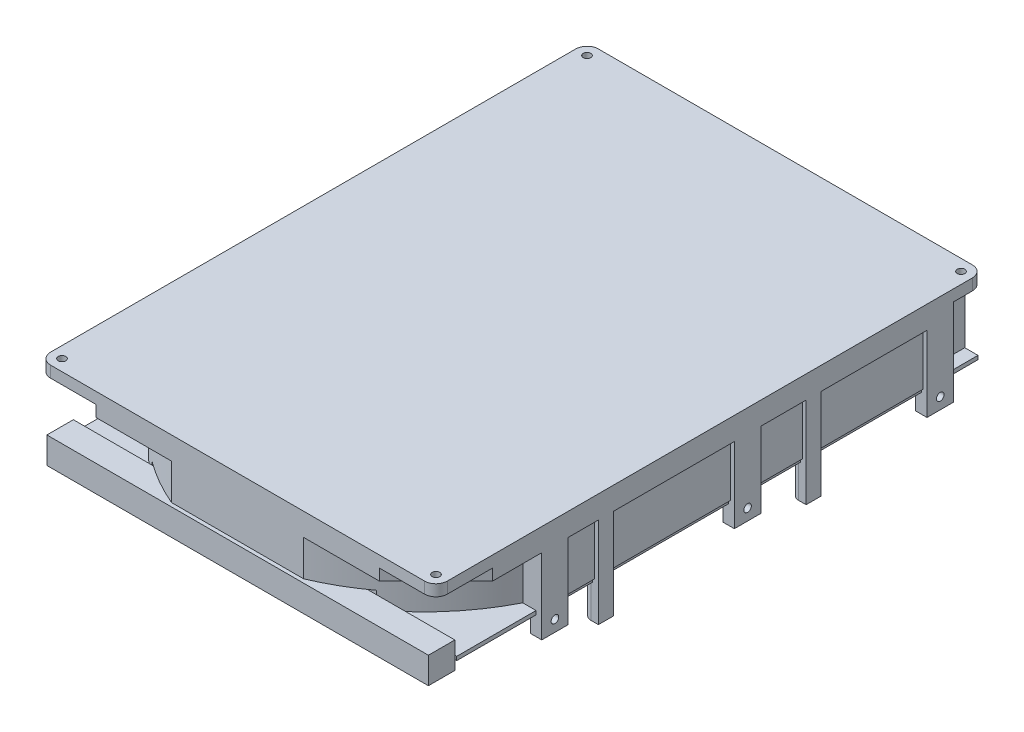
ISO-10303-21;
HEADER;
FILE_DESCRIPTION(('STEP AP214'),'2;1');
FILE_NAME('part.step','',(''),(''),'','','');
FILE_SCHEMA(('AUTOMOTIVE_DESIGN { 1 0 10303 214 1 1 1 1 }'));
ENDSEC;
DATA;
#1=APPLICATION_CONTEXT('core data for automotive mechanical design processes');
#2=APPLICATION_PROTOCOL_DEFINITION('international standard','automotive_design',2000,#1);
#3=PRODUCT_CONTEXT('',#1,'mechanical');
#4=PRODUCT('Part','Part','',(#3));
#5=PRODUCT_RELATED_PRODUCT_CATEGORY('part','',(#4));
#6=PRODUCT_DEFINITION_FORMATION('','',#4);
#7=PRODUCT_DEFINITION_CONTEXT('part definition',#1,'design');
#8=PRODUCT_DEFINITION('design','',#6,#7);
#9=PRODUCT_DEFINITION_SHAPE('','',#8);
#10=(LENGTH_UNIT() NAMED_UNIT(*) SI_UNIT(.MILLI.,.METRE.));
#11=(NAMED_UNIT(*) PLANE_ANGLE_UNIT() SI_UNIT($,.RADIAN.));
#12=(NAMED_UNIT(*) SI_UNIT($,.STERADIAN.) SOLID_ANGLE_UNIT());
#13=UNCERTAINTY_MEASURE_WITH_UNIT(LENGTH_MEASURE(1.E-05),#10,'distance_accuracy_value','');
#14=(GEOMETRIC_REPRESENTATION_CONTEXT(3) GLOBAL_UNCERTAINTY_ASSIGNED_CONTEXT((#13)) GLOBAL_UNIT_ASSIGNED_CONTEXT((#10,
#11,#12)) REPRESENTATION_CONTEXT('',''));
#15=CARTESIAN_POINT('',(0.,0.,0.));
#16=DIRECTION('',(0.,0.,1.));
#17=DIRECTION('',(1.,0.,0.));
#18=AXIS2_PLACEMENT_3D('',#15,#16,#17);
#19=CARTESIAN_POINT('',(-52.5,20.,72.5));
#20=DIRECTION('',(0.,0.,-1.));
#21=DIRECTION('',(-1.,0.,0.));
#22=AXIS2_PLACEMENT_3D('',#19,#20,#21);
#23=PLANE('',#22);
#24=DIRECTION('',(1.,0.,0.));
#25=VECTOR('',#24,1.);
#26=CARTESIAN_POINT('',(0.,-3.5,72.5));
#27=LINE('',#26,#25);
#28=CARTESIAN_POINT('',(-50.5,-3.49999999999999,72.5));
#29=VERTEX_POINT('',#28);
#30=CARTESIAN_POINT('',(50.5,-3.49999999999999,72.5));
#31=VERTEX_POINT('',#30);
#32=EDGE_CURVE('E873',#29,#31,#27,.T.);
#33=ORIENTED_EDGE('',*,*,#32,.T.);
#34=DIRECTION('',(0.,-1.,0.));
#35=VECTOR('',#34,1.);
#36=CARTESIAN_POINT('',(50.5,3.49999999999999,72.5));
#37=LINE('',#36,#35);
#38=CARTESIAN_POINT('',(50.5,3.49999999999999,72.5));
#39=VERTEX_POINT('',#38);
#40=EDGE_CURVE('E1340',#39,#31,#37,.T.);
#41=ORIENTED_EDGE('',*,*,#40,.F.);
#42=DIRECTION('',(-1.,0.,0.));
#43=VECTOR('',#42,1.);
#44=CARTESIAN_POINT('',(0.,3.5,72.5));
#45=LINE('',#44,#43);
#46=CARTESIAN_POINT('',(-50.5,3.49999999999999,72.5));
#47=VERTEX_POINT('',#46);
#48=EDGE_CURVE('E867',#39,#47,#45,.T.);
#49=ORIENTED_EDGE('',*,*,#48,.T.);
#50=DIRECTION('',(0.,-1.,0.));
#51=VECTOR('',#50,1.);
#52=CARTESIAN_POINT('',(-50.5,3.49999999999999,72.5));
#53=LINE('',#52,#51);
#54=EDGE_CURVE('E881',#47,#29,#53,.T.);
#55=ORIENTED_EDGE('',*,*,#54,.T.);
#56=EDGE_LOOP('',(#33,#41,#49,#55));
#57=FACE_BOUND('',#56,.T.);
#58=ADVANCED_FACE('F36',(#57),#23,.F.);
#59=CARTESIAN_POINT('',(-52.5,0.,72.5));
#60=DIRECTION('',(0.,-1.,0.));
#61=DIRECTION('',(0.,0.,-1.));
#62=AXIS2_PLACEMENT_3D('',#59,#60,#61);
#63=PLANE('',#62);
#64=DIRECTION('',(1.,0.,0.));
#65=VECTOR('',#64,1.);
#66=CARTESIAN_POINT('',(-52.5,0.,-57.5));
#67=LINE('',#66,#65);
#68=CARTESIAN_POINT('',(-51.5,0.,-57.5));
#69=VERTEX_POINT('',#68);
#70=CARTESIAN_POINT('',(-51.,0.,-57.5));
#71=VERTEX_POINT('',#70);
#72=EDGE_CURVE('E1116',#69,#71,#67,.T.);
#73=ORIENTED_EDGE('',*,*,#72,.T.);
#74=DIRECTION('',(0.,0.,-1.));
#75=VECTOR('',#74,1.);
#76=CARTESIAN_POINT('',(-51.,0.,-72.5));
#77=LINE('',#76,#75);
#78=CARTESIAN_POINT('',(-51.,0.,-29.5));
#79=VERTEX_POINT('',#78);
#80=EDGE_CURVE('E1979',#79,#71,#77,.T.);
#81=ORIENTED_EDGE('',*,*,#80,.F.);
#82=DIRECTION('',(-1.,0.,0.));
#83=VECTOR('',#82,1.);
#84=CARTESIAN_POINT('',(-52.5,0.,-29.5));
#85=LINE('',#84,#83);
#86=CARTESIAN_POINT('',(-51.5,0.,-29.5));
#87=VERTEX_POINT('',#86);
#88=EDGE_CURVE('E1025',#79,#87,#85,.T.);
#89=ORIENTED_EDGE('',*,*,#88,.T.);
#90=DIRECTION('',(0.,0.,1.));
#91=VECTOR('',#90,1.);
#92=CARTESIAN_POINT('',(-51.5,0.,-72.5));
#93=LINE('',#92,#91);
#94=EDGE_CURVE('E1193',#69,#87,#93,.T.);
#95=ORIENTED_EDGE('',*,*,#94,.F.);
#96=EDGE_LOOP('',(#73,#81,#89,#95));
#97=FACE_BOUND('',#96,.T.);
#98=ADVANCED_FACE('F1894',(#97),#63,.T.);
#99=DIRECTION('',(1.,0.,0.));
#100=VECTOR('',#99,1.);
#101=CARTESIAN_POINT('',(-52.5,0.,-25.5));
#102=LINE('',#101,#100);
#103=CARTESIAN_POINT('',(-51.5,0.,-25.5));
#104=VERTEX_POINT('',#103);
#105=CARTESIAN_POINT('',(-51.,0.,-25.5));
#106=VERTEX_POINT('',#105);
#107=EDGE_CURVE('E1022',#104,#106,#102,.T.);
#108=ORIENTED_EDGE('',*,*,#107,.T.);
#109=CARTESIAN_POINT('',(-51.,0.,-13.5));
#110=VERTEX_POINT('',#109);
#111=EDGE_CURVE('E1978',#110,#106,#77,.T.);
#112=ORIENTED_EDGE('',*,*,#111,.F.);
#113=DIRECTION('',(-1.,0.,0.));
#114=VECTOR('',#113,1.);
#115=CARTESIAN_POINT('',(-52.5,0.,-13.5));
#116=LINE('',#115,#114);
#117=CARTESIAN_POINT('',(-51.5,0.,-13.5));
#118=VERTEX_POINT('',#117);
#119=EDGE_CURVE('E1155',#110,#118,#116,.T.);
#120=ORIENTED_EDGE('',*,*,#119,.T.);
#121=EDGE_CURVE('E1197',#104,#118,#93,.T.);
#122=ORIENTED_EDGE('',*,*,#121,.F.);
#123=EDGE_LOOP('',(#108,#112,#120,#122));
#124=FACE_BOUND('',#123,.T.);
#125=ADVANCED_FACE('F1899',(#124),#63,.T.);
#126=DIRECTION('',(1.,0.,0.));
#127=VECTOR('',#126,1.);
#128=CARTESIAN_POINT('',(-52.5,0.,-6.49999999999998));
#129=LINE('',#128,#127);
#130=CARTESIAN_POINT('',(-51.5,0.,-6.50000000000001));
#131=VERTEX_POINT('',#130);
#132=CARTESIAN_POINT('',(-51.,0.,-6.49999999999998));
#133=VERTEX_POINT('',#132);
#134=EDGE_CURVE('E1149',#131,#133,#129,.T.);
#135=ORIENTED_EDGE('',*,*,#134,.T.);
#136=CARTESIAN_POINT('',(-51.,0.,25.5));
#137=VERTEX_POINT('',#136);
#138=EDGE_CURVE('E1969',#137,#133,#77,.T.);
#139=ORIENTED_EDGE('',*,*,#138,.F.);
#140=DIRECTION('',(-1.,0.,0.));
#141=VECTOR('',#140,1.);
#142=CARTESIAN_POINT('',(-52.5,0.,25.5));
#143=LINE('',#142,#141);
#144=CARTESIAN_POINT('',(-51.5,0.,25.5));
#145=VERTEX_POINT('',#144);
#146=EDGE_CURVE('E1063',#137,#145,#143,.T.);
#147=ORIENTED_EDGE('',*,*,#146,.T.);
#148=EDGE_CURVE('E1198',#131,#145,#93,.T.);
#149=ORIENTED_EDGE('',*,*,#148,.F.);
#150=EDGE_LOOP('',(#135,#139,#147,#149));
#151=FACE_BOUND('',#150,.T.);
#152=ADVANCED_FACE('F1973',(#151),#63,.T.);
#153=DIRECTION('',(1.,0.,0.));
#154=VECTOR('',#153,1.);
#155=CARTESIAN_POINT('',(-52.5,0.,29.5));
#156=LINE('',#155,#154);
#157=CARTESIAN_POINT('',(-51.5,0.,29.5));
#158=VERTEX_POINT('',#157);
#159=CARTESIAN_POINT('',(-51.,0.,29.5));
#160=VERTEX_POINT('',#159);
#161=EDGE_CURVE('E1060',#158,#160,#156,.T.);
#162=ORIENTED_EDGE('',*,*,#161,.T.);
#163=CARTESIAN_POINT('',(-51.,0.,37.5));
#164=VERTEX_POINT('',#163);
#165=EDGE_CURVE('E905',#164,#160,#77,.T.);
#166=ORIENTED_EDGE('',*,*,#165,.F.);
#167=DIRECTION('',(-1.,0.,0.));
#168=VECTOR('',#167,1.);
#169=CARTESIAN_POINT('',(-52.5,0.,37.5));
#170=LINE('',#169,#168);
#171=CARTESIAN_POINT('',(-51.5,0.,37.5));
#172=VERTEX_POINT('',#171);
#173=EDGE_CURVE('E1185',#164,#172,#170,.T.);
#174=ORIENTED_EDGE('',*,*,#173,.T.);
#175=EDGE_CURVE('E1190',#158,#172,#93,.T.);
#176=ORIENTED_EDGE('',*,*,#175,.F.);
#177=EDGE_LOOP('',(#162,#166,#174,#176));
#178=FACE_BOUND('',#177,.T.);
#179=ADVANCED_FACE('F1902',(#178),#63,.T.);
#180=CARTESIAN_POINT('',(-52.5,-6.,37.5));
#181=DIRECTION('',(0.,0.,1.));
#182=DIRECTION('',(1.,0.,0.));
#183=AXIS2_PLACEMENT_3D('',#180,#181,#182);
#184=PLANE('',#183);
#185=DIRECTION('',(0.,1.,0.));
#186=VECTOR('',#185,1.);
#187=CARTESIAN_POINT('',(-51.,-6.,37.5));
#188=LINE('',#187,#186);
#189=CARTESIAN_POINT('',(-51.,-1.,37.5));
#190=VERTEX_POINT('',#189);
#191=EDGE_CURVE('E936',#190,#164,#188,.T.);
#192=ORIENTED_EDGE('',*,*,#191,.F.);
#193=DIRECTION('',(1.,0.,0.));
#194=VECTOR('',#193,1.);
#195=CARTESIAN_POINT('',(-52.5,-1.,37.5));
#196=LINE('',#195,#194);
#197=CARTESIAN_POINT('',(-49.5,-1.,37.5));
#198=VERTEX_POINT('',#197);
#199=EDGE_CURVE('E983',#190,#198,#196,.T.);
#200=ORIENTED_EDGE('',*,*,#199,.T.);
#201=DIRECTION('',(0.,1.,0.));
#202=VECTOR('',#201,1.);
#203=CARTESIAN_POINT('',(-49.5,-6.,37.5));
#204=LINE('',#203,#202);
#205=CARTESIAN_POINT('',(-49.5,-6.,37.5));
#206=VERTEX_POINT('',#205);
#207=EDGE_CURVE('E1179',#206,#198,#204,.T.);
#208=ORIENTED_EDGE('',*,*,#207,.F.);
#209=DIRECTION('',(1.,0.,0.));
#210=VECTOR('',#209,1.);
#211=CARTESIAN_POINT('',(-52.5,-6.,37.5));
#212=LINE('',#211,#210);
#213=CARTESIAN_POINT('',(-52.5,-6.,37.5));
#214=VERTEX_POINT('',#213);
#215=EDGE_CURVE('E1164',#214,#206,#212,.T.);
#216=ORIENTED_EDGE('',*,*,#215,.F.);
#217=DIRECTION('',(0.,1.,0.));
#218=VECTOR('',#217,1.);
#219=CARTESIAN_POINT('',(-52.5,-6.,37.5));
#220=LINE('',#219,#218);
#221=CARTESIAN_POINT('',(-52.5,14.,37.5));
#222=VERTEX_POINT('',#221);
#223=EDGE_CURVE('E1182',#214,#222,#220,.T.);
#224=ORIENTED_EDGE('',*,*,#223,.T.);
#225=DIRECTION('',(1.,0.,0.));
#226=VECTOR('',#225,1.);
#227=CARTESIAN_POINT('',(-52.5,14.,37.5));
#228=LINE('',#227,#226);
#229=CARTESIAN_POINT('',(-51.5,14.,37.5));
#230=VERTEX_POINT('',#229);
#231=EDGE_CURVE('E1165',#222,#230,#228,.T.);
#232=ORIENTED_EDGE('',*,*,#231,.T.);
#233=DIRECTION('',(0.,-1.,0.));
#234=VECTOR('',#233,1.);
#235=CARTESIAN_POINT('',(-51.5,14.,37.5));
#236=LINE('',#235,#234);
#237=EDGE_CURVE('E1244',#230,#172,#236,.T.);
#238=ORIENTED_EDGE('',*,*,#237,.T.);
#239=ORIENTED_EDGE('',*,*,#173,.F.);
#240=EDGE_LOOP('',(#192,#200,#208,#216,#224,#232,#238,#239));
#241=FACE_BOUND('',#240,.T.);
#242=ADVANCED_FACE('F2080',(#241),#184,.F.);
#243=CARTESIAN_POINT('',(-52.5,-6.,-13.5));
#244=DIRECTION('',(0.,0.,1.));
#245=DIRECTION('',(1.,0.,0.));
#246=AXIS2_PLACEMENT_3D('',#243,#244,#245);
#247=PLANE('',#246);
#248=DIRECTION('',(0.,1.,0.));
#249=VECTOR('',#248,1.);
#250=CARTESIAN_POINT('',(-51.,-6.,-13.5));
#251=LINE('',#250,#249);
#252=CARTESIAN_POINT('',(-51.,-1.,-13.5));
#253=VERTEX_POINT('',#252);
#254=EDGE_CURVE('E934',#253,#110,#251,.T.);
#255=ORIENTED_EDGE('',*,*,#254,.F.);
#256=DIRECTION('',(1.,0.,0.));
#257=VECTOR('',#256,1.);
#258=CARTESIAN_POINT('',(-52.5,-1.,-13.5));
#259=LINE('',#258,#257);
#260=CARTESIAN_POINT('',(-49.5,-1.,-13.5));
#261=VERTEX_POINT('',#260);
#262=EDGE_CURVE('E977',#253,#261,#259,.T.);
#263=ORIENTED_EDGE('',*,*,#262,.T.);
#264=DIRECTION('',(0.,1.,0.));
#265=VECTOR('',#264,1.);
#266=CARTESIAN_POINT('',(-49.5,-6.,-13.5));
#267=LINE('',#266,#265);
#268=CARTESIAN_POINT('',(-49.5,-6.,-13.5));
#269=VERTEX_POINT('',#268);
#270=EDGE_CURVE('E1140',#269,#261,#267,.T.);
#271=ORIENTED_EDGE('',*,*,#270,.F.);
#272=DIRECTION('',(1.,0.,0.));
#273=VECTOR('',#272,1.);
#274=CARTESIAN_POINT('',(-52.5,-6.,-13.5));
#275=LINE('',#274,#273);
#276=CARTESIAN_POINT('',(-52.5,-6.,-13.5));
#277=VERTEX_POINT('',#276);
#278=EDGE_CURVE('E1123',#277,#269,#275,.T.);
#279=ORIENTED_EDGE('',*,*,#278,.F.);
#280=DIRECTION('',(0.,1.,0.));
#281=VECTOR('',#280,1.);
#282=CARTESIAN_POINT('',(-52.5,-6.,-13.5));
#283=LINE('',#282,#281);
#284=CARTESIAN_POINT('',(-52.5,14.,-13.5));
#285=VERTEX_POINT('',#284);
#286=EDGE_CURVE('E1143',#277,#285,#283,.T.);
#287=ORIENTED_EDGE('',*,*,#286,.T.);
#288=DIRECTION('',(1.,0.,0.));
#289=VECTOR('',#288,1.);
#290=CARTESIAN_POINT('',(-52.5,14.,-13.5));
#291=LINE('',#290,#289);
#292=CARTESIAN_POINT('',(-51.5,14.,-13.5));
#293=VERTEX_POINT('',#292);
#294=EDGE_CURVE('E1119',#285,#293,#291,.T.);
#295=ORIENTED_EDGE('',*,*,#294,.T.);
#296=DIRECTION('',(0.,-1.,0.));
#297=VECTOR('',#296,1.);
#298=CARTESIAN_POINT('',(-51.5,14.,-13.5));
#299=LINE('',#298,#297);
#300=EDGE_CURVE('E1152',#293,#118,#299,.T.);
#301=ORIENTED_EDGE('',*,*,#300,.T.);
#302=ORIENTED_EDGE('',*,*,#119,.F.);
#303=EDGE_LOOP('',(#255,#263,#271,#279,#287,#295,#301,#302));
#304=FACE_BOUND('',#303,.T.);
#305=ADVANCED_FACE('F2094',(#304),#247,.F.);
#306=CARTESIAN_POINT('',(-52.5,-6.,-6.49999999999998));
#307=DIRECTION('',(0.,0.,-1.));
#308=DIRECTION('',(-1.,0.,0.));
#309=AXIS2_PLACEMENT_3D('',#306,#307,#308);
#310=PLANE('',#309);
#311=DIRECTION('',(0.,-1.,0.));
#312=VECTOR('',#311,1.);
#313=CARTESIAN_POINT('',(-51.,-6.,-6.49999999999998));
#314=LINE('',#313,#312);
#315=CARTESIAN_POINT('',(-51.,-1.,-6.49999999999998));
#316=VERTEX_POINT('',#315);
#317=EDGE_CURVE('E932',#133,#316,#314,.T.);
#318=ORIENTED_EDGE('',*,*,#317,.F.);
#319=ORIENTED_EDGE('',*,*,#134,.F.);
#320=DIRECTION('',(0.,1.,0.));
#321=VECTOR('',#320,1.);
#322=CARTESIAN_POINT('',(-51.5,14.,-6.49999999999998));
#323=LINE('',#322,#321);
#324=CARTESIAN_POINT('',(-51.5,14.,-6.50000000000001));
#325=VERTEX_POINT('',#324);
#326=EDGE_CURVE('E1146',#131,#325,#323,.T.);
#327=ORIENTED_EDGE('',*,*,#326,.T.);
#328=DIRECTION('',(-1.,0.,0.));
#329=VECTOR('',#328,1.);
#330=CARTESIAN_POINT('',(-52.5,14.,-6.49999999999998));
#331=LINE('',#330,#329);
#332=CARTESIAN_POINT('',(-52.4999999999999,14.,-6.49999999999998));
#333=VERTEX_POINT('',#332);
#334=EDGE_CURVE('E1124',#325,#333,#331,.T.);
#335=ORIENTED_EDGE('',*,*,#334,.T.);
#336=DIRECTION('',(0.,1.,0.));
#337=VECTOR('',#336,1.);
#338=CARTESIAN_POINT('',(-52.5,-6.,-6.49999999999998));
#339=LINE('',#338,#337);
#340=CARTESIAN_POINT('',(-52.5,-6.,-6.49999999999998));
#341=VERTEX_POINT('',#340);
#342=EDGE_CURVE('E1130',#341,#333,#339,.T.);
#343=ORIENTED_EDGE('',*,*,#342,.F.);
#344=DIRECTION('',(-1.,0.,0.));
#345=VECTOR('',#344,1.);
#346=CARTESIAN_POINT('',(-52.5,-6.,-6.49999999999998));
#347=LINE('',#346,#345);
#348=CARTESIAN_POINT('',(-49.5,-6.,-6.49999999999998));
#349=VERTEX_POINT('',#348);
#350=EDGE_CURVE('E1128',#349,#341,#347,.T.);
#351=ORIENTED_EDGE('',*,*,#350,.F.);
#352=DIRECTION('',(0.,1.,0.));
#353=VECTOR('',#352,1.);
#354=CARTESIAN_POINT('',(-49.5,-6.,-6.49999999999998));
#355=LINE('',#354,#353);
#356=CARTESIAN_POINT('',(-49.5,-1.,-6.49999999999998));
#357=VERTEX_POINT('',#356);
#358=EDGE_CURVE('E1137',#349,#357,#355,.T.);
#359=ORIENTED_EDGE('',*,*,#358,.T.);
#360=DIRECTION('',(-1.,0.,0.));
#361=VECTOR('',#360,1.);
#362=CARTESIAN_POINT('',(-52.5,-1.,-6.49999999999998));
#363=LINE('',#362,#361);
#364=EDGE_CURVE('E971',#357,#316,#363,.T.);
#365=ORIENTED_EDGE('',*,*,#364,.T.);
#366=EDGE_LOOP('',(#318,#319,#327,#335,#343,#351,#359,#365));
#367=FACE_BOUND('',#366,.T.);
#368=ADVANCED_FACE('F2118',(#367),#310,.F.);
#369=CARTESIAN_POINT('',(-52.5,-6.,-57.5));
#370=DIRECTION('',(0.,0.,-1.));
#371=DIRECTION('',(-1.,0.,0.));
#372=AXIS2_PLACEMENT_3D('',#369,#370,#371);
#373=PLANE('',#372);
#374=DIRECTION('',(0.,-1.,0.));
#375=VECTOR('',#374,1.);
#376=CARTESIAN_POINT('',(-51.,-6.,-57.5));
#377=LINE('',#376,#375);
#378=CARTESIAN_POINT('',(-51.,-1.,-57.5));
#379=VERTEX_POINT('',#378);
#380=EDGE_CURVE('E927',#71,#379,#377,.T.);
#381=ORIENTED_EDGE('',*,*,#380,.F.);
#382=ORIENTED_EDGE('',*,*,#72,.F.);
#383=DIRECTION('',(0.,1.,0.));
#384=VECTOR('',#383,1.);
#385=CARTESIAN_POINT('',(-51.5,14.,-57.5));
#386=LINE('',#385,#384);
#387=CARTESIAN_POINT('',(-51.5,14.,-57.5));
#388=VERTEX_POINT('',#387);
#389=EDGE_CURVE('E1113',#69,#388,#386,.T.);
#390=ORIENTED_EDGE('',*,*,#389,.T.);
#391=DIRECTION('',(-1.,0.,0.));
#392=VECTOR('',#391,1.);
#393=CARTESIAN_POINT('',(-52.5,14.,-57.5));
#394=LINE('',#393,#392);
#395=CARTESIAN_POINT('',(-52.4999999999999,14.,-57.4999999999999));
#396=VERTEX_POINT('',#395);
#397=EDGE_CURVE('E1094',#388,#396,#394,.T.);
#398=ORIENTED_EDGE('',*,*,#397,.T.);
#399=DIRECTION('',(0.,1.,0.));
#400=VECTOR('',#399,1.);
#401=CARTESIAN_POINT('',(-52.5,-6.,-57.5));
#402=LINE('',#401,#400);
#403=CARTESIAN_POINT('',(-52.5,-6.,-57.5));
#404=VERTEX_POINT('',#403);
#405=EDGE_CURVE('E1100',#404,#396,#402,.T.);
#406=ORIENTED_EDGE('',*,*,#405,.F.);
#407=DIRECTION('',(-1.,0.,0.));
#408=VECTOR('',#407,1.);
#409=CARTESIAN_POINT('',(-52.5,-6.,-57.5));
#410=LINE('',#409,#408);
#411=CARTESIAN_POINT('',(-49.5,-6.,-57.5));
#412=VERTEX_POINT('',#411);
#413=EDGE_CURVE('E1098',#412,#404,#410,.T.);
#414=ORIENTED_EDGE('',*,*,#413,.F.);
#415=DIRECTION('',(0.,1.,0.));
#416=VECTOR('',#415,1.);
#417=CARTESIAN_POINT('',(-49.5,-6.,-57.5));
#418=LINE('',#417,#416);
#419=CARTESIAN_POINT('',(-49.5,-1.,-57.5));
#420=VERTEX_POINT('',#419);
#421=EDGE_CURVE('E1105',#412,#420,#418,.T.);
#422=ORIENTED_EDGE('',*,*,#421,.T.);
#423=DIRECTION('',(-1.,0.,0.));
#424=VECTOR('',#423,1.);
#425=CARTESIAN_POINT('',(-52.5,-1.,-57.5));
#426=LINE('',#425,#424);
#427=EDGE_CURVE('E962',#420,#379,#426,.T.);
#428=ORIENTED_EDGE('',*,*,#427,.T.);
#429=EDGE_LOOP('',(#381,#382,#390,#398,#406,#414,#422,#428));
#430=FACE_BOUND('',#429,.T.);
#431=ADVANCED_FACE('F2107',(#430),#373,.F.);
#432=CARTESIAN_POINT('',(-52.5,-10.,25.5));
#433=DIRECTION('',(0.,0.,1.));
#434=DIRECTION('',(1.,0.,0.));
#435=AXIS2_PLACEMENT_3D('',#432,#433,#434);
#436=PLANE('',#435);
#437=DIRECTION('',(0.,1.,0.));
#438=VECTOR('',#437,1.);
#439=CARTESIAN_POINT('',(-51.,-10.,25.5));
#440=LINE('',#439,#438);
#441=CARTESIAN_POINT('',(-51.,-1.,25.5));
#442=VERTEX_POINT('',#441);
#443=EDGE_CURVE('E925',#442,#137,#440,.T.);
#444=ORIENTED_EDGE('',*,*,#443,.F.);
#445=DIRECTION('',(1.,0.,0.));
#446=VECTOR('',#445,1.);
#447=CARTESIAN_POINT('',(-52.5,-0.999999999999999,25.5));
#448=LINE('',#447,#446);
#449=CARTESIAN_POINT('',(-50.5,-0.999999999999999,25.5));
#450=VERTEX_POINT('',#449);
#451=EDGE_CURVE('E959',#442,#450,#448,.T.);
#452=ORIENTED_EDGE('',*,*,#451,.T.);
#453=DIRECTION('',(0.,1.,0.));
#454=VECTOR('',#453,1.);
#455=CARTESIAN_POINT('',(-50.5,-10.,25.5));
#456=LINE('',#455,#454);
#457=CARTESIAN_POINT('',(-50.5,-10.,25.5));
#458=VERTEX_POINT('',#457);
#459=EDGE_CURVE('E1054',#458,#450,#456,.T.);
#460=ORIENTED_EDGE('',*,*,#459,.F.);
#461=DIRECTION('',(1.,0.,0.));
#462=VECTOR('',#461,1.);
#463=CARTESIAN_POINT('',(-52.5,-10.,25.5));
#464=LINE('',#463,#462);
#465=CARTESIAN_POINT('',(-52.5,-10.,25.5));
#466=VERTEX_POINT('',#465);
#467=EDGE_CURVE('E1037',#466,#458,#464,.T.);
#468=ORIENTED_EDGE('',*,*,#467,.F.);
#469=DIRECTION('',(0.,1.,0.));
#470=VECTOR('',#469,1.);
#471=CARTESIAN_POINT('',(-52.5,-10.,25.5));
#472=LINE('',#471,#470);
#473=CARTESIAN_POINT('',(-52.5,14.,25.5));
#474=VERTEX_POINT('',#473);
#475=EDGE_CURVE('E1057',#466,#474,#472,.T.);
#476=ORIENTED_EDGE('',*,*,#475,.T.);
#477=DIRECTION('',(1.,0.,0.));
#478=VECTOR('',#477,1.);
#479=CARTESIAN_POINT('',(-52.5,14.,25.5));
#480=LINE('',#479,#478);
#481=CARTESIAN_POINT('',(-51.5,14.,25.5));
#482=VERTEX_POINT('',#481);
#483=EDGE_CURVE('E1031',#474,#482,#480,.T.);
#484=ORIENTED_EDGE('',*,*,#483,.T.);
#485=DIRECTION('',(0.,-1.,0.));
#486=VECTOR('',#485,1.);
#487=CARTESIAN_POINT('',(-51.5,14.,25.5));
#488=LINE('',#487,#486);
#489=EDGE_CURVE('E1259',#482,#145,#488,.T.);
#490=ORIENTED_EDGE('',*,*,#489,.T.);
#491=ORIENTED_EDGE('',*,*,#146,.F.);
#492=EDGE_LOOP('',(#444,#452,#460,#468,#476,#484,#490,#491));
#493=FACE_BOUND('',#492,.T.);
#494=ADVANCED_FACE('F1964',(#493),#436,.F.);
#495=CARTESIAN_POINT('',(-52.5,-10.,29.5));
#496=DIRECTION('',(0.,0.,-1.));
#497=DIRECTION('',(-1.,0.,0.));
#498=AXIS2_PLACEMENT_3D('',#495,#496,#497);
#499=PLANE('',#498);
#500=DIRECTION('',(0.,-1.,0.));
#501=VECTOR('',#500,1.);
#502=CARTESIAN_POINT('',(-51.,-10.,29.5));
#503=LINE('',#502,#501);
#504=CARTESIAN_POINT('',(-51.,-1.,29.5));
#505=VERTEX_POINT('',#504);
#506=EDGE_CURVE('E923',#160,#505,#503,.T.);
#507=ORIENTED_EDGE('',*,*,#506,.F.);
#508=ORIENTED_EDGE('',*,*,#161,.F.);
#509=DIRECTION('',(0.,1.,0.));
#510=VECTOR('',#509,1.);
#511=CARTESIAN_POINT('',(-51.5,14.,29.5));
#512=LINE('',#511,#510);
#513=CARTESIAN_POINT('',(-51.5,14.,29.5));
#514=VERTEX_POINT('',#513);
#515=EDGE_CURVE('E1256',#158,#514,#512,.T.);
#516=ORIENTED_EDGE('',*,*,#515,.T.);
#517=DIRECTION('',(-1.,0.,0.));
#518=VECTOR('',#517,1.);
#519=CARTESIAN_POINT('',(-52.5,14.,29.5));
#520=LINE('',#519,#518);
#521=CARTESIAN_POINT('',(-52.5,14.,29.5));
#522=VERTEX_POINT('',#521);
#523=EDGE_CURVE('E1038',#514,#522,#520,.T.);
#524=ORIENTED_EDGE('',*,*,#523,.T.);
#525=DIRECTION('',(0.,1.,0.));
#526=VECTOR('',#525,1.);
#527=CARTESIAN_POINT('',(-52.5,-10.,29.5));
#528=LINE('',#527,#526);
#529=CARTESIAN_POINT('',(-52.5,-10.,29.5));
#530=VERTEX_POINT('',#529);
#531=EDGE_CURVE('E1044',#530,#522,#528,.T.);
#532=ORIENTED_EDGE('',*,*,#531,.F.);
#533=DIRECTION('',(-1.,0.,0.));
#534=VECTOR('',#533,1.);
#535=CARTESIAN_POINT('',(-52.5,-10.,29.5));
#536=LINE('',#535,#534);
#537=CARTESIAN_POINT('',(-50.5,-10.,29.5));
#538=VERTEX_POINT('',#537);
#539=EDGE_CURVE('E1042',#538,#530,#536,.T.);
#540=ORIENTED_EDGE('',*,*,#539,.F.);
#541=DIRECTION('',(0.,1.,0.));
#542=VECTOR('',#541,1.);
#543=CARTESIAN_POINT('',(-50.5,-10.,29.5));
#544=LINE('',#543,#542);
#545=CARTESIAN_POINT('',(-50.5,-0.999999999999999,29.5));
#546=VERTEX_POINT('',#545);
#547=EDGE_CURVE('E1051',#538,#546,#544,.T.);
#548=ORIENTED_EDGE('',*,*,#547,.T.);
#549=DIRECTION('',(-1.,0.,0.));
#550=VECTOR('',#549,1.);
#551=CARTESIAN_POINT('',(-52.5,-0.999999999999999,29.5));
#552=LINE('',#551,#550);
#553=EDGE_CURVE('E953',#546,#505,#552,.T.);
#554=ORIENTED_EDGE('',*,*,#553,.T.);
#555=EDGE_LOOP('',(#507,#508,#516,#524,#532,#540,#548,#554));
#556=FACE_BOUND('',#555,.T.);
#557=ADVANCED_FACE('F1946',(#556),#499,.F.);
#558=CARTESIAN_POINT('',(-50.5,1.22781992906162E-10,27.5));
#559=DIRECTION('',(0.,-1.,0.));
#560=DIRECTION('',(0.,0.,-1.));
#561=AXIS2_PLACEMENT_3D('',#558,#559,#560);
#562=CYLINDRICAL_SURFACE('',#561,0.999999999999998);
#563=CARTESIAN_POINT('',(-50.5,-9.99999999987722,27.5));
#564=DIRECTION('',(0.,-1.,0.));
#565=DIRECTION('',(0.,0.,-1.));
#566=AXIS2_PLACEMENT_3D('',#563,#564,#565);
#567=CIRCLE('',#566,0.999999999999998);
#568=CARTESIAN_POINT('',(-50.5,-9.99999999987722,26.5));
#569=VERTEX_POINT('',#568);
#570=EDGE_CURVE('E1027',#569,#569,#567,.T.);
#571=ORIENTED_EDGE('',*,*,#570,.T.);
#572=EDGE_LOOP('',(#571));
#573=FACE_BOUND('',#572,.T.);
#574=DIRECTION('',(0.,-1.,0.));
#575=VECTOR('',#574,1.);
#576=CARTESIAN_POINT('',(-51.,1.22781992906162E-10,28.3660254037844));
#577=LINE('',#576,#575);
#578=CARTESIAN_POINT('',(-51.,-1.,28.3660254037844));
#579=VERTEX_POINT('',#578);
#580=CARTESIAN_POINT('',(-51.,1.22781992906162E-10,28.3660254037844));
#581=VERTEX_POINT('',#580);
#582=EDGE_CURVE('E921',#579,#581,#577,.F.);
#583=ORIENTED_EDGE('',*,*,#582,.F.);
#584=CARTESIAN_POINT('',(-50.5,-1.,27.5));
#585=DIRECTION('',(0.,-1.,0.));
#586=DIRECTION('',(0.,0.,-1.));
#587=AXIS2_PLACEMENT_3D('',#584,#585,#586);
#588=CIRCLE('',#587,0.999999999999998);
#589=CARTESIAN_POINT('',(-51.,-1.,26.6339745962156));
#590=VERTEX_POINT('',#589);
#591=EDGE_CURVE('E950',#579,#590,#588,.F.);
#592=ORIENTED_EDGE('',*,*,#591,.T.);
#593=DIRECTION('',(0.,-1.,0.));
#594=VECTOR('',#593,1.);
#595=CARTESIAN_POINT('',(-51.,1.22781992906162E-10,26.6339745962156));
#596=LINE('',#595,#594);
#597=CARTESIAN_POINT('',(-51.,0.,26.6339745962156));
#598=VERTEX_POINT('',#597);
#599=EDGE_CURVE('E919',#598,#590,#596,.T.);
#600=ORIENTED_EDGE('',*,*,#599,.F.);
#601=CARTESIAN_POINT('',(-50.5,1.22781992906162E-10,27.5));
#602=DIRECTION('',(0.,-1.,0.));
#603=DIRECTION('',(0.,0.,-1.));
#604=AXIS2_PLACEMENT_3D('',#601,#602,#603);
#605=CIRCLE('',#604,0.999999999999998);
#606=EDGE_CURVE('E1028',#581,#598,#605,.T.);
#607=ORIENTED_EDGE('',*,*,#606,.F.);
#608=EDGE_LOOP('',(#583,#592,#600,#607));
#609=FACE_BOUND('',#608,.T.);
#610=ADVANCED_FACE('F2226',(#573,#609),#562,.F.);
#611=CARTESIAN_POINT('',(-50.5,1.22781992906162E-10,27.5));
#612=DIRECTION('',(0.,-1.,0.));
#613=DIRECTION('',(0.,0.,-1.));
#614=AXIS2_PLACEMENT_3D('',#611,#612,#613);
#615=PLANE('',#614);
#616=ORIENTED_EDGE('',*,*,#606,.T.);
#617=EDGE_CURVE('E1977',#581,#598,#77,.T.);
#618=ORIENTED_EDGE('',*,*,#617,.F.);
#619=EDGE_LOOP('',(#616,#618));
#620=FACE_BOUND('',#619,.T.);
#621=ADVANCED_FACE('F2221',(#620),#615,.T.);
#622=CARTESIAN_POINT('',(-52.5,-10.,-29.5));
#623=DIRECTION('',(0.,0.,1.));
#624=DIRECTION('',(1.,0.,0.));
#625=AXIS2_PLACEMENT_3D('',#622,#623,#624);
#626=PLANE('',#625);
#627=DIRECTION('',(0.,1.,0.));
#628=VECTOR('',#627,1.);
#629=CARTESIAN_POINT('',(-51.,-10.,-29.5));
#630=LINE('',#629,#628);
#631=CARTESIAN_POINT('',(-51.,-1.,-29.5));
#632=VERTEX_POINT('',#631);
#633=EDGE_CURVE('E917',#632,#79,#630,.T.);
#634=ORIENTED_EDGE('',*,*,#633,.F.);
#635=DIRECTION('',(1.,0.,0.));
#636=VECTOR('',#635,1.);
#637=CARTESIAN_POINT('',(-52.5,-0.999999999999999,-29.5));
#638=LINE('',#637,#636);
#639=CARTESIAN_POINT('',(-50.5,-0.999999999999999,-29.5));
#640=VERTEX_POINT('',#639);
#641=EDGE_CURVE('E947',#632,#640,#638,.T.);
#642=ORIENTED_EDGE('',*,*,#641,.T.);
#643=DIRECTION('',(0.,1.,0.));
#644=VECTOR('',#643,1.);
#645=CARTESIAN_POINT('',(-50.5,-10.,-29.5));
#646=LINE('',#645,#644);
#647=CARTESIAN_POINT('',(-50.5,-10.,-29.5));
#648=VERTEX_POINT('',#647);
#649=EDGE_CURVE('E1016',#648,#640,#646,.T.);
#650=ORIENTED_EDGE('',*,*,#649,.F.);
#651=DIRECTION('',(1.,0.,0.));
#652=VECTOR('',#651,1.);
#653=CARTESIAN_POINT('',(-52.5,-10.,-29.5));
#654=LINE('',#653,#652);
#655=CARTESIAN_POINT('',(-52.5,-10.,-29.5));
#656=VERTEX_POINT('',#655);
#657=EDGE_CURVE('E999',#656,#648,#654,.T.);
#658=ORIENTED_EDGE('',*,*,#657,.F.);
#659=DIRECTION('',(0.,1.,0.));
#660=VECTOR('',#659,1.);
#661=CARTESIAN_POINT('',(-52.5,-10.,-29.5));
#662=LINE('',#661,#660);
#663=CARTESIAN_POINT('',(-52.4999999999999,14.,-29.5));
#664=VERTEX_POINT('',#663);
#665=EDGE_CURVE('E1019',#656,#664,#662,.T.);
#666=ORIENTED_EDGE('',*,*,#665,.T.);
#667=DIRECTION('',(1.,0.,0.));
#668=VECTOR('',#667,1.);
#669=CARTESIAN_POINT('',(-52.5,14.,-29.5));
#670=LINE('',#669,#668);
#671=CARTESIAN_POINT('',(-51.5,14.,-29.5));
#672=VERTEX_POINT('',#671);
#673=EDGE_CURVE('E993',#664,#672,#670,.T.);
#674=ORIENTED_EDGE('',*,*,#673,.T.);
#675=DIRECTION('',(0.,-1.,0.));
#676=VECTOR('',#675,1.);
#677=CARTESIAN_POINT('',(-51.5,14.,-29.5));
#678=LINE('',#677,#676);
#679=EDGE_CURVE('E1265',#672,#87,#678,.T.);
#680=ORIENTED_EDGE('',*,*,#679,.T.);
#681=ORIENTED_EDGE('',*,*,#88,.F.);
#682=EDGE_LOOP('',(#634,#642,#650,#658,#666,#674,#680,#681));
#683=FACE_BOUND('',#682,.T.);
#684=ADVANCED_FACE('F2111',(#683),#626,.F.);
#685=CARTESIAN_POINT('',(-52.5,-10.,-25.5));
#686=DIRECTION('',(0.,0.,-1.));
#687=DIRECTION('',(-1.,0.,0.));
#688=AXIS2_PLACEMENT_3D('',#685,#686,#687);
#689=PLANE('',#688);
#690=DIRECTION('',(0.,-1.,0.));
#691=VECTOR('',#690,1.);
#692=CARTESIAN_POINT('',(-51.,-10.,-25.5));
#693=LINE('',#692,#691);
#694=CARTESIAN_POINT('',(-51.,-0.999999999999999,-25.5));
#695=VERTEX_POINT('',#694);
#696=EDGE_CURVE('E914',#106,#695,#693,.T.);
#697=ORIENTED_EDGE('',*,*,#696,.F.);
#698=ORIENTED_EDGE('',*,*,#107,.F.);
#699=DIRECTION('',(0.,1.,0.));
#700=VECTOR('',#699,1.);
#701=CARTESIAN_POINT('',(-51.5,14.,-25.5));
#702=LINE('',#701,#700);
#703=CARTESIAN_POINT('',(-51.5,14.,-25.5));
#704=VERTEX_POINT('',#703);
#705=EDGE_CURVE('E1262',#104,#704,#702,.T.);
#706=ORIENTED_EDGE('',*,*,#705,.T.);
#707=DIRECTION('',(-1.,0.,0.));
#708=VECTOR('',#707,1.);
#709=CARTESIAN_POINT('',(-52.5,14.,-25.5));
#710=LINE('',#709,#708);
#711=CARTESIAN_POINT('',(-52.4999999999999,14.,-25.5));
#712=VERTEX_POINT('',#711);
#713=EDGE_CURVE('E1000',#704,#712,#710,.T.);
#714=ORIENTED_EDGE('',*,*,#713,.T.);
#715=DIRECTION('',(0.,1.,0.));
#716=VECTOR('',#715,1.);
#717=CARTESIAN_POINT('',(-52.5,-10.,-25.5));
#718=LINE('',#717,#716);
#719=CARTESIAN_POINT('',(-52.5,-10.,-25.5));
#720=VERTEX_POINT('',#719);
#721=EDGE_CURVE('E1006',#720,#712,#718,.T.);
#722=ORIENTED_EDGE('',*,*,#721,.F.);
#723=DIRECTION('',(-1.,0.,0.));
#724=VECTOR('',#723,1.);
#725=CARTESIAN_POINT('',(-52.5,-10.,-25.5));
#726=LINE('',#725,#724);
#727=CARTESIAN_POINT('',(-50.5,-10.,-25.5));
#728=VERTEX_POINT('',#727);
#729=EDGE_CURVE('E1004',#728,#720,#726,.T.);
#730=ORIENTED_EDGE('',*,*,#729,.F.);
#731=DIRECTION('',(0.,1.,0.));
#732=VECTOR('',#731,1.);
#733=CARTESIAN_POINT('',(-50.5,-10.,-25.5));
#734=LINE('',#733,#732);
#735=CARTESIAN_POINT('',(-50.5,-0.999999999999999,-25.5));
#736=VERTEX_POINT('',#735);
#737=EDGE_CURVE('E1013',#728,#736,#734,.T.);
#738=ORIENTED_EDGE('',*,*,#737,.T.);
#739=DIRECTION('',(-1.,0.,0.));
#740=VECTOR('',#739,1.);
#741=CARTESIAN_POINT('',(-52.5,-0.999999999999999,-25.5));
#742=LINE('',#741,#740);
#743=EDGE_CURVE('E941',#736,#695,#742,.T.);
#744=ORIENTED_EDGE('',*,*,#743,.T.);
#745=EDGE_LOOP('',(#697,#698,#706,#714,#722,#730,#738,#744));
#746=FACE_BOUND('',#745,.T.);
#747=ADVANCED_FACE('F2130',(#746),#689,.F.);
#748=CARTESIAN_POINT('',(-50.5,1.22781992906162E-10,-27.5));
#749=DIRECTION('',(0.,-1.,0.));
#750=DIRECTION('',(0.,0.,-1.));
#751=AXIS2_PLACEMENT_3D('',#748,#749,#750);
#752=CYLINDRICAL_SURFACE('',#751,0.999999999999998);
#753=CARTESIAN_POINT('',(-50.5,-9.99999999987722,-27.5));
#754=DIRECTION('',(0.,-1.,0.));
#755=DIRECTION('',(0.,0.,-1.));
#756=AXIS2_PLACEMENT_3D('',#753,#754,#755);
#757=CIRCLE('',#756,0.999999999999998);
#758=CARTESIAN_POINT('',(-50.5,-9.99999999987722,-28.5));
#759=VERTEX_POINT('',#758);
#760=EDGE_CURVE('E989',#759,#759,#757,.T.);
#761=ORIENTED_EDGE('',*,*,#760,.T.);
#762=EDGE_LOOP('',(#761));
#763=FACE_BOUND('',#762,.T.);
#764=DIRECTION('',(0.,-1.,0.));
#765=VECTOR('',#764,1.);
#766=CARTESIAN_POINT('',(-51.,1.22781992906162E-10,-26.6339745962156));
#767=LINE('',#766,#765);
#768=CARTESIAN_POINT('',(-51.,-1.,-26.6339745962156));
#769=VERTEX_POINT('',#768);
#770=CARTESIAN_POINT('',(-51.,1.22781992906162E-10,-26.6339745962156));
#771=VERTEX_POINT('',#770);
#772=EDGE_CURVE('E912',#769,#771,#767,.F.);
#773=ORIENTED_EDGE('',*,*,#772,.F.);
#774=CARTESIAN_POINT('',(-50.5,-1.,-27.5));
#775=DIRECTION('',(0.,-1.,0.));
#776=DIRECTION('',(0.,0.,-1.));
#777=AXIS2_PLACEMENT_3D('',#774,#775,#776);
#778=CIRCLE('',#777,0.999999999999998);
#779=CARTESIAN_POINT('',(-51.,-1.,-28.3660254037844));
#780=VERTEX_POINT('',#779);
#781=EDGE_CURVE('E1289',#769,#780,#778,.F.);
#782=ORIENTED_EDGE('',*,*,#781,.T.);
#783=DIRECTION('',(0.,-1.,0.));
#784=VECTOR('',#783,1.);
#785=CARTESIAN_POINT('',(-51.,1.22781992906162E-10,-28.3660254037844));
#786=LINE('',#785,#784);
#787=CARTESIAN_POINT('',(-51.,0.,-28.3660254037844));
#788=VERTEX_POINT('',#787);
#789=EDGE_CURVE('E910',#788,#780,#786,.T.);
#790=ORIENTED_EDGE('',*,*,#789,.F.);
#791=CARTESIAN_POINT('',(-50.5,1.22781992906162E-10,-27.5));
#792=DIRECTION('',(0.,-1.,0.));
#793=DIRECTION('',(0.,0.,-1.));
#794=AXIS2_PLACEMENT_3D('',#791,#792,#793);
#795=CIRCLE('',#794,0.999999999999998);
#796=EDGE_CURVE('E990',#771,#788,#795,.T.);
#797=ORIENTED_EDGE('',*,*,#796,.F.);
#798=EDGE_LOOP('',(#773,#782,#790,#797));
#799=FACE_BOUND('',#798,.T.);
#800=ADVANCED_FACE('F2501',(#763,#799),#752,.F.);
#801=CARTESIAN_POINT('',(-50.5,1.22781992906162E-10,-27.5));
#802=DIRECTION('',(0.,-1.,0.));
#803=DIRECTION('',(0.,0.,-1.));
#804=AXIS2_PLACEMENT_3D('',#801,#802,#803);
#805=PLANE('',#804);
#806=ORIENTED_EDGE('',*,*,#796,.T.);
#807=DIRECTION('',(0.,0.,1.));
#808=VECTOR('',#807,1.);
#809=CARTESIAN_POINT('',(-51.,1.22781992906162E-10,-27.5));
#810=LINE('',#809,#808);
#811=EDGE_CURVE('E1286',#788,#771,#810,.T.);
#812=ORIENTED_EDGE('',*,*,#811,.T.);
#813=EDGE_LOOP('',(#806,#812));
#814=FACE_BOUND('',#813,.T.);
#815=ADVANCED_FACE('F1922',(#814),#805,.T.);
#816=CARTESIAN_POINT('',(5.9708916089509,14.,17.2811875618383));
#817=DIRECTION('',(0.,-1.,0.));
#818=DIRECTION('',(0.,0.,-1.));
#819=AXIS2_PLACEMENT_3D('',#816,#817,#818);
#820=PLANE('',#819);
#821=DIRECTION('',(0.,0.,-1.));
#822=VECTOR('',#821,1.);
#823=CARTESIAN_POINT('',(-51.5,14.,-72.5));
#824=LINE('',#823,#822);
#825=EDGE_CURVE('E1187',#672,#388,#824,.T.);
#826=ORIENTED_EDGE('',*,*,#825,.F.);
#827=ORIENTED_EDGE('',*,*,#673,.F.);
#828=DIRECTION('',(0.,0.,-1.));
#829=VECTOR('',#828,1.);
#830=CARTESIAN_POINT('',(-52.5,14.,44.5));
#831=LINE('',#830,#829);
#832=EDGE_CURVE('E1221',#664,#396,#831,.T.);
#833=ORIENTED_EDGE('',*,*,#832,.T.);
#834=ORIENTED_EDGE('',*,*,#397,.F.);
#835=EDGE_LOOP('',(#826,#827,#833,#834));
#836=FACE_BOUND('',#835,.T.);
#837=ADVANCED_FACE('F1913',(#836),#820,.T.);
#838=EDGE_CURVE('E1942',#285,#712,#831,.T.);
#839=ORIENTED_EDGE('',*,*,#838,.T.);
#840=ORIENTED_EDGE('',*,*,#713,.F.);
#841=EDGE_CURVE('E1192',#293,#704,#824,.T.);
#842=ORIENTED_EDGE('',*,*,#841,.F.);
#843=ORIENTED_EDGE('',*,*,#294,.F.);
#844=EDGE_LOOP('',(#839,#840,#842,#843));
#845=FACE_BOUND('',#844,.T.);
#846=ADVANCED_FACE('F1921',(#845),#820,.T.);
#847=CARTESIAN_POINT('',(-51.5,14.,44.5));
#848=DIRECTION('',(1.,0.,0.));
#849=DIRECTION('',(0.,0.,-1.));
#850=AXIS2_PLACEMENT_3D('',#847,#848,#849);
#851=PLANE('',#850);
#852=ORIENTED_EDGE('',*,*,#679,.F.);
#853=ORIENTED_EDGE('',*,*,#825,.T.);
#854=ORIENTED_EDGE('',*,*,#389,.F.);
#855=ORIENTED_EDGE('',*,*,#94,.T.);
#856=EDGE_LOOP('',(#852,#853,#854,#855));
#857=FACE_BOUND('',#856,.T.);
#858=ADVANCED_FACE('F2038',(#857),#851,.F.);
#859=ORIENTED_EDGE('',*,*,#705,.F.);
#860=ORIENTED_EDGE('',*,*,#121,.T.);
#861=ORIENTED_EDGE('',*,*,#300,.F.);
#862=ORIENTED_EDGE('',*,*,#841,.T.);
#863=EDGE_LOOP('',(#859,#860,#861,#862));
#864=FACE_BOUND('',#863,.T.);
#865=ADVANCED_FACE('F1935',(#864),#851,.F.);
#866=EDGE_CURVE('E1191',#482,#325,#824,.T.);
#867=ORIENTED_EDGE('',*,*,#866,.F.);
#868=ORIENTED_EDGE('',*,*,#483,.F.);
#869=EDGE_CURVE('E1941',#474,#333,#831,.T.);
#870=ORIENTED_EDGE('',*,*,#869,.T.);
#871=ORIENTED_EDGE('',*,*,#334,.F.);
#872=EDGE_LOOP('',(#867,#868,#870,#871));
#873=FACE_BOUND('',#872,.T.);
#874=ADVANCED_FACE('F1926',(#873),#820,.T.);
#875=EDGE_CURVE('E1226',#222,#522,#831,.T.);
#876=ORIENTED_EDGE('',*,*,#875,.T.);
#877=ORIENTED_EDGE('',*,*,#523,.F.);
#878=EDGE_CURVE('E1188',#230,#514,#824,.T.);
#879=ORIENTED_EDGE('',*,*,#878,.F.);
#880=ORIENTED_EDGE('',*,*,#231,.F.);
#881=EDGE_LOOP('',(#876,#877,#879,#880));
#882=FACE_BOUND('',#881,.T.);
#883=ADVANCED_FACE('F1914',(#882),#820,.T.);
#884=ORIENTED_EDGE('',*,*,#489,.F.);
#885=ORIENTED_EDGE('',*,*,#866,.T.);
#886=ORIENTED_EDGE('',*,*,#326,.F.);
#887=ORIENTED_EDGE('',*,*,#148,.T.);
#888=EDGE_LOOP('',(#884,#885,#886,#887));
#889=FACE_BOUND('',#888,.T.);
#890=ADVANCED_FACE('F1925',(#889),#851,.F.);
#891=ORIENTED_EDGE('',*,*,#515,.F.);
#892=ORIENTED_EDGE('',*,*,#175,.T.);
#893=ORIENTED_EDGE('',*,*,#237,.F.);
#894=ORIENTED_EDGE('',*,*,#878,.T.);
#895=EDGE_LOOP('',(#891,#892,#893,#894));
#896=FACE_BOUND('',#895,.T.);
#897=ADVANCED_FACE('F1932',(#896),#851,.F.);
#898=CARTESIAN_POINT('',(-52.5,20.,72.5));
#899=DIRECTION('',(1.,0.,0.));
#900=DIRECTION('',(0.,0.,-1.));
#901=AXIS2_PLACEMENT_3D('',#898,#899,#900);
#902=PLANE('',#901);
#903=CARTESIAN_POINT('',(-52.5,-3.,41.));
#904=DIRECTION('',(-1.,0.,0.));
#905=DIRECTION('',(0.,0.,1.));
#906=AXIS2_PLACEMENT_3D('',#903,#904,#905);
#907=CIRCLE('',#906,0.999999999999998);
#908=CARTESIAN_POINT('',(-52.5,-3.,42.));
#909=VERTEX_POINT('',#908);
#910=EDGE_CURVE('E1157',#909,#909,#907,.T.);
#911=ORIENTED_EDGE('',*,*,#910,.F.);
#912=EDGE_LOOP('',(#911));
#913=FACE_BOUND('',#912,.T.);
#914=CARTESIAN_POINT('',(-52.5,-3.,-9.99999999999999));
#915=DIRECTION('',(-1.,0.,0.));
#916=DIRECTION('',(0.,0.,1.));
#917=AXIS2_PLACEMENT_3D('',#914,#915,#916);
#918=CIRCLE('',#917,0.999999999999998);
#919=CARTESIAN_POINT('',(-52.5,-3.,-8.99999999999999));
#920=VERTEX_POINT('',#919);
#921=EDGE_CURVE('E1086',#920,#920,#918,.T.);
#922=ORIENTED_EDGE('',*,*,#921,.F.);
#923=EDGE_LOOP('',(#922));
#924=FACE_BOUND('',#923,.T.);
#925=CARTESIAN_POINT('',(-52.5,-3.,-61.));
#926=DIRECTION('',(-1.,0.,0.));
#927=DIRECTION('',(0.,0.,1.));
#928=AXIS2_PLACEMENT_3D('',#925,#926,#927);
#929=CIRCLE('',#928,0.999999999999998);
#930=CARTESIAN_POINT('',(-52.5,-3.,-60.));
#931=VERTEX_POINT('',#930);
#932=EDGE_CURVE('E1082',#931,#931,#929,.T.);
#933=ORIENTED_EDGE('',*,*,#932,.F.);
#934=EDGE_LOOP('',(#933));
#935=FACE_BOUND('',#934,.T.);
#936=DIRECTION('',(0.,0.,-1.));
#937=VECTOR('',#936,1.);
#938=CARTESIAN_POINT('',(-52.5,17.,72.5));
#939=LINE('',#938,#937);
#940=CARTESIAN_POINT('',(-52.5,17.,69.5));
#941=VERTEX_POINT('',#940);
#942=CARTESIAN_POINT('',(-52.5,17.,57.5));
#943=VERTEX_POINT('',#942);
#944=EDGE_CURVE('E1202',#941,#943,#939,.T.);
#945=ORIENTED_EDGE('',*,*,#944,.F.);
#946=DIRECTION('',(0.,-1.,0.));
#947=VECTOR('',#946,1.);
#948=CARTESIAN_POINT('',(-52.5,20.,69.5));
#949=LINE('',#948,#947);
#950=CARTESIAN_POINT('',(-52.5,20.,69.5));
#951=VERTEX_POINT('',#950);
#952=EDGE_CURVE('E1276',#941,#951,#949,.F.);
#953=ORIENTED_EDGE('',*,*,#952,.T.);
#954=DIRECTION('',(0.,0.,1.));
#955=VECTOR('',#954,1.);
#956=CARTESIAN_POINT('',(-52.5,20.,72.5));
#957=LINE('',#956,#955);
#958=CARTESIAN_POINT('',(-52.5,20.,-69.5));
#959=VERTEX_POINT('',#958);
#960=EDGE_CURVE('E1235',#959,#951,#957,.T.);
#961=ORIENTED_EDGE('',*,*,#960,.F.);
#962=DIRECTION('',(0.,-1.,0.));
#963=VECTOR('',#962,1.);
#964=CARTESIAN_POINT('',(-52.5,20.,-69.5));
#965=LINE('',#964,#963);
#966=CARTESIAN_POINT('',(-52.5,17.,-69.5));
#967=VERTEX_POINT('',#966);
#968=EDGE_CURVE('E1273',#959,#967,#965,.T.);
#969=ORIENTED_EDGE('',*,*,#968,.T.);
#970=DIRECTION('',(0.,0.,-1.));
#971=VECTOR('',#970,1.);
#972=CARTESIAN_POINT('',(-52.5,17.,-64.5));
#973=LINE('',#972,#971);
#974=CARTESIAN_POINT('',(-52.5,17.,-64.5));
#975=VERTEX_POINT('',#974);
#976=EDGE_CURVE('E1065',#975,#967,#973,.T.);
#977=ORIENTED_EDGE('',*,*,#976,.F.);
#978=DIRECTION('',(0.,1.,0.));
#979=VECTOR('',#978,1.);
#980=CARTESIAN_POINT('',(-52.5,-6.,-64.5));
#981=LINE('',#980,#979);
#982=CARTESIAN_POINT('',(-52.5,-6.,-64.5));
#983=VERTEX_POINT('',#982);
#984=EDGE_CURVE('E1111',#983,#975,#981,.T.);
#985=ORIENTED_EDGE('',*,*,#984,.F.);
#986=DIRECTION('',(0.,0.,-1.));
#987=VECTOR('',#986,1.);
#988=CARTESIAN_POINT('',(-52.5,-6.,-57.5));
#989=LINE('',#988,#987);
#990=EDGE_CURVE('E1090',#404,#983,#989,.T.);
#991=ORIENTED_EDGE('',*,*,#990,.F.);
#992=ORIENTED_EDGE('',*,*,#405,.T.);
#993=ORIENTED_EDGE('',*,*,#832,.F.);
#994=ORIENTED_EDGE('',*,*,#665,.F.);
#995=DIRECTION('',(0.,0.,-1.));
#996=VECTOR('',#995,1.);
#997=CARTESIAN_POINT('',(-52.5,-10.,-25.5));
#998=LINE('',#997,#996);
#999=EDGE_CURVE('E996',#720,#656,#998,.T.);
#1000=ORIENTED_EDGE('',*,*,#999,.F.);
#1001=ORIENTED_EDGE('',*,*,#721,.T.);
#1002=ORIENTED_EDGE('',*,*,#838,.F.);
#1003=ORIENTED_EDGE('',*,*,#286,.F.);
#1004=DIRECTION('',(0.,0.,-1.));
#1005=VECTOR('',#1004,1.);
#1006=CARTESIAN_POINT('',(-52.5,-6.,-6.49999999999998));
#1007=LINE('',#1006,#1005);
#1008=EDGE_CURVE('E1120',#341,#277,#1007,.T.);
#1009=ORIENTED_EDGE('',*,*,#1008,.F.);
#1010=ORIENTED_EDGE('',*,*,#342,.T.);
#1011=ORIENTED_EDGE('',*,*,#869,.F.);
#1012=ORIENTED_EDGE('',*,*,#475,.F.);
#1013=DIRECTION('',(0.,0.,-1.));
#1014=VECTOR('',#1013,1.);
#1015=CARTESIAN_POINT('',(-52.5,-10.,29.5));
#1016=LINE('',#1015,#1014);
#1017=EDGE_CURVE('E1034',#530,#466,#1016,.T.);
#1018=ORIENTED_EDGE('',*,*,#1017,.F.);
#1019=ORIENTED_EDGE('',*,*,#531,.T.);
#1020=ORIENTED_EDGE('',*,*,#875,.F.);
#1021=ORIENTED_EDGE('',*,*,#223,.F.);
#1022=DIRECTION('',(0.,0.,-1.));
#1023=VECTOR('',#1022,1.);
#1024=CARTESIAN_POINT('',(-52.5,-6.,44.5));
#1025=LINE('',#1024,#1023);
#1026=CARTESIAN_POINT('',(-52.5,-6.,44.5));
#1027=VERTEX_POINT('',#1026);
#1028=EDGE_CURVE('E1161',#1027,#214,#1025,.T.);
#1029=ORIENTED_EDGE('',*,*,#1028,.F.);
#1030=DIRECTION('',(0.,1.,0.));
#1031=VECTOR('',#1030,1.);
#1032=CARTESIAN_POINT('',(-52.5,-6.,44.5));
#1033=LINE('',#1032,#1031);
#1034=CARTESIAN_POINT('',(-52.5,14.,44.5));
#1035=VERTEX_POINT('',#1034);
#1036=EDGE_CURVE('E1171',#1027,#1035,#1033,.T.);
#1037=ORIENTED_EDGE('',*,*,#1036,.T.);
#1038=CARTESIAN_POINT('',(-52.5,14.,57.5));
#1039=VERTEX_POINT('',#1038);
#1040=EDGE_CURVE('E1222',#1039,#1035,#831,.T.);
#1041=ORIENTED_EDGE('',*,*,#1040,.F.);
#1042=DIRECTION('',(0.,-1.,0.));
#1043=VECTOR('',#1042,1.);
#1044=CARTESIAN_POINT('',(-52.5,17.,57.5));
#1045=LINE('',#1044,#1043);
#1046=EDGE_CURVE('E1207',#943,#1039,#1045,.T.);
#1047=ORIENTED_EDGE('',*,*,#1046,.F.);
#1048=EDGE_LOOP('',(#945,#953,#961,#969,#977,#985,#991,#992,#993,#994,#1000,#1001,#1002,#1003,
#1009,#1010,#1011,#1012,#1018,#1019,#1020,#1021,#1029,#1037,#1041,#1047));
#1049=FACE_BOUND('',#1048,.T.);
#1050=ADVANCED_FACE('F1366',(#913,#924,#935,#1049),#902,.F.);
#1051=CARTESIAN_POINT('',(-52.5,20.,-72.5));
#1052=DIRECTION('',(0.,0.,1.));
#1053=DIRECTION('',(1.,0.,0.));
#1054=AXIS2_PLACEMENT_3D('',#1051,#1052,#1053);
#1055=PLANE('',#1054);
#1056=DIRECTION('',(1.,0.,0.));
#1057=VECTOR('',#1056,1.);
#1058=CARTESIAN_POINT('',(-47.5,17.,-72.5));
#1059=LINE('',#1058,#1057);
#1060=CARTESIAN_POINT('',(-49.5,17.,-72.5));
#1061=VERTEX_POINT('',#1060);
#1062=CARTESIAN_POINT('',(-47.5,17.,-72.5));
#1063=VERTEX_POINT('',#1062);
#1064=EDGE_CURVE('E1068',#1061,#1063,#1059,.T.);
#1065=ORIENTED_EDGE('',*,*,#1064,.F.);
#1066=DIRECTION('',(0.,-1.,0.));
#1067=VECTOR('',#1066,1.);
#1068=CARTESIAN_POINT('',(-49.5,20.,-72.5));
#1069=LINE('',#1068,#1067);
#1070=CARTESIAN_POINT('',(-49.5,20.,-72.5));
#1071=VERTEX_POINT('',#1070);
#1072=EDGE_CURVE('E1284',#1061,#1071,#1069,.F.);
#1073=ORIENTED_EDGE('',*,*,#1072,.T.);
#1074=DIRECTION('',(-1.,0.,0.));
#1075=VECTOR('',#1074,1.);
#1076=CARTESIAN_POINT('',(-52.5,20.,-72.5));
#1077=LINE('',#1076,#1075);
#1078=CARTESIAN_POINT('',(49.5,20.,-72.5));
#1079=VERTEX_POINT('',#1078);
#1080=EDGE_CURVE('E1241',#1079,#1071,#1077,.T.);
#1081=ORIENTED_EDGE('',*,*,#1080,.F.);
#1082=DIRECTION('',(0.,-1.,0.));
#1083=VECTOR('',#1082,1.);
#1084=CARTESIAN_POINT('',(49.5,20.,-72.5));
#1085=LINE('',#1084,#1083);
#1086=CARTESIAN_POINT('',(49.5,17.,-72.5));
#1087=VERTEX_POINT('',#1086);
#1088=EDGE_CURVE('E836',#1087,#1079,#1085,.F.);
#1089=ORIENTED_EDGE('',*,*,#1088,.F.);
#1090=DIRECTION('',(-1.,0.,0.));
#1091=VECTOR('',#1090,1.);
#1092=CARTESIAN_POINT('',(47.5,17.,-72.5));
#1093=LINE('',#1092,#1091);
#1094=CARTESIAN_POINT('',(47.5,17.,-72.5));
#1095=VERTEX_POINT('',#1094);
#1096=EDGE_CURVE('E1403',#1087,#1095,#1093,.T.);
#1097=ORIENTED_EDGE('',*,*,#1096,.T.);
#1098=DIRECTION('',(0.,-1.,0.));
#1099=VECTOR('',#1098,1.);
#1100=CARTESIAN_POINT('',(47.5,20.,-72.5));
#1101=LINE('',#1100,#1099);
#1102=CARTESIAN_POINT('',(47.5,0.,-72.5));
#1103=VERTEX_POINT('',#1102);
#1104=EDGE_CURVE('E791',#1095,#1103,#1101,.T.);
#1105=ORIENTED_EDGE('',*,*,#1104,.T.);
#1106=DIRECTION('',(-1.,0.,0.));
#1107=VECTOR('',#1106,1.);
#1108=CARTESIAN_POINT('',(0.,0.,-72.5));
#1109=LINE('',#1108,#1107);
#1110=CARTESIAN_POINT('',(51.,0.,-72.5));
#1111=VERTEX_POINT('',#1110);
#1112=EDGE_CURVE('E1589',#1111,#1103,#1109,.T.);
#1113=ORIENTED_EDGE('',*,*,#1112,.F.);
#1114=DIRECTION('',(0.,1.,0.));
#1115=VECTOR('',#1114,1.);
#1116=CARTESIAN_POINT('',(51.,-1.,-72.5));
#1117=LINE('',#1116,#1115);
#1118=CARTESIAN_POINT('',(51.,-1.,-72.5));
#1119=VERTEX_POINT('',#1118);
#1120=EDGE_CURVE('E1585',#1119,#1111,#1117,.T.);
#1121=ORIENTED_EDGE('',*,*,#1120,.F.);
#1122=DIRECTION('',(1.,0.,0.));
#1123=VECTOR('',#1122,1.);
#1124=CARTESIAN_POINT('',(0.,-1.,-72.5));
#1125=LINE('',#1124,#1123);
#1126=CARTESIAN_POINT('',(-51.,-1.,-72.5));
#1127=VERTEX_POINT('',#1126);
#1128=EDGE_CURVE('E897',#1127,#1119,#1125,.T.);
#1129=ORIENTED_EDGE('',*,*,#1128,.F.);
#1130=DIRECTION('',(0.,1.,0.));
#1131=VECTOR('',#1130,1.);
#1132=CARTESIAN_POINT('',(-51.,-1.,-72.5));
#1133=LINE('',#1132,#1131);
#1134=CARTESIAN_POINT('',(-51.,0.,-72.5));
#1135=VERTEX_POINT('',#1134);
#1136=EDGE_CURVE('E901',#1127,#1135,#1133,.T.);
#1137=ORIENTED_EDGE('',*,*,#1136,.T.);
#1138=DIRECTION('',(1.,0.,0.));
#1139=VECTOR('',#1138,1.);
#1140=CARTESIAN_POINT('',(0.,0.,-72.5));
#1141=LINE('',#1140,#1139);
#1142=CARTESIAN_POINT('',(-47.5,0.,-72.5));
#1143=VERTEX_POINT('',#1142);
#1144=EDGE_CURVE('E904',#1135,#1143,#1141,.T.);
#1145=ORIENTED_EDGE('',*,*,#1144,.T.);
#1146=DIRECTION('',(0.,-1.,0.));
#1147=VECTOR('',#1146,1.);
#1148=CARTESIAN_POINT('',(-47.5,20.,-72.5));
#1149=LINE('',#1148,#1147);
#1150=EDGE_CURVE('E1247',#1063,#1143,#1149,.T.);
#1151=ORIENTED_EDGE('',*,*,#1150,.F.);
#1152=EDGE_LOOP('',(#1065,#1073,#1081,#1089,#1097,#1105,#1113,#1121,#1129,#1137,#1145,#1151));
#1153=FACE_BOUND('',#1152,.T.);
#1154=ADVANCED_FACE('F1402',(#1153),#1055,.F.);
#1155=ORIENTED_EDGE('',*,*,#1040,.T.);
#1156=DIRECTION('',(1.,0.,0.));
#1157=VECTOR('',#1156,1.);
#1158=CARTESIAN_POINT('',(-47.5,14.,44.5));
#1159=LINE('',#1158,#1157);
#1160=CARTESIAN_POINT('',(-47.5,14.,44.5));
#1161=VERTEX_POINT('',#1160);
#1162=EDGE_CURVE('E1225',#1035,#1161,#1159,.T.);
#1163=ORIENTED_EDGE('',*,*,#1162,.T.);
#1164=CARTESIAN_POINT('',(5.9708916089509,14.,17.2811875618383));
#1165=DIRECTION('',(0.,1.,0.));
#1166=DIRECTION('',(0.,0.,-1.));
#1167=AXIS2_PLACEMENT_3D('',#1164,#1165,#1166);
#1168=CIRCLE('',#1167,60.);
#1169=CARTESIAN_POINT('',(-17.5,14.,72.5));
#1170=VERTEX_POINT('',#1169);
#1171=EDGE_CURVE('E1214',#1161,#1170,#1168,.T.);
#1172=ORIENTED_EDGE('',*,*,#1171,.T.);
#1173=DIRECTION('',(-1.,0.,0.));
#1174=VECTOR('',#1173,1.);
#1175=CARTESIAN_POINT('',(-52.5,14.,72.5));
#1176=LINE('',#1175,#1174);
#1177=CARTESIAN_POINT('',(-37.5,14.,72.5));
#1178=VERTEX_POINT('',#1177);
#1179=EDGE_CURVE('E1217',#1170,#1178,#1176,.T.);
#1180=ORIENTED_EDGE('',*,*,#1179,.T.);
#1181=DIRECTION('',(0.707106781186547,0.,0.707106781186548));
#1182=VECTOR('',#1181,1.);
#1183=CARTESIAN_POINT('',(-37.5,14.,72.5));
#1184=LINE('',#1183,#1182);
#1185=EDGE_CURVE('E1196',#1039,#1178,#1184,.T.);
#1186=ORIENTED_EDGE('',*,*,#1185,.F.);
#1187=EDGE_LOOP('',(#1155,#1163,#1172,#1180,#1186));
#1188=FACE_BOUND('',#1187,.T.);
#1189=ADVANCED_FACE('F1354',(#1188),#820,.T.);
#1190=DIRECTION('',(0.,-1.,0.));
#1191=VECTOR('',#1190,1.);
#1192=CARTESIAN_POINT('',(-17.5,14.,72.5));
#1193=LINE('',#1192,#1191);
#1194=CARTESIAN_POINT('',(-17.5,4.5,72.5));
#1195=VERTEX_POINT('',#1194);
#1196=EDGE_CURVE('E762',#1170,#1195,#1193,.T.);
#1197=ORIENTED_EDGE('',*,*,#1196,.T.);
#1198=DIRECTION('',(-1.,0.,0.));
#1199=VECTOR('',#1198,1.);
#1200=CARTESIAN_POINT('',(0.,4.5,72.5));
#1201=LINE('',#1200,#1199);
#1202=CARTESIAN_POINT('',(17.5,4.5,72.5));
#1203=VERTEX_POINT('',#1202);
#1204=EDGE_CURVE('E754',#1203,#1195,#1201,.T.);
#1205=ORIENTED_EDGE('',*,*,#1204,.F.);
#1206=DIRECTION('',(0.,-1.,0.));
#1207=VECTOR('',#1206,1.);
#1208=CARTESIAN_POINT('',(17.5,14.,72.5));
#1209=LINE('',#1208,#1207);
#1210=CARTESIAN_POINT('',(17.5,14.,72.5));
#1211=VERTEX_POINT('',#1210);
#1212=EDGE_CURVE('E759',#1211,#1203,#1209,.T.);
#1213=ORIENTED_EDGE('',*,*,#1212,.F.);
#1214=DIRECTION('',(1.,0.,0.));
#1215=VECTOR('',#1214,1.);
#1216=CARTESIAN_POINT('',(52.5,14.,72.5));
#1217=LINE('',#1216,#1215);
#1218=CARTESIAN_POINT('',(37.5,14.,72.5));
#1219=VERTEX_POINT('',#1218);
#1220=EDGE_CURVE('E1552',#1211,#1219,#1217,.T.);
#1221=ORIENTED_EDGE('',*,*,#1220,.T.);
#1222=DIRECTION('',(0.,-1.,0.));
#1223=VECTOR('',#1222,1.);
#1224=CARTESIAN_POINT('',(37.5,17.,72.5));
#1225=LINE('',#1224,#1223);
#1226=CARTESIAN_POINT('',(37.5,17.,72.5));
#1227=VERTEX_POINT('',#1226);
#1228=EDGE_CURVE('E1546',#1227,#1219,#1225,.T.);
#1229=ORIENTED_EDGE('',*,*,#1228,.F.);
#1230=DIRECTION('',(1.,0.,0.));
#1231=VECTOR('',#1230,1.);
#1232=CARTESIAN_POINT('',(37.5,17.,72.5));
#1233=LINE('',#1232,#1231);
#1234=CARTESIAN_POINT('',(49.5,17.,72.5));
#1235=VERTEX_POINT('',#1234);
#1236=EDGE_CURVE('E1381',#1227,#1235,#1233,.T.);
#1237=ORIENTED_EDGE('',*,*,#1236,.T.);
#1238=DIRECTION('',(0.,-1.,0.));
#1239=VECTOR('',#1238,1.);
#1240=CARTESIAN_POINT('',(49.5,20.,72.5));
#1241=LINE('',#1240,#1239);
#1242=CARTESIAN_POINT('',(49.5,20.,72.5));
#1243=VERTEX_POINT('',#1242);
#1244=EDGE_CURVE('E818',#1243,#1235,#1241,.T.);
#1245=ORIENTED_EDGE('',*,*,#1244,.F.);
#1246=DIRECTION('',(1.,0.,0.));
#1247=VECTOR('',#1246,1.);
#1248=CARTESIAN_POINT('',(-52.5,20.,72.5));
#1249=LINE('',#1248,#1247);
#1250=CARTESIAN_POINT('',(-49.5,20.,72.5));
#1251=VERTEX_POINT('',#1250);
#1252=EDGE_CURVE('E1239',#1251,#1243,#1249,.T.);
#1253=ORIENTED_EDGE('',*,*,#1252,.F.);
#1254=DIRECTION('',(0.,-1.,0.));
#1255=VECTOR('',#1254,1.);
#1256=CARTESIAN_POINT('',(-49.5,20.,72.5));
#1257=LINE('',#1256,#1255);
#1258=CARTESIAN_POINT('',(-49.5,17.,72.5));
#1259=VERTEX_POINT('',#1258);
#1260=EDGE_CURVE('E1268',#1251,#1259,#1257,.T.);
#1261=ORIENTED_EDGE('',*,*,#1260,.T.);
#1262=DIRECTION('',(-1.,0.,0.));
#1263=VECTOR('',#1262,1.);
#1264=CARTESIAN_POINT('',(-37.5,17.,72.5));
#1265=LINE('',#1264,#1263);
#1266=CARTESIAN_POINT('',(-37.5,17.,72.5));
#1267=VERTEX_POINT('',#1266);
#1268=EDGE_CURVE('E1199',#1267,#1259,#1265,.T.);
#1269=ORIENTED_EDGE('',*,*,#1268,.F.);
#1270=DIRECTION('',(0.,-1.,0.));
#1271=VECTOR('',#1270,1.);
#1272=CARTESIAN_POINT('',(-37.5,17.,72.5));
#1273=LINE('',#1272,#1271);
#1274=EDGE_CURVE('E1209',#1267,#1178,#1273,.T.);
#1275=ORIENTED_EDGE('',*,*,#1274,.T.);
#1276=ORIENTED_EDGE('',*,*,#1179,.F.);
#1277=EDGE_LOOP('',(#1197,#1205,#1213,#1221,#1229,#1237,#1245,#1253,#1261,#1269,#1275,#1276));
#1278=FACE_BOUND('',#1277,.T.);
#1279=ADVANCED_FACE('F756',(#1278),#23,.F.);
#1280=CARTESIAN_POINT('',(-52.5,20.,72.5));
#1281=DIRECTION('',(0.,-1.,0.));
#1282=DIRECTION('',(0.,0.,-1.));
#1283=AXIS2_PLACEMENT_3D('',#1280,#1281,#1282);
#1284=PLANE('',#1283);
#1285=CARTESIAN_POINT('',(-49.5,20.,69.5));
#1286=DIRECTION('',(0.,-1.,0.));
#1287=DIRECTION('',(0.,0.,-1.));
#1288=AXIS2_PLACEMENT_3D('',#1285,#1286,#1287);
#1289=CIRCLE('',#1288,0.999999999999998);
#1290=CARTESIAN_POINT('',(-49.5,20.,68.5));
#1291=VERTEX_POINT('',#1290);
#1292=EDGE_CURVE('E851',#1291,#1291,#1289,.T.);
#1293=ORIENTED_EDGE('',*,*,#1292,.T.);
#1294=EDGE_LOOP('',(#1293));
#1295=FACE_BOUND('',#1294,.T.);
#1296=CARTESIAN_POINT('',(-49.5,20.,-69.5));
#1297=DIRECTION('',(0.,-1.,0.));
#1298=DIRECTION('',(0.,0.,-1.));
#1299=AXIS2_PLACEMENT_3D('',#1296,#1297,#1298);
#1300=CIRCLE('',#1299,0.999999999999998);
#1301=CARTESIAN_POINT('',(-49.5,20.,-70.5));
#1302=VERTEX_POINT('',#1301);
#1303=EDGE_CURVE('E857',#1302,#1302,#1300,.T.);
#1304=ORIENTED_EDGE('',*,*,#1303,.T.);
#1305=EDGE_LOOP('',(#1304));
#1306=FACE_BOUND('',#1305,.T.);
#1307=ORIENTED_EDGE('',*,*,#960,.T.);
#1308=CARTESIAN_POINT('',(-49.5,20.,69.5));
#1309=DIRECTION('',(0.,-1.,0.));
#1310=DIRECTION('',(0.,0.,-1.));
#1311=AXIS2_PLACEMENT_3D('',#1308,#1309,#1310);
#1312=CIRCLE('',#1311,3.);
#1313=EDGE_CURVE('E1280',#951,#1251,#1312,.F.);
#1314=ORIENTED_EDGE('',*,*,#1313,.T.);
#1315=ORIENTED_EDGE('',*,*,#1252,.T.);
#1316=CARTESIAN_POINT('',(49.5,20.,69.5));
#1317=DIRECTION('',(0.,1.,0.));
#1318=DIRECTION('',(0.,0.,-1.));
#1319=AXIS2_PLACEMENT_3D('',#1316,#1317,#1318);
#1320=CIRCLE('',#1319,3.);
#1321=CARTESIAN_POINT('',(52.5,20.,69.5));
#1322=VERTEX_POINT('',#1321);
#1323=EDGE_CURVE('E831',#1322,#1243,#1320,.F.);
#1324=ORIENTED_EDGE('',*,*,#1323,.F.);
#1325=DIRECTION('',(0.,0.,1.));
#1326=VECTOR('',#1325,1.);
#1327=CARTESIAN_POINT('',(52.5,20.,72.5));
#1328=LINE('',#1327,#1326);
#1329=CARTESIAN_POINT('',(52.5,20.,-69.5));
#1330=VERTEX_POINT('',#1329);
#1331=EDGE_CURVE('E780',#1330,#1322,#1328,.T.);
#1332=ORIENTED_EDGE('',*,*,#1331,.F.);
#1333=CARTESIAN_POINT('',(49.5,20.,-69.5));
#1334=DIRECTION('',(0.,1.,0.));
#1335=DIRECTION('',(0.,0.,-1.));
#1336=AXIS2_PLACEMENT_3D('',#1333,#1334,#1335);
#1337=CIRCLE('',#1336,3.);
#1338=EDGE_CURVE('E829',#1079,#1330,#1337,.F.);
#1339=ORIENTED_EDGE('',*,*,#1338,.F.);
#1340=ORIENTED_EDGE('',*,*,#1080,.T.);
#1341=CARTESIAN_POINT('',(-49.5,20.,-69.5));
#1342=DIRECTION('',(0.,-1.,0.));
#1343=DIRECTION('',(0.,0.,-1.));
#1344=AXIS2_PLACEMENT_3D('',#1341,#1342,#1343);
#1345=CIRCLE('',#1344,3.);
#1346=EDGE_CURVE('E1278',#1071,#959,#1345,.F.);
#1347=ORIENTED_EDGE('',*,*,#1346,.T.);
#1348=EDGE_LOOP('',(#1307,#1314,#1315,#1324,#1332,#1339,#1340,#1347));
#1349=FACE_BOUND('',#1348,.T.);
#1350=CARTESIAN_POINT('',(49.5,20.,69.5));
#1351=DIRECTION('',(0.,1.,0.));
#1352=DIRECTION('',(0.,0.,-1.));
#1353=AXIS2_PLACEMENT_3D('',#1350,#1351,#1352);
#1354=CIRCLE('',#1353,0.999999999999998);
#1355=CARTESIAN_POINT('',(49.5,20.,68.5));
#1356=VERTEX_POINT('',#1355);
#1357=EDGE_CURVE('E3301',#1356,#1356,#1354,.T.);
#1358=ORIENTED_EDGE('',*,*,#1357,.F.);
#1359=EDGE_LOOP('',(#1358));
#1360=FACE_BOUND('',#1359,.T.);
#1361=CARTESIAN_POINT('',(49.5,20.,-69.5));
#1362=DIRECTION('',(0.,1.,0.));
#1363=DIRECTION('',(0.,0.,-1.));
#1364=AXIS2_PLACEMENT_3D('',#1361,#1362,#1363);
#1365=CIRCLE('',#1364,0.999999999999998);
#1366=CARTESIAN_POINT('',(49.5,20.,-70.5));
#1367=VERTEX_POINT('',#1366);
#1368=EDGE_CURVE('E3310',#1367,#1367,#1365,.T.);
#1369=ORIENTED_EDGE('',*,*,#1368,.F.);
#1370=EDGE_LOOP('',(#1369));
#1371=FACE_BOUND('',#1370,.T.);
#1372=ADVANCED_FACE('F1375',(#1295,#1306,#1349,#1360,#1371),#1284,.F.);
#1373=CARTESIAN_POINT('',(5.9708916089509,14.,17.2811875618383));
#1374=DIRECTION('',(0.,-1.,0.));
#1375=DIRECTION('',(0.,0.,-1.));
#1376=AXIS2_PLACEMENT_3D('',#1373,#1374,#1375);
#1377=CYLINDRICAL_SURFACE('',#1376,60.);
#1378=DIRECTION('',(0.,-1.,0.));
#1379=VECTOR('',#1378,1.);
#1380=CARTESIAN_POINT('',(-29.7354961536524,14.,65.5));
#1381=LINE('',#1380,#1379);
#1382=CARTESIAN_POINT('',(-29.7354961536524,4.5,65.5));
#1383=VERTEX_POINT('',#1382);
#1384=CARTESIAN_POINT('',(-29.7354961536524,3.49999999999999,65.5));
#1385=VERTEX_POINT('',#1384);
#1386=EDGE_CURVE('E847',#1383,#1385,#1381,.T.);
#1387=ORIENTED_EDGE('',*,*,#1386,.F.);
#1388=CARTESIAN_POINT('',(5.9708916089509,4.5,17.2811875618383));
#1389=DIRECTION('',(0.,1.,0.));
#1390=DIRECTION('',(-1.,0.,0.));
#1391=AXIS2_PLACEMENT_3D('',#1388,#1389,#1390);
#1392=CIRCLE('',#1391,60.);
#1393=EDGE_CURVE('E11',#1383,#1195,#1392,.T.);
#1394=ORIENTED_EDGE('',*,*,#1393,.T.);
#1395=ORIENTED_EDGE('',*,*,#1196,.F.);
#1396=ORIENTED_EDGE('',*,*,#1171,.F.);
#1397=DIRECTION('',(0.,-1.,0.));
#1398=VECTOR('',#1397,1.);
#1399=CARTESIAN_POINT('',(-47.5,14.,44.5));
#1400=LINE('',#1399,#1398);
#1401=CARTESIAN_POINT('',(-47.5,0.,44.5));
#1402=VERTEX_POINT('',#1401);
#1403=EDGE_CURVE('E1232',#1161,#1402,#1400,.T.);
#1404=ORIENTED_EDGE('',*,*,#1403,.T.);
#1405=CARTESIAN_POINT('',(5.9708916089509,0.,17.2811875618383));
#1406=DIRECTION('',(0.,1.,0.));
#1407=DIRECTION('',(0.,0.,-1.));
#1408=AXIS2_PLACEMENT_3D('',#1405,#1406,#1407);
#1409=CIRCLE('',#1408,60.);
#1410=CARTESIAN_POINT('',(-29.7354961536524,0.,65.5));
#1411=VERTEX_POINT('',#1410);
#1412=EDGE_CURVE('E1212',#1402,#1411,#1409,.T.);
#1413=ORIENTED_EDGE('',*,*,#1412,.T.);
#1414=DIRECTION('',(0.,-1.,0.));
#1415=VECTOR('',#1414,1.);
#1416=CARTESIAN_POINT('',(-29.7354961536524,14.,65.5));
#1417=LINE('',#1416,#1415);
#1418=EDGE_CURVE('E887',#1411,#1385,#1417,.F.);
#1419=ORIENTED_EDGE('',*,*,#1418,.T.);
#1420=EDGE_LOOP('',(#1387,#1394,#1395,#1396,#1404,#1413,#1419));
#1421=FACE_BOUND('',#1420,.T.);
#1422=ADVANCED_FACE('F1302',(#1421),#1377,.T.);
#1423=CARTESIAN_POINT('',(-47.5,14.,44.5));
#1424=DIRECTION('',(0.,0.,-1.));
#1425=DIRECTION('',(-1.,0.,0.));
#1426=AXIS2_PLACEMENT_3D('',#1423,#1424,#1425);
#1427=PLANE('',#1426);
#1428=DIRECTION('',(0.,1.,0.));
#1429=VECTOR('',#1428,1.);
#1430=CARTESIAN_POINT('',(-49.5,-6.,44.5));
#1431=LINE('',#1430,#1429);
#1432=CARTESIAN_POINT('',(-49.5,-6.,44.5));
#1433=VERTEX_POINT('',#1432);
#1434=CARTESIAN_POINT('',(-49.5,-1.,44.5));
#1435=VERTEX_POINT('',#1434);
#1436=EDGE_CURVE('E1176',#1433,#1435,#1431,.T.);
#1437=ORIENTED_EDGE('',*,*,#1436,.T.);
#1438=DIRECTION('',(-1.,0.,0.));
#1439=VECTOR('',#1438,1.);
#1440=CARTESIAN_POINT('',(-47.5,-0.999999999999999,44.5));
#1441=LINE('',#1440,#1439);
#1442=CARTESIAN_POINT('',(-51.,-1.,44.5));
#1443=VERTEX_POINT('',#1442);
#1444=EDGE_CURVE('E986',#1435,#1443,#1441,.T.);
#1445=ORIENTED_EDGE('',*,*,#1444,.T.);
#1446=DIRECTION('',(0.,-1.,0.));
#1447=VECTOR('',#1446,1.);
#1448=CARTESIAN_POINT('',(-51.,14.,44.5));
#1449=LINE('',#1448,#1447);
#1450=CARTESIAN_POINT('',(-51.,0.,44.5));
#1451=VERTEX_POINT('',#1450);
#1452=EDGE_CURVE('E938',#1451,#1443,#1449,.T.);
#1453=ORIENTED_EDGE('',*,*,#1452,.F.);
#1454=DIRECTION('',(1.,0.,0.));
#1455=VECTOR('',#1454,1.);
#1456=CARTESIAN_POINT('',(-47.5,0.,44.5));
#1457=LINE('',#1456,#1455);
#1458=EDGE_CURVE('E1218',#1451,#1402,#1457,.T.);
#1459=ORIENTED_EDGE('',*,*,#1458,.T.);
#1460=ORIENTED_EDGE('',*,*,#1403,.F.);
#1461=ORIENTED_EDGE('',*,*,#1162,.F.);
#1462=ORIENTED_EDGE('',*,*,#1036,.F.);
#1463=DIRECTION('',(-1.,0.,0.));
#1464=VECTOR('',#1463,1.);
#1465=CARTESIAN_POINT('',(-52.5,-6.,44.5));
#1466=LINE('',#1465,#1464);
#1467=EDGE_CURVE('E1169',#1433,#1027,#1466,.T.);
#1468=ORIENTED_EDGE('',*,*,#1467,.F.);
#1469=EDGE_LOOP('',(#1437,#1445,#1453,#1459,#1460,#1461,#1462,#1468));
#1470=FACE_BOUND('',#1469,.T.);
#1471=ADVANCED_FACE('F1306',(#1470),#1427,.F.);
#1472=CARTESIAN_POINT('',(-37.5,17.,72.5));
#1473=DIRECTION('',(0.707106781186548,0.,-0.707106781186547));
#1474=DIRECTION('',(-0.707106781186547,0.,-0.707106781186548));
#1475=AXIS2_PLACEMENT_3D('',#1472,#1473,#1474);
#1476=PLANE('',#1475);
#1477=ORIENTED_EDGE('',*,*,#1185,.T.);
#1478=ORIENTED_EDGE('',*,*,#1274,.F.);
#1479=DIRECTION('',(0.707106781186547,0.,0.707106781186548));
#1480=VECTOR('',#1479,1.);
#1481=CARTESIAN_POINT('',(-37.5,17.,72.5));
#1482=LINE('',#1481,#1480);
#1483=EDGE_CURVE('E1204',#943,#1267,#1482,.T.);
#1484=ORIENTED_EDGE('',*,*,#1483,.F.);
#1485=ORIENTED_EDGE('',*,*,#1046,.T.);
#1486=EDGE_LOOP('',(#1477,#1478,#1484,#1485));
#1487=FACE_BOUND('',#1486,.T.);
#1488=ADVANCED_FACE('F1359',(#1487),#1476,.F.);
#1489=CARTESIAN_POINT('',(-52.5,17.,72.5));
#1490=DIRECTION('',(0.,-1.,0.));
#1491=DIRECTION('',(0.,0.,-1.));
#1492=AXIS2_PLACEMENT_3D('',#1489,#1490,#1491);
#1493=PLANE('',#1492);
#1494=CARTESIAN_POINT('',(-49.5,17.,69.5));
#1495=DIRECTION('',(0.,-1.,0.));
#1496=DIRECTION('',(0.,0.,-1.));
#1497=AXIS2_PLACEMENT_3D('',#1494,#1495,#1496);
#1498=CIRCLE('',#1497,0.999999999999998);
#1499=CARTESIAN_POINT('',(-49.5,17.,68.5));
#1500=VERTEX_POINT('',#1499);
#1501=EDGE_CURVE('E850',#1500,#1500,#1498,.T.);
#1502=ORIENTED_EDGE('',*,*,#1501,.F.);
#1503=EDGE_LOOP('',(#1502));
#1504=FACE_BOUND('',#1503,.T.);
#1505=ORIENTED_EDGE('',*,*,#1268,.T.);
#1506=CARTESIAN_POINT('',(-49.5,17.,69.5));
#1507=DIRECTION('',(0.,-1.,0.));
#1508=DIRECTION('',(0.,0.,-1.));
#1509=AXIS2_PLACEMENT_3D('',#1506,#1507,#1508);
#1510=CIRCLE('',#1509,3.);
#1511=EDGE_CURVE('E1271',#1259,#941,#1510,.T.);
#1512=ORIENTED_EDGE('',*,*,#1511,.T.);
#1513=ORIENTED_EDGE('',*,*,#944,.T.);
#1514=ORIENTED_EDGE('',*,*,#1483,.T.);
#1515=EDGE_LOOP('',(#1505,#1512,#1513,#1514));
#1516=FACE_BOUND('',#1515,.T.);
#1517=ADVANCED_FACE('F1362',(#1504,#1516),#1493,.T.);
#1518=CARTESIAN_POINT('',(-49.5,-6.,44.5));
#1519=DIRECTION('',(-1.,0.,0.));
#1520=DIRECTION('',(0.,0.,1.));
#1521=AXIS2_PLACEMENT_3D('',#1518,#1519,#1520);
#1522=PLANE('',#1521);
#1523=CARTESIAN_POINT('',(-49.5,-3.,41.));
#1524=DIRECTION('',(-1.,0.,0.));
#1525=DIRECTION('',(0.,0.,1.));
#1526=AXIS2_PLACEMENT_3D('',#1523,#1524,#1525);
#1527=CIRCLE('',#1526,0.999999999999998);
#1528=CARTESIAN_POINT('',(-49.5,-3.,42.));
#1529=VERTEX_POINT('',#1528);
#1530=EDGE_CURVE('E1160',#1529,#1529,#1527,.T.);
#1531=ORIENTED_EDGE('',*,*,#1530,.T.);
#1532=EDGE_LOOP('',(#1531));
#1533=FACE_BOUND('',#1532,.T.);
#1534=ORIENTED_EDGE('',*,*,#207,.T.);
#1535=DIRECTION('',(0.,0.,1.));
#1536=VECTOR('',#1535,1.);
#1537=CARTESIAN_POINT('',(-49.5,-1.,44.5));
#1538=LINE('',#1537,#1536);
#1539=EDGE_CURVE('E980',#198,#1435,#1538,.T.);
#1540=ORIENTED_EDGE('',*,*,#1539,.T.);
#1541=ORIENTED_EDGE('',*,*,#1436,.F.);
#1542=DIRECTION('',(0.,0.,1.));
#1543=VECTOR('',#1542,1.);
#1544=CARTESIAN_POINT('',(-49.5,-6.,44.5));
#1545=LINE('',#1544,#1543);
#1546=EDGE_CURVE('E1167',#206,#1433,#1545,.T.);
#1547=ORIENTED_EDGE('',*,*,#1546,.F.);
#1548=EDGE_LOOP('',(#1534,#1540,#1541,#1547));
#1549=FACE_BOUND('',#1548,.T.);
#1550=ADVANCED_FACE('F2360',(#1533,#1549),#1522,.F.);
#1551=CARTESIAN_POINT('',(-52.5,-6.,37.5));
#1552=DIRECTION('',(0.,-1.,0.));
#1553=DIRECTION('',(0.,0.,-1.));
#1554=AXIS2_PLACEMENT_3D('',#1551,#1552,#1553);
#1555=PLANE('',#1554);
#1556=ORIENTED_EDGE('',*,*,#1028,.T.);
#1557=ORIENTED_EDGE('',*,*,#215,.T.);
#1558=ORIENTED_EDGE('',*,*,#1546,.T.);
#1559=ORIENTED_EDGE('',*,*,#1467,.T.);
#1560=EDGE_LOOP('',(#1556,#1557,#1558,#1559));
#1561=FACE_BOUND('',#1560,.T.);
#1562=ADVANCED_FACE('F2350',(#1561),#1555,.T.);
#1563=CARTESIAN_POINT('',(0.,-3.,41.));
#1564=DIRECTION('',(-1.,0.,0.));
#1565=DIRECTION('',(0.,0.,1.));
#1566=AXIS2_PLACEMENT_3D('',#1563,#1564,#1565);
#1567=CYLINDRICAL_SURFACE('',#1566,0.999999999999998);
#1568=ORIENTED_EDGE('',*,*,#910,.T.);
#1569=EDGE_LOOP('',(#1568));
#1570=FACE_BOUND('',#1569,.T.);
#1571=ORIENTED_EDGE('',*,*,#1530,.F.);
#1572=EDGE_LOOP('',(#1571));
#1573=FACE_BOUND('',#1572,.T.);
#1574=ADVANCED_FACE('F2332',(#1570,#1573),#1567,.F.);
#1575=CARTESIAN_POINT('',(-49.5,-6.,-6.49999999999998));
#1576=DIRECTION('',(-1.,0.,0.));
#1577=DIRECTION('',(0.,0.,1.));
#1578=AXIS2_PLACEMENT_3D('',#1575,#1576,#1577);
#1579=PLANE('',#1578);
#1580=CARTESIAN_POINT('',(-49.5,-3.,-9.99999999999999));
#1581=DIRECTION('',(-1.,0.,0.));
#1582=DIRECTION('',(0.,0.,1.));
#1583=AXIS2_PLACEMENT_3D('',#1580,#1581,#1582);
#1584=CIRCLE('',#1583,0.999999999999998);
#1585=CARTESIAN_POINT('',(-49.5,-3.,-8.99999999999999));
#1586=VERTEX_POINT('',#1585);
#1587=EDGE_CURVE('E1089',#1586,#1586,#1584,.T.);
#1588=ORIENTED_EDGE('',*,*,#1587,.T.);
#1589=EDGE_LOOP('',(#1588));
#1590=FACE_BOUND('',#1589,.T.);
#1591=ORIENTED_EDGE('',*,*,#270,.T.);
#1592=DIRECTION('',(0.,0.,1.));
#1593=VECTOR('',#1592,1.);
#1594=CARTESIAN_POINT('',(-49.5,-1.,-6.49999999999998));
#1595=LINE('',#1594,#1593);
#1596=EDGE_CURVE('E974',#261,#357,#1595,.T.);
#1597=ORIENTED_EDGE('',*,*,#1596,.T.);
#1598=ORIENTED_EDGE('',*,*,#358,.F.);
#1599=DIRECTION('',(0.,0.,1.));
#1600=VECTOR('',#1599,1.);
#1601=CARTESIAN_POINT('',(-49.5,-6.,-6.49999999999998));
#1602=LINE('',#1601,#1600);
#1603=EDGE_CURVE('E1126',#269,#349,#1602,.T.);
#1604=ORIENTED_EDGE('',*,*,#1603,.F.);
#1605=EDGE_LOOP('',(#1591,#1597,#1598,#1604));
#1606=FACE_BOUND('',#1605,.T.);
#1607=ADVANCED_FACE('F2127',(#1590,#1606),#1579,.F.);
#1608=CARTESIAN_POINT('',(-52.5,-6.,-13.5));
#1609=DIRECTION('',(0.,-1.,0.));
#1610=DIRECTION('',(0.,0.,-1.));
#1611=AXIS2_PLACEMENT_3D('',#1608,#1609,#1610);
#1612=PLANE('',#1611);
#1613=ORIENTED_EDGE('',*,*,#1008,.T.);
#1614=ORIENTED_EDGE('',*,*,#278,.T.);
#1615=ORIENTED_EDGE('',*,*,#1603,.T.);
#1616=ORIENTED_EDGE('',*,*,#350,.T.);
#1617=EDGE_LOOP('',(#1613,#1614,#1615,#1616));
#1618=FACE_BOUND('',#1617,.T.);
#1619=ADVANCED_FACE('F2122',(#1618),#1612,.T.);
#1620=CARTESIAN_POINT('',(-52.5,-6.,-64.5));
#1621=DIRECTION('',(0.,0.,1.));
#1622=DIRECTION('',(1.,0.,0.));
#1623=AXIS2_PLACEMENT_3D('',#1620,#1621,#1622);
#1624=PLANE('',#1623);
#1625=DIRECTION('',(0.,1.,0.));
#1626=VECTOR('',#1625,1.);
#1627=CARTESIAN_POINT('',(-51.,-6.,-64.5));
#1628=LINE('',#1627,#1626);
#1629=CARTESIAN_POINT('',(-51.,-1.,-64.5));
#1630=VERTEX_POINT('',#1629);
#1631=CARTESIAN_POINT('',(-51.,0.,-64.5));
#1632=VERTEX_POINT('',#1631);
#1633=EDGE_CURVE('E929',#1630,#1632,#1628,.T.);
#1634=ORIENTED_EDGE('',*,*,#1633,.F.);
#1635=DIRECTION('',(1.,0.,0.));
#1636=VECTOR('',#1635,1.);
#1637=CARTESIAN_POINT('',(-52.5,-1.,-64.5));
#1638=LINE('',#1637,#1636);
#1639=CARTESIAN_POINT('',(-49.5,-1.,-64.5));
#1640=VERTEX_POINT('',#1639);
#1641=EDGE_CURVE('E968',#1630,#1640,#1638,.T.);
#1642=ORIENTED_EDGE('',*,*,#1641,.T.);
#1643=DIRECTION('',(0.,1.,0.));
#1644=VECTOR('',#1643,1.);
#1645=CARTESIAN_POINT('',(-49.5,-6.,-64.5));
#1646=LINE('',#1645,#1644);
#1647=CARTESIAN_POINT('',(-49.5,-6.,-64.5));
#1648=VERTEX_POINT('',#1647);
#1649=EDGE_CURVE('E1108',#1648,#1640,#1646,.T.);
#1650=ORIENTED_EDGE('',*,*,#1649,.F.);
#1651=DIRECTION('',(1.,0.,0.));
#1652=VECTOR('',#1651,1.);
#1653=CARTESIAN_POINT('',(-52.5,-6.,-64.5));
#1654=LINE('',#1653,#1652);
#1655=EDGE_CURVE('E1093',#983,#1648,#1654,.T.);
#1656=ORIENTED_EDGE('',*,*,#1655,.F.);
#1657=ORIENTED_EDGE('',*,*,#984,.T.);
#1658=DIRECTION('',(-1.,0.,0.));
#1659=VECTOR('',#1658,1.);
#1660=CARTESIAN_POINT('',(-52.5,17.,-64.5));
#1661=LINE('',#1660,#1659);
#1662=CARTESIAN_POINT('',(-47.5,17.,-64.5));
#1663=VERTEX_POINT('',#1662);
#1664=EDGE_CURVE('E1073',#1663,#975,#1661,.T.);
#1665=ORIENTED_EDGE('',*,*,#1664,.F.);
#1666=DIRECTION('',(0.,1.,0.));
#1667=VECTOR('',#1666,1.);
#1668=CARTESIAN_POINT('',(-47.5,-6.,-64.5));
#1669=LINE('',#1668,#1667);
#1670=CARTESIAN_POINT('',(-47.5,0.,-64.5));
#1671=VERTEX_POINT('',#1670);
#1672=EDGE_CURVE('E1076',#1671,#1663,#1669,.T.);
#1673=ORIENTED_EDGE('',*,*,#1672,.F.);
#1674=DIRECTION('',(1.,0.,0.));
#1675=VECTOR('',#1674,1.);
#1676=CARTESIAN_POINT('',(-52.5,0.,-64.5));
#1677=LINE('',#1676,#1675);
#1678=EDGE_CURVE('E1078',#1632,#1671,#1677,.T.);
#1679=ORIENTED_EDGE('',*,*,#1678,.F.);
#1680=EDGE_LOOP('',(#1634,#1642,#1650,#1656,#1657,#1665,#1673,#1679));
#1681=FACE_BOUND('',#1680,.T.);
#1682=ADVANCED_FACE('F2005',(#1681),#1624,.F.);
#1683=CARTESIAN_POINT('',(-49.5,-6.,-57.5));
#1684=DIRECTION('',(-1.,0.,0.));
#1685=DIRECTION('',(0.,0.,1.));
#1686=AXIS2_PLACEMENT_3D('',#1683,#1684,#1685);
#1687=PLANE('',#1686);
#1688=CARTESIAN_POINT('',(-49.5,-3.,-61.));
#1689=DIRECTION('',(-1.,0.,0.));
#1690=DIRECTION('',(0.,0.,1.));
#1691=AXIS2_PLACEMENT_3D('',#1688,#1689,#1690);
#1692=CIRCLE('',#1691,0.999999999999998);
#1693=CARTESIAN_POINT('',(-49.5,-3.,-60.));
#1694=VERTEX_POINT('',#1693);
#1695=EDGE_CURVE('E1085',#1694,#1694,#1692,.T.);
#1696=ORIENTED_EDGE('',*,*,#1695,.T.);
#1697=EDGE_LOOP('',(#1696));
#1698=FACE_BOUND('',#1697,.T.);
#1699=ORIENTED_EDGE('',*,*,#1649,.T.);
#1700=DIRECTION('',(0.,0.,1.));
#1701=VECTOR('',#1700,1.);
#1702=CARTESIAN_POINT('',(-49.5,-1.,-57.5));
#1703=LINE('',#1702,#1701);
#1704=EDGE_CURVE('E965',#1640,#420,#1703,.T.);
#1705=ORIENTED_EDGE('',*,*,#1704,.T.);
#1706=ORIENTED_EDGE('',*,*,#421,.F.);
#1707=DIRECTION('',(0.,0.,1.));
#1708=VECTOR('',#1707,1.);
#1709=CARTESIAN_POINT('',(-49.5,-6.,-57.5));
#1710=LINE('',#1709,#1708);
#1711=EDGE_CURVE('E1096',#1648,#412,#1710,.T.);
#1712=ORIENTED_EDGE('',*,*,#1711,.F.);
#1713=EDGE_LOOP('',(#1699,#1705,#1706,#1712));
#1714=FACE_BOUND('',#1713,.T.);
#1715=ADVANCED_FACE('F2052',(#1698,#1714),#1687,.F.);
#1716=CARTESIAN_POINT('',(-52.5,-6.,-64.5));
#1717=DIRECTION('',(0.,-1.,0.));
#1718=DIRECTION('',(0.,0.,-1.));
#1719=AXIS2_PLACEMENT_3D('',#1716,#1717,#1718);
#1720=PLANE('',#1719);
#1721=ORIENTED_EDGE('',*,*,#990,.T.);
#1722=ORIENTED_EDGE('',*,*,#1655,.T.);
#1723=ORIENTED_EDGE('',*,*,#1711,.T.);
#1724=ORIENTED_EDGE('',*,*,#413,.T.);
#1725=EDGE_LOOP('',(#1721,#1722,#1723,#1724));
#1726=FACE_BOUND('',#1725,.T.);
#1727=ADVANCED_FACE('F2055',(#1726),#1720,.T.);
#1728=CARTESIAN_POINT('',(0.,-3.,-9.99999999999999));
#1729=DIRECTION('',(-1.,0.,0.));
#1730=DIRECTION('',(0.,0.,1.));
#1731=AXIS2_PLACEMENT_3D('',#1728,#1729,#1730);
#1732=CYLINDRICAL_SURFACE('',#1731,0.999999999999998);
#1733=ORIENTED_EDGE('',*,*,#921,.T.);
#1734=EDGE_LOOP('',(#1733));
#1735=FACE_BOUND('',#1734,.T.);
#1736=ORIENTED_EDGE('',*,*,#1587,.F.);
#1737=EDGE_LOOP('',(#1736));
#1738=FACE_BOUND('',#1737,.T.);
#1739=ADVANCED_FACE('F2048',(#1735,#1738),#1732,.F.);
#1740=CARTESIAN_POINT('',(0.,-3.,-61.));
#1741=DIRECTION('',(-1.,0.,0.));
#1742=DIRECTION('',(0.,0.,1.));
#1743=AXIS2_PLACEMENT_3D('',#1740,#1741,#1742);
#1744=CYLINDRICAL_SURFACE('',#1743,0.999999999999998);
#1745=ORIENTED_EDGE('',*,*,#932,.T.);
#1746=EDGE_LOOP('',(#1745));
#1747=FACE_BOUND('',#1746,.T.);
#1748=ORIENTED_EDGE('',*,*,#1695,.F.);
#1749=EDGE_LOOP('',(#1748));
#1750=FACE_BOUND('',#1749,.T.);
#1751=ADVANCED_FACE('F2045',(#1747,#1750),#1744,.F.);
#1752=CARTESIAN_POINT('',(-47.5,-6.,-64.5));
#1753=DIRECTION('',(-1.,0.,0.));
#1754=DIRECTION('',(0.,0.,1.));
#1755=AXIS2_PLACEMENT_3D('',#1752,#1753,#1754);
#1756=PLANE('',#1755);
#1757=ORIENTED_EDGE('',*,*,#1672,.T.);
#1758=DIRECTION('',(0.,0.,1.));
#1759=VECTOR('',#1758,1.);
#1760=CARTESIAN_POINT('',(-47.5,17.,-64.5));
#1761=LINE('',#1760,#1759);
#1762=EDGE_CURVE('E1070',#1063,#1663,#1761,.T.);
#1763=ORIENTED_EDGE('',*,*,#1762,.F.);
#1764=ORIENTED_EDGE('',*,*,#1150,.T.);
#1765=DIRECTION('',(0.,0.,-1.));
#1766=VECTOR('',#1765,1.);
#1767=CARTESIAN_POINT('',(-47.4999999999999,0.,72.5));
#1768=LINE('',#1767,#1766);
#1769=EDGE_CURVE('E1080',#1671,#1143,#1768,.T.);
#1770=ORIENTED_EDGE('',*,*,#1769,.F.);
#1771=EDGE_LOOP('',(#1757,#1763,#1764,#1770));
#1772=FACE_BOUND('',#1771,.T.);
#1773=ADVANCED_FACE('F2001',(#1772),#1756,.T.);
#1774=CARTESIAN_POINT('',(-52.5,17.,-72.5));
#1775=DIRECTION('',(0.,1.,0.));
#1776=DIRECTION('',(0.,0.,1.));
#1777=AXIS2_PLACEMENT_3D('',#1774,#1775,#1776);
#1778=PLANE('',#1777);
#1779=CARTESIAN_POINT('',(-49.5,17.,-69.5));
#1780=DIRECTION('',(0.,-1.,0.));
#1781=DIRECTION('',(0.,0.,-1.));
#1782=AXIS2_PLACEMENT_3D('',#1779,#1780,#1781);
#1783=CIRCLE('',#1782,0.999999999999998);
#1784=CARTESIAN_POINT('',(-49.5,17.,-70.5));
#1785=VERTEX_POINT('',#1784);
#1786=EDGE_CURVE('E854',#1785,#1785,#1783,.T.);
#1787=ORIENTED_EDGE('',*,*,#1786,.F.);
#1788=EDGE_LOOP('',(#1787));
#1789=FACE_BOUND('',#1788,.T.);
#1790=ORIENTED_EDGE('',*,*,#976,.T.);
#1791=CARTESIAN_POINT('',(-49.5,17.,-69.5));
#1792=DIRECTION('',(0.,1.,0.));
#1793=DIRECTION('',(0.,0.,1.));
#1794=AXIS2_PLACEMENT_3D('',#1791,#1792,#1793);
#1795=CIRCLE('',#1794,3.);
#1796=EDGE_CURVE('E1282',#967,#1061,#1795,.F.);
#1797=ORIENTED_EDGE('',*,*,#1796,.T.);
#1798=ORIENTED_EDGE('',*,*,#1064,.T.);
#1799=ORIENTED_EDGE('',*,*,#1762,.T.);
#1800=ORIENTED_EDGE('',*,*,#1664,.T.);
#1801=EDGE_LOOP('',(#1790,#1797,#1798,#1799,#1800));
#1802=FACE_BOUND('',#1801,.T.);
#1803=ADVANCED_FACE('F2009',(#1789,#1802),#1778,.F.);
#1804=CARTESIAN_POINT('',(-50.5,-10.,27.5));
#1805=DIRECTION('',(0.,1.,0.));
#1806=DIRECTION('',(0.,0.,1.));
#1807=AXIS2_PLACEMENT_3D('',#1804,#1805,#1806);
#1808=CYLINDRICAL_SURFACE('',#1807,2.);
#1809=ORIENTED_EDGE('',*,*,#459,.T.);
#1810=CARTESIAN_POINT('',(-50.5,-0.999999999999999,27.5));
#1811=DIRECTION('',(0.,-1.,0.));
#1812=DIRECTION('',(0.,0.,-1.));
#1813=AXIS2_PLACEMENT_3D('',#1810,#1811,#1812);
#1814=CIRCLE('',#1813,2.);
#1815=EDGE_CURVE('E956',#450,#546,#1814,.T.);
#1816=ORIENTED_EDGE('',*,*,#1815,.T.);
#1817=ORIENTED_EDGE('',*,*,#547,.F.);
#1818=CARTESIAN_POINT('',(-50.5,-10.,27.5));
#1819=DIRECTION('',(0.,-1.,0.));
#1820=DIRECTION('',(0.,0.,-1.));
#1821=AXIS2_PLACEMENT_3D('',#1818,#1819,#1820);
#1822=CIRCLE('',#1821,2.);
#1823=EDGE_CURVE('E1040',#458,#538,#1822,.T.);
#1824=ORIENTED_EDGE('',*,*,#1823,.F.);
#1825=EDGE_LOOP('',(#1809,#1816,#1817,#1824));
#1826=FACE_BOUND('',#1825,.T.);
#1827=ADVANCED_FACE('F1958',(#1826),#1808,.T.);
#1828=CARTESIAN_POINT('',(-50.5,-10.,27.5));
#1829=DIRECTION('',(0.,-1.,0.));
#1830=DIRECTION('',(0.,0.,-1.));
#1831=AXIS2_PLACEMENT_3D('',#1828,#1829,#1830);
#1832=PLANE('',#1831);
#1833=ORIENTED_EDGE('',*,*,#570,.F.);
#1834=EDGE_LOOP('',(#1833));
#1835=FACE_BOUND('',#1834,.T.);
#1836=ORIENTED_EDGE('',*,*,#1017,.T.);
#1837=ORIENTED_EDGE('',*,*,#467,.T.);
#1838=ORIENTED_EDGE('',*,*,#1823,.T.);
#1839=ORIENTED_EDGE('',*,*,#539,.T.);
#1840=EDGE_LOOP('',(#1836,#1837,#1838,#1839));
#1841=FACE_BOUND('',#1840,.T.);
#1842=ADVANCED_FACE('F1953',(#1835,#1841),#1832,.T.);
#1843=CARTESIAN_POINT('',(-50.5,-10.,-27.5));
#1844=DIRECTION('',(0.,1.,0.));
#1845=DIRECTION('',(0.,0.,1.));
#1846=AXIS2_PLACEMENT_3D('',#1843,#1844,#1845);
#1847=CYLINDRICAL_SURFACE('',#1846,2.);
#1848=ORIENTED_EDGE('',*,*,#649,.T.);
#1849=CARTESIAN_POINT('',(-50.5,-0.999999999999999,-27.5));
#1850=DIRECTION('',(0.,-1.,0.));
#1851=DIRECTION('',(0.,0.,-1.));
#1852=AXIS2_PLACEMENT_3D('',#1849,#1850,#1851);
#1853=CIRCLE('',#1852,2.);
#1854=EDGE_CURVE('E944',#640,#736,#1853,.T.);
#1855=ORIENTED_EDGE('',*,*,#1854,.T.);
#1856=ORIENTED_EDGE('',*,*,#737,.F.);
#1857=CARTESIAN_POINT('',(-50.5,-10.,-27.5));
#1858=DIRECTION('',(0.,-1.,0.));
#1859=DIRECTION('',(0.,0.,-1.));
#1860=AXIS2_PLACEMENT_3D('',#1857,#1858,#1859);
#1861=CIRCLE('',#1860,2.);
#1862=EDGE_CURVE('E1002',#648,#728,#1861,.T.);
#1863=ORIENTED_EDGE('',*,*,#1862,.F.);
#1864=EDGE_LOOP('',(#1848,#1855,#1856,#1863));
#1865=FACE_BOUND('',#1864,.T.);
#1866=ADVANCED_FACE('F2029',(#1865),#1847,.T.);
#1867=CARTESIAN_POINT('',(-50.5,-10.,-27.5));
#1868=DIRECTION('',(0.,-1.,0.));
#1869=DIRECTION('',(0.,0.,-1.));
#1870=AXIS2_PLACEMENT_3D('',#1867,#1868,#1869);
#1871=PLANE('',#1870);
#1872=ORIENTED_EDGE('',*,*,#760,.F.);
#1873=EDGE_LOOP('',(#1872));
#1874=FACE_BOUND('',#1873,.T.);
#1875=ORIENTED_EDGE('',*,*,#999,.T.);
#1876=ORIENTED_EDGE('',*,*,#657,.T.);
#1877=ORIENTED_EDGE('',*,*,#1862,.T.);
#1878=ORIENTED_EDGE('',*,*,#729,.T.);
#1879=EDGE_LOOP('',(#1875,#1876,#1877,#1878));
#1880=FACE_BOUND('',#1879,.T.);
#1881=ADVANCED_FACE('F2025',(#1874,#1880),#1871,.T.);
#1882=CARTESIAN_POINT('',(-49.5,20.,69.5));
#1883=DIRECTION('',(0.,-1.,0.));
#1884=DIRECTION('',(0.,0.,-1.));
#1885=AXIS2_PLACEMENT_3D('',#1882,#1883,#1884);
#1886=CYLINDRICAL_SURFACE('',#1885,3.);
#1887=ORIENTED_EDGE('',*,*,#1313,.F.);
#1888=ORIENTED_EDGE('',*,*,#952,.F.);
#1889=ORIENTED_EDGE('',*,*,#1511,.F.);
#1890=ORIENTED_EDGE('',*,*,#1260,.F.);
#1891=EDGE_LOOP('',(#1887,#1888,#1889,#1890));
#1892=FACE_BOUND('',#1891,.T.);
#1893=ADVANCED_FACE('F1371',(#1892),#1886,.T.);
#1894=CARTESIAN_POINT('',(-49.5,20.,-69.5));
#1895=DIRECTION('',(0.,-1.,0.));
#1896=DIRECTION('',(0.,0.,-1.));
#1897=AXIS2_PLACEMENT_3D('',#1894,#1895,#1896);
#1898=CYLINDRICAL_SURFACE('',#1897,3.);
#1899=ORIENTED_EDGE('',*,*,#1346,.F.);
#1900=ORIENTED_EDGE('',*,*,#1072,.F.);
#1901=ORIENTED_EDGE('',*,*,#1796,.F.);
#1902=ORIENTED_EDGE('',*,*,#968,.F.);
#1903=EDGE_LOOP('',(#1899,#1900,#1901,#1902));
#1904=FACE_BOUND('',#1903,.T.);
#1905=ADVANCED_FACE('F38',(#1904),#1898,.T.);
#1906=CARTESIAN_POINT('',(-51.,-1.,-72.5));
#1907=DIRECTION('',(1.,0.,0.));
#1908=DIRECTION('',(0.,0.,-1.));
#1909=AXIS2_PLACEMENT_3D('',#1906,#1907,#1908);
#1910=PLANE('',#1909);
#1911=DIRECTION('',(0.,0.,-1.));
#1912=VECTOR('',#1911,1.);
#1913=CARTESIAN_POINT('',(-51.,-1.,-72.5));
#1914=LINE('',#1913,#1912);
#1915=EDGE_CURVE('E2062',#769,#780,#1914,.T.);
#1916=ORIENTED_EDGE('',*,*,#1915,.F.);
#1917=ORIENTED_EDGE('',*,*,#772,.T.);
#1918=ORIENTED_EDGE('',*,*,#811,.F.);
#1919=ORIENTED_EDGE('',*,*,#789,.T.);
#1920=EDGE_LOOP('',(#1916,#1917,#1918,#1919));
#1921=FACE_BOUND('',#1920,.T.);
#1922=ADVANCED_FACE('F2016',(#1921),#1910,.F.);
#1923=CARTESIAN_POINT('',(0.,-1.,72.5));
#1924=DIRECTION('',(0.,-1.,0.));
#1925=DIRECTION('',(0.,0.,-1.));
#1926=AXIS2_PLACEMENT_3D('',#1923,#1924,#1925);
#1927=PLANE('',#1926);
#1928=ORIENTED_EDGE('',*,*,#781,.F.);
#1929=ORIENTED_EDGE('',*,*,#1915,.T.);
#1930=EDGE_LOOP('',(#1928,#1929));
#1931=FACE_BOUND('',#1930,.T.);
#1932=ADVANCED_FACE('F2021',(#1931),#1927,.T.);
#1933=CARTESIAN_POINT('',(0.,0.,72.5));
#1934=DIRECTION('',(0.,-1.,0.));
#1935=DIRECTION('',(0.,0.,-1.));
#1936=AXIS2_PLACEMENT_3D('',#1933,#1934,#1935);
#1937=PLANE('',#1936);
#1938=EDGE_CURVE('E894',#1632,#1135,#77,.T.);
#1939=ORIENTED_EDGE('',*,*,#1938,.F.);
#1940=ORIENTED_EDGE('',*,*,#1678,.T.);
#1941=ORIENTED_EDGE('',*,*,#1769,.T.);
#1942=ORIENTED_EDGE('',*,*,#1144,.F.);
#1943=EDGE_LOOP('',(#1939,#1940,#1941,#1942));
#1944=FACE_BOUND('',#1943,.T.);
#1945=ADVANCED_FACE('F1997',(#1944),#1937,.F.);
#1946=DIRECTION('',(1.,0.,0.));
#1947=VECTOR('',#1946,1.);
#1948=CARTESIAN_POINT('',(-50.5,-1.,65.5));
#1949=LINE('',#1948,#1947);
#1950=CARTESIAN_POINT('',(-51.,-1.,65.5));
#1951=VERTEX_POINT('',#1950);
#1952=CARTESIAN_POINT('',(-50.5,-1.,65.5));
#1953=VERTEX_POINT('',#1952);
#1954=EDGE_CURVE('E59',#1951,#1953,#1949,.T.);
#1955=ORIENTED_EDGE('',*,*,#1954,.F.);
#1956=EDGE_CURVE('E895',#1951,#1443,#1914,.T.);
#1957=ORIENTED_EDGE('',*,*,#1956,.T.);
#1958=ORIENTED_EDGE('',*,*,#1444,.F.);
#1959=ORIENTED_EDGE('',*,*,#1539,.F.);
#1960=ORIENTED_EDGE('',*,*,#199,.F.);
#1961=EDGE_CURVE('E898',#190,#505,#1914,.T.);
#1962=ORIENTED_EDGE('',*,*,#1961,.T.);
#1963=ORIENTED_EDGE('',*,*,#553,.F.);
#1964=ORIENTED_EDGE('',*,*,#1815,.F.);
#1965=ORIENTED_EDGE('',*,*,#451,.F.);
#1966=EDGE_CURVE('E1971',#442,#316,#1914,.T.);
#1967=ORIENTED_EDGE('',*,*,#1966,.T.);
#1968=ORIENTED_EDGE('',*,*,#364,.F.);
#1969=ORIENTED_EDGE('',*,*,#1596,.F.);
#1970=ORIENTED_EDGE('',*,*,#262,.F.);
#1971=EDGE_CURVE('E2065',#253,#695,#1914,.T.);
#1972=ORIENTED_EDGE('',*,*,#1971,.T.);
#1973=ORIENTED_EDGE('',*,*,#743,.F.);
#1974=ORIENTED_EDGE('',*,*,#1854,.F.);
#1975=ORIENTED_EDGE('',*,*,#641,.F.);
#1976=EDGE_CURVE('E2060',#632,#379,#1914,.T.);
#1977=ORIENTED_EDGE('',*,*,#1976,.T.);
#1978=ORIENTED_EDGE('',*,*,#427,.F.);
#1979=ORIENTED_EDGE('',*,*,#1704,.F.);
#1980=ORIENTED_EDGE('',*,*,#1641,.F.);
#1981=EDGE_CURVE('E899',#1630,#1127,#1914,.T.);
#1982=ORIENTED_EDGE('',*,*,#1981,.T.);
#1983=ORIENTED_EDGE('',*,*,#1128,.T.);
#1984=DIRECTION('',(0.,0.,-1.));
#1985=VECTOR('',#1984,1.);
#1986=CARTESIAN_POINT('',(51.,-1.,-72.5));
#1987=LINE('',#1986,#1985);
#1988=CARTESIAN_POINT('',(51.,-1.,-64.5));
#1989=VERTEX_POINT('',#1988);
#1990=EDGE_CURVE('E1587',#1989,#1119,#1987,.T.);
#1991=ORIENTED_EDGE('',*,*,#1990,.F.);
#1992=DIRECTION('',(-1.,0.,0.));
#1993=VECTOR('',#1992,1.);
#1994=CARTESIAN_POINT('',(52.5,-1.,-64.5));
#1995=LINE('',#1994,#1993);
#1996=CARTESIAN_POINT('',(49.5,-1.,-64.5));
#1997=VERTEX_POINT('',#1996);
#1998=EDGE_CURVE('E1656',#1989,#1997,#1995,.T.);
#1999=ORIENTED_EDGE('',*,*,#1998,.T.);
#2000=DIRECTION('',(0.,0.,1.));
#2001=VECTOR('',#2000,1.);
#2002=CARTESIAN_POINT('',(49.5,-1.,-57.5));
#2003=LINE('',#2002,#2001);
#2004=CARTESIAN_POINT('',(49.5,-1.,-57.5));
#2005=VERTEX_POINT('',#2004);
#2006=EDGE_CURVE('E1654',#1997,#2005,#2003,.T.);
#2007=ORIENTED_EDGE('',*,*,#2006,.T.);
#2008=DIRECTION('',(1.,0.,0.));
#2009=VECTOR('',#2008,1.);
#2010=CARTESIAN_POINT('',(52.5,-1.,-57.5));
#2011=LINE('',#2010,#2009);
#2012=CARTESIAN_POINT('',(51.,-1.,-57.5));
#2013=VERTEX_POINT('',#2012);
#2014=EDGE_CURVE('E1651',#2005,#2013,#2011,.T.);
#2015=ORIENTED_EDGE('',*,*,#2014,.T.);
#2016=CARTESIAN_POINT('',(51.,-1.,-29.5));
#2017=VERTEX_POINT('',#2016);
#2018=EDGE_CURVE('E1819',#2017,#2013,#1987,.T.);
#2019=ORIENTED_EDGE('',*,*,#2018,.F.);
#2020=DIRECTION('',(-1.,0.,0.));
#2021=VECTOR('',#2020,1.);
#2022=CARTESIAN_POINT('',(52.5,-0.999999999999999,-29.5));
#2023=LINE('',#2022,#2021);
#2024=CARTESIAN_POINT('',(50.5,-0.999999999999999,-29.5));
#2025=VERTEX_POINT('',#2024);
#2026=EDGE_CURVE('E1637',#2017,#2025,#2023,.T.);
#2027=ORIENTED_EDGE('',*,*,#2026,.T.);
#2028=CARTESIAN_POINT('',(50.5,-0.999999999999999,-27.5));
#2029=DIRECTION('',(0.,1.,0.));
#2030=DIRECTION('',(0.,0.,-1.));
#2031=AXIS2_PLACEMENT_3D('',#2028,#2029,#2030);
#2032=CIRCLE('',#2031,2.);
#2033=CARTESIAN_POINT('',(50.5,-0.999999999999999,-25.5));
#2034=VERTEX_POINT('',#2033);
#2035=EDGE_CURVE('E1635',#2025,#2034,#2032,.T.);
#2036=ORIENTED_EDGE('',*,*,#2035,.T.);
#2037=DIRECTION('',(1.,0.,0.));
#2038=VECTOR('',#2037,1.);
#2039=CARTESIAN_POINT('',(52.5,-0.999999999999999,-25.5));
#2040=LINE('',#2039,#2038);
#2041=CARTESIAN_POINT('',(51.,-0.999999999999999,-25.5));
#2042=VERTEX_POINT('',#2041);
#2043=EDGE_CURVE('E1632',#2034,#2042,#2040,.T.);
#2044=ORIENTED_EDGE('',*,*,#2043,.T.);
#2045=CARTESIAN_POINT('',(51.,-1.,-13.5));
#2046=VERTEX_POINT('',#2045);
#2047=EDGE_CURVE('E1863',#2046,#2042,#1987,.T.);
#2048=ORIENTED_EDGE('',*,*,#2047,.F.);
#2049=DIRECTION('',(-1.,0.,0.));
#2050=VECTOR('',#2049,1.);
#2051=CARTESIAN_POINT('',(52.5,-1.,-13.5));
#2052=LINE('',#2051,#2050);
#2053=CARTESIAN_POINT('',(49.5,-1.,-13.5));
#2054=VERTEX_POINT('',#2053);
#2055=EDGE_CURVE('E1664',#2046,#2054,#2052,.T.);
#2056=ORIENTED_EDGE('',*,*,#2055,.T.);
#2057=DIRECTION('',(0.,0.,1.));
#2058=VECTOR('',#2057,1.);
#2059=CARTESIAN_POINT('',(49.5,-1.,-6.49999999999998));
#2060=LINE('',#2059,#2058);
#2061=CARTESIAN_POINT('',(49.5,-1.,-6.49999999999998));
#2062=VERTEX_POINT('',#2061);
#2063=EDGE_CURVE('E1662',#2054,#2062,#2060,.T.);
#2064=ORIENTED_EDGE('',*,*,#2063,.T.);
#2065=DIRECTION('',(1.,0.,0.));
#2066=VECTOR('',#2065,1.);
#2067=CARTESIAN_POINT('',(52.5,-1.,-6.49999999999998));
#2068=LINE('',#2067,#2066);
#2069=CARTESIAN_POINT('',(51.,-1.,-6.49999999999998));
#2070=VERTEX_POINT('',#2069);
#2071=EDGE_CURVE('E1659',#2062,#2070,#2068,.T.);
#2072=ORIENTED_EDGE('',*,*,#2071,.T.);
#2073=CARTESIAN_POINT('',(51.,-1.,25.5));
#2074=VERTEX_POINT('',#2073);
#2075=EDGE_CURVE('E1868',#2074,#2070,#1987,.T.);
#2076=ORIENTED_EDGE('',*,*,#2075,.F.);
#2077=DIRECTION('',(-1.,0.,0.));
#2078=VECTOR('',#2077,1.);
#2079=CARTESIAN_POINT('',(52.5,-0.999999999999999,25.5));
#2080=LINE('',#2079,#2078);
#2081=CARTESIAN_POINT('',(50.5,-0.999999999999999,25.5));
#2082=VERTEX_POINT('',#2081);
#2083=EDGE_CURVE('E1648',#2074,#2082,#2080,.T.);
#2084=ORIENTED_EDGE('',*,*,#2083,.T.);
#2085=CARTESIAN_POINT('',(50.5,-0.999999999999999,27.5));
#2086=DIRECTION('',(0.,1.,0.));
#2087=DIRECTION('',(0.,0.,-1.));
#2088=AXIS2_PLACEMENT_3D('',#2085,#2086,#2087);
#2089=CIRCLE('',#2088,2.);
#2090=CARTESIAN_POINT('',(50.5,-0.999999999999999,29.5));
#2091=VERTEX_POINT('',#2090);
#2092=EDGE_CURVE('E1646',#2082,#2091,#2089,.T.);
#2093=ORIENTED_EDGE('',*,*,#2092,.T.);
#2094=DIRECTION('',(1.,0.,0.));
#2095=VECTOR('',#2094,1.);
#2096=CARTESIAN_POINT('',(52.5,-0.999999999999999,29.5));
#2097=LINE('',#2096,#2095);
#2098=CARTESIAN_POINT('',(51.,-1.,29.5));
#2099=VERTEX_POINT('',#2098);
#2100=EDGE_CURVE('E1643',#2091,#2099,#2097,.T.);
#2101=ORIENTED_EDGE('',*,*,#2100,.T.);
#2102=CARTESIAN_POINT('',(51.,-1.,37.5));
#2103=VERTEX_POINT('',#2102);
#2104=EDGE_CURVE('E1586',#2103,#2099,#1987,.T.);
#2105=ORIENTED_EDGE('',*,*,#2104,.F.);
#2106=DIRECTION('',(-1.,0.,0.));
#2107=VECTOR('',#2106,1.);
#2108=CARTESIAN_POINT('',(52.5,-1.,37.5));
#2109=LINE('',#2108,#2107);
#2110=CARTESIAN_POINT('',(49.5,-1.,37.5));
#2111=VERTEX_POINT('',#2110);
#2112=EDGE_CURVE('E1669',#2103,#2111,#2109,.T.);
#2113=ORIENTED_EDGE('',*,*,#2112,.T.);
#2114=DIRECTION('',(0.,0.,1.));
#2115=VECTOR('',#2114,1.);
#2116=CARTESIAN_POINT('',(49.5,-1.,44.5));
#2117=LINE('',#2116,#2115);
#2118=CARTESIAN_POINT('',(49.5,-1.,44.5));
#2119=VERTEX_POINT('',#2118);
#2120=EDGE_CURVE('E1667',#2111,#2119,#2117,.T.);
#2121=ORIENTED_EDGE('',*,*,#2120,.T.);
#2122=DIRECTION('',(1.,0.,0.));
#2123=VECTOR('',#2122,1.);
#2124=CARTESIAN_POINT('',(47.5,-0.999999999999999,44.5));
#2125=LINE('',#2124,#2123);
#2126=CARTESIAN_POINT('',(51.,-1.,44.5));
#2127=VERTEX_POINT('',#2126);
#2128=EDGE_CURVE('E1672',#2119,#2127,#2125,.T.);
#2129=ORIENTED_EDGE('',*,*,#2128,.T.);
#2130=CARTESIAN_POINT('',(51.,-1.,65.5));
#2131=VERTEX_POINT('',#2130);
#2132=EDGE_CURVE('E1584',#2131,#2127,#1987,.T.);
#2133=ORIENTED_EDGE('',*,*,#2132,.F.);
#2134=DIRECTION('',(-1.,0.,0.));
#2135=VECTOR('',#2134,1.);
#2136=CARTESIAN_POINT('',(50.5,-1.,65.5));
#2137=LINE('',#2136,#2135);
#2138=CARTESIAN_POINT('',(50.5,-1.,65.5));
#2139=VERTEX_POINT('',#2138);
#2140=EDGE_CURVE('E1321',#2131,#2139,#2137,.T.);
#2141=ORIENTED_EDGE('',*,*,#2140,.T.);
#2142=DIRECTION('',(1.,0.,0.));
#2143=VECTOR('',#2142,1.);
#2144=CARTESIAN_POINT('',(0.,-1.,65.5));
#2145=LINE('',#2144,#2143);
#2146=EDGE_CURVE('E892',#1953,#2139,#2145,.T.);
#2147=ORIENTED_EDGE('',*,*,#2146,.F.);
#2148=EDGE_LOOP('',(#1955,#1957,#1958,#1959,#1960,#1962,#1963,#1964,#1965,#1967,#1968,#1969,
#1970,#1972,#1973,#1974,#1975,#1977,#1978,#1979,#1980,#1982,#1983,#1991,#1999,#2007,#2015,#2019,
#2027,#2036,#2044,#2048,#2056,#2064,#2072,#2076,#2084,#2093,#2101,#2105,#2113,#2121,#2129,#2133,
#2141,#2147));
#2149=FACE_BOUND('',#2148,.T.);
#2150=ADVANCED_FACE('F1316',(#2149),#1927,.T.);
#2151=ORIENTED_EDGE('',*,*,#1971,.F.);
#2152=ORIENTED_EDGE('',*,*,#254,.T.);
#2153=ORIENTED_EDGE('',*,*,#111,.T.);
#2154=ORIENTED_EDGE('',*,*,#696,.T.);
#2155=EDGE_LOOP('',(#2151,#2152,#2153,#2154));
#2156=FACE_BOUND('',#2155,.T.);
#2157=ADVANCED_FACE('F2128',(#2156),#1910,.F.);
#2158=ORIENTED_EDGE('',*,*,#80,.T.);
#2159=ORIENTED_EDGE('',*,*,#380,.T.);
#2160=ORIENTED_EDGE('',*,*,#1976,.F.);
#2161=ORIENTED_EDGE('',*,*,#633,.T.);
#2162=EDGE_LOOP('',(#2158,#2159,#2160,#2161));
#2163=FACE_BOUND('',#2162,.T.);
#2164=ADVANCED_FACE('F2136',(#2163),#1910,.F.);
#2165=ORIENTED_EDGE('',*,*,#1961,.F.);
#2166=ORIENTED_EDGE('',*,*,#191,.T.);
#2167=ORIENTED_EDGE('',*,*,#165,.T.);
#2168=ORIENTED_EDGE('',*,*,#506,.T.);
#2169=EDGE_LOOP('',(#2165,#2166,#2167,#2168));
#2170=FACE_BOUND('',#2169,.T.);
#2171=ADVANCED_FACE('F2076',(#2170),#1910,.F.);
#2172=ORIENTED_EDGE('',*,*,#138,.T.);
#2173=ORIENTED_EDGE('',*,*,#317,.T.);
#2174=ORIENTED_EDGE('',*,*,#1966,.F.);
#2175=ORIENTED_EDGE('',*,*,#443,.T.);
#2176=EDGE_LOOP('',(#2172,#2173,#2174,#2175));
#2177=FACE_BOUND('',#2176,.T.);
#2178=ADVANCED_FACE('F1968',(#2177),#1910,.F.);
#2179=ORIENTED_EDGE('',*,*,#1981,.F.);
#2180=ORIENTED_EDGE('',*,*,#1633,.T.);
#2181=ORIENTED_EDGE('',*,*,#1938,.T.);
#2182=ORIENTED_EDGE('',*,*,#1136,.F.);
#2183=EDGE_LOOP('',(#2179,#2180,#2181,#2182));
#2184=FACE_BOUND('',#2183,.T.);
#2185=ADVANCED_FACE('F1990',(#2184),#1910,.F.);
#2186=CARTESIAN_POINT('',(-51.,0.,65.5));
#2187=VERTEX_POINT('',#2186);
#2188=EDGE_CURVE('E902',#2187,#1451,#77,.T.);
#2189=ORIENTED_EDGE('',*,*,#2188,.F.);
#2190=DIRECTION('',(-1.,0.,0.));
#2191=VECTOR('',#2190,1.);
#2192=CARTESIAN_POINT('',(-50.5,0.,65.5));
#2193=LINE('',#2192,#2191);
#2194=CARTESIAN_POINT('',(-50.5,0.,65.5));
#2195=VERTEX_POINT('',#2194);
#2196=EDGE_CURVE('E864',#2195,#2187,#2193,.T.);
#2197=ORIENTED_EDGE('',*,*,#2196,.F.);
#2198=DIRECTION('',(1.,0.,0.));
#2199=VECTOR('',#2198,1.);
#2200=CARTESIAN_POINT('',(0.,0.,65.5));
#2201=LINE('',#2200,#2199);
#2202=EDGE_CURVE('E44',#2195,#1411,#2201,.T.);
#2203=ORIENTED_EDGE('',*,*,#2202,.T.);
#2204=ORIENTED_EDGE('',*,*,#1412,.F.);
#2205=ORIENTED_EDGE('',*,*,#1458,.F.);
#2206=EDGE_LOOP('',(#2189,#2197,#2203,#2204,#2205));
#2207=FACE_BOUND('',#2206,.T.);
#2208=ADVANCED_FACE('F1296',(#2207),#1937,.F.);
#2209=ORIENTED_EDGE('',*,*,#1956,.F.);
#2210=DIRECTION('',(0.,-1.,0.));
#2211=VECTOR('',#2210,1.);
#2212=CARTESIAN_POINT('',(-51.,20.001,65.5));
#2213=LINE('',#2212,#2211);
#2214=EDGE_CURVE('E865',#2187,#1951,#2213,.T.);
#2215=ORIENTED_EDGE('',*,*,#2214,.F.);
#2216=ORIENTED_EDGE('',*,*,#2188,.T.);
#2217=ORIENTED_EDGE('',*,*,#1452,.T.);
#2218=EDGE_LOOP('',(#2209,#2215,#2216,#2217));
#2219=FACE_BOUND('',#2218,.T.);
#2220=ADVANCED_FACE('F1312',(#2219),#1910,.F.);
#2221=ORIENTED_EDGE('',*,*,#591,.F.);
#2222=EDGE_CURVE('E2069',#579,#590,#1914,.T.);
#2223=ORIENTED_EDGE('',*,*,#2222,.T.);
#2224=EDGE_LOOP('',(#2221,#2223));
#2225=FACE_BOUND('',#2224,.T.);
#2226=ADVANCED_FACE('F2145',(#2225),#1927,.T.);
#2227=ORIENTED_EDGE('',*,*,#2222,.F.);
#2228=ORIENTED_EDGE('',*,*,#582,.T.);
#2229=ORIENTED_EDGE('',*,*,#617,.T.);
#2230=ORIENTED_EDGE('',*,*,#599,.T.);
#2231=EDGE_LOOP('',(#2227,#2228,#2229,#2230));
#2232=FACE_BOUND('',#2231,.T.);
#2233=ADVANCED_FACE('F2024',(#2232),#1910,.F.);
#2234=CARTESIAN_POINT('',(0.,-3.5,65.5));
#2235=DIRECTION('',(0.,0.,-1.));
#2236=DIRECTION('',(-1.,0.,0.));
#2237=AXIS2_PLACEMENT_3D('',#2234,#2235,#2236);
#2238=PLANE('',#2237);
#2239=ORIENTED_EDGE('',*,*,#1418,.F.);
#2240=ORIENTED_EDGE('',*,*,#2202,.F.);
#2241=DIRECTION('',(0.,-1.,0.));
#2242=VECTOR('',#2241,1.);
#2243=CARTESIAN_POINT('',(-50.5,3.49999999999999,65.5));
#2244=LINE('',#2243,#2242);
#2245=CARTESIAN_POINT('',(-50.5,3.49999999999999,65.5));
#2246=VERTEX_POINT('',#2245);
#2247=EDGE_CURVE('E874',#2246,#2195,#2244,.T.);
#2248=ORIENTED_EDGE('',*,*,#2247,.F.);
#2249=DIRECTION('',(-1.,0.,0.));
#2250=VECTOR('',#2249,1.);
#2251=CARTESIAN_POINT('',(0.,3.5,65.5));
#2252=LINE('',#2251,#2250);
#2253=EDGE_CURVE('E870',#1385,#2246,#2252,.T.);
#2254=ORIENTED_EDGE('',*,*,#2253,.F.);
#2255=EDGE_LOOP('',(#2239,#2240,#2248,#2254));
#2256=FACE_BOUND('',#2255,.T.);
#2257=ADVANCED_FACE('F1344',(#2256),#2238,.T.);
#2258=CARTESIAN_POINT('',(-50.5,3.49999999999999,65.5));
#2259=DIRECTION('',(-1.,0.,0.));
#2260=DIRECTION('',(0.,0.,1.));
#2261=AXIS2_PLACEMENT_3D('',#2258,#2259,#2260);
#2262=PLANE('',#2261);
#2263=ORIENTED_EDGE('',*,*,#2247,.T.);
#2264=DIRECTION('',(0.,-1.,0.));
#2265=VECTOR('',#2264,1.);
#2266=CARTESIAN_POINT('',(-50.5,20.001,65.5));
#2267=LINE('',#2266,#2265);
#2268=EDGE_CURVE('E860',#2195,#1953,#2267,.T.);
#2269=ORIENTED_EDGE('',*,*,#2268,.T.);
#2270=CARTESIAN_POINT('',(-50.5,-3.49999999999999,65.5));
#2271=VERTEX_POINT('',#2270);
#2272=EDGE_CURVE('E872',#1953,#2271,#2244,.T.);
#2273=ORIENTED_EDGE('',*,*,#2272,.T.);
#2274=DIRECTION('',(0.,0.,1.));
#2275=VECTOR('',#2274,1.);
#2276=CARTESIAN_POINT('',(-50.5,-3.49999999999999,65.5));
#2277=LINE('',#2276,#2275);
#2278=EDGE_CURVE('E884',#2271,#29,#2277,.T.);
#2279=ORIENTED_EDGE('',*,*,#2278,.T.);
#2280=ORIENTED_EDGE('',*,*,#54,.F.);
#2281=DIRECTION('',(0.,0.,1.));
#2282=VECTOR('',#2281,1.);
#2283=CARTESIAN_POINT('',(-50.5,3.49999999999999,65.5));
#2284=LINE('',#2283,#2282);
#2285=EDGE_CURVE('E879',#2246,#47,#2284,.T.);
#2286=ORIENTED_EDGE('',*,*,#2285,.F.);
#2287=EDGE_LOOP('',(#2263,#2269,#2273,#2279,#2280,#2286));
#2288=FACE_BOUND('',#2287,.T.);
#2289=ADVANCED_FACE('F1329',(#2288),#2262,.T.);
#2290=CARTESIAN_POINT('',(0.,3.5,65.5));
#2291=DIRECTION('',(0.,1.,0.));
#2292=DIRECTION('',(-1.,0.,0.));
#2293=AXIS2_PLACEMENT_3D('',#2290,#2291,#2292);
#2294=PLANE('',#2293);
#2295=ORIENTED_EDGE('',*,*,#48,.F.);
#2296=DIRECTION('',(0.,0.,1.));
#2297=VECTOR('',#2296,1.);
#2298=CARTESIAN_POINT('',(50.5,3.49999999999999,65.5));
#2299=LINE('',#2298,#2297);
#2300=CARTESIAN_POINT('',(50.5,3.49999999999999,65.5));
#2301=VERTEX_POINT('',#2300);
#2302=EDGE_CURVE('E1580',#2301,#39,#2299,.T.);
#2303=ORIENTED_EDGE('',*,*,#2302,.F.);
#2304=DIRECTION('',(1.,0.,0.));
#2305=VECTOR('',#2304,1.);
#2306=CARTESIAN_POINT('',(0.,3.5,65.5));
#2307=LINE('',#2306,#2305);
#2308=CARTESIAN_POINT('',(29.7354961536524,3.49999999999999,65.5));
#2309=VERTEX_POINT('',#2308);
#2310=EDGE_CURVE('E1349',#2309,#2301,#2307,.T.);
#2311=ORIENTED_EDGE('',*,*,#2310,.F.);
#2312=DIRECTION('',(1.,0.,0.));
#2313=VECTOR('',#2312,1.);
#2314=CARTESIAN_POINT('',(0.,3.5,65.5));
#2315=LINE('',#2314,#2313);
#2316=EDGE_CURVE('E846',#1385,#2309,#2315,.T.);
#2317=ORIENTED_EDGE('',*,*,#2316,.F.);
#2318=ORIENTED_EDGE('',*,*,#2253,.T.);
#2319=ORIENTED_EDGE('',*,*,#2285,.T.);
#2320=EDGE_LOOP('',(#2295,#2303,#2311,#2317,#2318,#2319));
#2321=FACE_BOUND('',#2320,.T.);
#2322=ADVANCED_FACE('F1346',(#2321),#2294,.T.);
#2323=CARTESIAN_POINT('',(0.,-3.5,65.5));
#2324=DIRECTION('',(0.,-1.,0.));
#2325=DIRECTION('',(1.,0.,0.));
#2326=AXIS2_PLACEMENT_3D('',#2323,#2324,#2325);
#2327=PLANE('',#2326);
#2328=ORIENTED_EDGE('',*,*,#32,.F.);
#2329=ORIENTED_EDGE('',*,*,#2278,.F.);
#2330=DIRECTION('',(1.,0.,0.));
#2331=VECTOR('',#2330,1.);
#2332=CARTESIAN_POINT('',(0.,-3.5,65.5));
#2333=LINE('',#2332,#2331);
#2334=CARTESIAN_POINT('',(50.5,-3.49999999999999,65.5));
#2335=VERTEX_POINT('',#2334);
#2336=EDGE_CURVE('E877',#2271,#2335,#2333,.T.);
#2337=ORIENTED_EDGE('',*,*,#2336,.T.);
#2338=DIRECTION('',(0.,0.,1.));
#2339=VECTOR('',#2338,1.);
#2340=CARTESIAN_POINT('',(50.5,-3.49999999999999,65.5));
#2341=LINE('',#2340,#2339);
#2342=EDGE_CURVE('E1336',#2335,#31,#2341,.T.);
#2343=ORIENTED_EDGE('',*,*,#2342,.T.);
#2344=EDGE_LOOP('',(#2328,#2329,#2337,#2343));
#2345=FACE_BOUND('',#2344,.T.);
#2346=ADVANCED_FACE('F1333',(#2345),#2327,.T.);
#2347=ORIENTED_EDGE('',*,*,#2272,.F.);
#2348=ORIENTED_EDGE('',*,*,#2146,.T.);
#2349=DIRECTION('',(0.,-1.,0.));
#2350=VECTOR('',#2349,1.);
#2351=CARTESIAN_POINT('',(50.5,3.49999999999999,65.5));
#2352=LINE('',#2351,#2350);
#2353=EDGE_CURVE('E3323',#2139,#2335,#2352,.T.);
#2354=ORIENTED_EDGE('',*,*,#2353,.T.);
#2355=ORIENTED_EDGE('',*,*,#2336,.F.);
#2356=EDGE_LOOP('',(#2347,#2348,#2354,#2355));
#2357=FACE_BOUND('',#2356,.T.);
#2358=ADVANCED_FACE('F1326',(#2357),#2238,.T.);
#2359=CARTESIAN_POINT('',(-50.5,20.001,65.5));
#2360=DIRECTION('',(0.,0.,-1.));
#2361=DIRECTION('',(-1.,0.,0.));
#2362=AXIS2_PLACEMENT_3D('',#2359,#2360,#2361);
#2363=PLANE('',#2362);
#2364=ORIENTED_EDGE('',*,*,#2196,.T.);
#2365=ORIENTED_EDGE('',*,*,#2214,.T.);
#2366=ORIENTED_EDGE('',*,*,#1954,.T.);
#2367=ORIENTED_EDGE('',*,*,#2268,.F.);
#2368=EDGE_LOOP('',(#2364,#2365,#2366,#2367));
#2369=FACE_BOUND('',#2368,.T.);
#2370=ADVANCED_FACE('F1313',(#2369),#2363,.F.);
#2371=CARTESIAN_POINT('',(-49.5,20.,-69.5));
#2372=DIRECTION('',(0.,-1.,0.));
#2373=DIRECTION('',(0.,0.,-1.));
#2374=AXIS2_PLACEMENT_3D('',#2371,#2372,#2373);
#2375=CYLINDRICAL_SURFACE('',#2374,0.999999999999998);
#2376=ORIENTED_EDGE('',*,*,#1303,.F.);
#2377=EDGE_LOOP('',(#2376));
#2378=FACE_BOUND('',#2377,.T.);
#2379=ORIENTED_EDGE('',*,*,#1786,.T.);
#2380=EDGE_LOOP('',(#2379));
#2381=FACE_BOUND('',#2380,.T.);
#2382=ADVANCED_FACE('F2604',(#2378,#2381),#2375,.F.);
#2383=CARTESIAN_POINT('',(-49.5,20.,69.5));
#2384=DIRECTION('',(0.,-1.,0.));
#2385=DIRECTION('',(0.,0.,-1.));
#2386=AXIS2_PLACEMENT_3D('',#2383,#2384,#2385);
#2387=CYLINDRICAL_SURFACE('',#2386,0.999999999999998);
#2388=ORIENTED_EDGE('',*,*,#1292,.F.);
#2389=EDGE_LOOP('',(#2388));
#2390=FACE_BOUND('',#2389,.T.);
#2391=ORIENTED_EDGE('',*,*,#1501,.T.);
#2392=EDGE_LOOP('',(#2391));
#2393=FACE_BOUND('',#2392,.T.);
#2394=ADVANCED_FACE('F2613',(#2390,#2393),#2387,.F.);
#2395=CARTESIAN_POINT('',(0.,4.5,65.5));
#2396=DIRECTION('',(0.,1.,0.));
#2397=DIRECTION('',(-1.,0.,0.));
#2398=AXIS2_PLACEMENT_3D('',#2395,#2396,#2397);
#2399=PLANE('',#2398);
#2400=DIRECTION('',(-1.,0.,0.));
#2401=VECTOR('',#2400,1.);
#2402=CARTESIAN_POINT('',(0.,4.5,65.5));
#2403=LINE('',#2402,#2401);
#2404=CARTESIAN_POINT('',(29.7354961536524,4.5,65.5));
#2405=VERTEX_POINT('',#2404);
#2406=EDGE_CURVE('E51',#2405,#1383,#2403,.T.);
#2407=ORIENTED_EDGE('',*,*,#2406,.F.);
#2408=CARTESIAN_POINT('',(-5.9708916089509,4.5,17.2811875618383));
#2409=DIRECTION('',(0.,-1.,0.));
#2410=DIRECTION('',(1.,0.,0.));
#2411=AXIS2_PLACEMENT_3D('',#2408,#2409,#2410);
#2412=CIRCLE('',#2411,60.);
#2413=EDGE_CURVE('E764',#2405,#1203,#2412,.T.);
#2414=ORIENTED_EDGE('',*,*,#2413,.T.);
#2415=ORIENTED_EDGE('',*,*,#1204,.T.);
#2416=ORIENTED_EDGE('',*,*,#1393,.F.);
#2417=EDGE_LOOP('',(#2407,#2414,#2415,#2416));
#2418=FACE_BOUND('',#2417,.T.);
#2419=ADVANCED_FACE('F767',(#2418),#2399,.F.);
#2420=CARTESIAN_POINT('',(0.,4.5,65.5));
#2421=DIRECTION('',(0.,0.,1.));
#2422=DIRECTION('',(1.,0.,0.));
#2423=AXIS2_PLACEMENT_3D('',#2420,#2421,#2422);
#2424=PLANE('',#2423);
#2425=ORIENTED_EDGE('',*,*,#1386,.T.);
#2426=ORIENTED_EDGE('',*,*,#2316,.T.);
#2427=DIRECTION('',(0.,-1.,0.));
#2428=VECTOR('',#2427,1.);
#2429=CARTESIAN_POINT('',(29.7354961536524,14.,65.5));
#2430=LINE('',#2429,#2428);
#2431=EDGE_CURVE('E1352',#2405,#2309,#2430,.T.);
#2432=ORIENTED_EDGE('',*,*,#2431,.F.);
#2433=ORIENTED_EDGE('',*,*,#2406,.T.);
#2434=EDGE_LOOP('',(#2425,#2426,#2432,#2433));
#2435=FACE_BOUND('',#2434,.T.);
#2436=ADVANCED_FACE('F1351',(#2435),#2424,.T.);
#2437=CARTESIAN_POINT('',(52.5,0.,72.5));
#2438=DIRECTION('',(0.,-1.,0.));
#2439=DIRECTION('',(0.,0.,-1.));
#2440=AXIS2_PLACEMENT_3D('',#2437,#2438,#2439);
#2441=PLANE('',#2440);
#2442=DIRECTION('',(-1.,0.,0.));
#2443=VECTOR('',#2442,1.);
#2444=CARTESIAN_POINT('',(52.5,0.,-57.5));
#2445=LINE('',#2444,#2443);
#2446=CARTESIAN_POINT('',(51.5,0.,-57.5));
#2447=VERTEX_POINT('',#2446);
#2448=CARTESIAN_POINT('',(51.,0.,-57.5));
#2449=VERTEX_POINT('',#2448);
#2450=EDGE_CURVE('E1456',#2447,#2449,#2445,.T.);
#2451=ORIENTED_EDGE('',*,*,#2450,.F.);
#2452=DIRECTION('',(0.,0.,1.));
#2453=VECTOR('',#2452,1.);
#2454=CARTESIAN_POINT('',(51.5,0.,-72.5));
#2455=LINE('',#2454,#2453);
#2456=CARTESIAN_POINT('',(51.5,0.,-29.5));
#2457=VERTEX_POINT('',#2456);
#2458=EDGE_CURVE('E1532',#2447,#2457,#2455,.T.);
#2459=ORIENTED_EDGE('',*,*,#2458,.T.);
#2460=DIRECTION('',(1.,0.,0.));
#2461=VECTOR('',#2460,1.);
#2462=CARTESIAN_POINT('',(52.5,0.,-29.5));
#2463=LINE('',#2462,#2461);
#2464=CARTESIAN_POINT('',(51.,0.,-29.5));
#2465=VERTEX_POINT('',#2464);
#2466=EDGE_CURVE('E1712',#2465,#2457,#2463,.T.);
#2467=ORIENTED_EDGE('',*,*,#2466,.F.);
#2468=DIRECTION('',(0.,0.,-1.));
#2469=VECTOR('',#2468,1.);
#2470=CARTESIAN_POINT('',(51.,0.,-72.5));
#2471=LINE('',#2470,#2469);
#2472=EDGE_CURVE('E1578',#2465,#2449,#2471,.T.);
#2473=ORIENTED_EDGE('',*,*,#2472,.T.);
#2474=EDGE_LOOP('',(#2451,#2459,#2467,#2473));
#2475=FACE_BOUND('',#2474,.T.);
#2476=ADVANCED_FACE('F1803',(#2475),#2441,.T.);
#2477=DIRECTION('',(-1.,0.,0.));
#2478=VECTOR('',#2477,1.);
#2479=CARTESIAN_POINT('',(52.5,0.,-25.5));
#2480=LINE('',#2479,#2478);
#2481=CARTESIAN_POINT('',(51.5,0.,-25.5));
#2482=VERTEX_POINT('',#2481);
#2483=CARTESIAN_POINT('',(51.,0.,-25.5));
#2484=VERTEX_POINT('',#2483);
#2485=EDGE_CURVE('E1709',#2482,#2484,#2480,.T.);
#2486=ORIENTED_EDGE('',*,*,#2485,.F.);
#2487=CARTESIAN_POINT('',(51.5,0.,-13.5));
#2488=VERTEX_POINT('',#2487);
#2489=EDGE_CURVE('E1536',#2482,#2488,#2455,.T.);
#2490=ORIENTED_EDGE('',*,*,#2489,.T.);
#2491=DIRECTION('',(1.,0.,0.));
#2492=VECTOR('',#2491,1.);
#2493=CARTESIAN_POINT('',(52.5,0.,-13.5));
#2494=LINE('',#2493,#2492);
#2495=CARTESIAN_POINT('',(51.,0.,-13.5));
#2496=VERTEX_POINT('',#2495);
#2497=EDGE_CURVE('E1495',#2496,#2488,#2494,.T.);
#2498=ORIENTED_EDGE('',*,*,#2497,.F.);
#2499=EDGE_CURVE('E1792',#2496,#2484,#2471,.T.);
#2500=ORIENTED_EDGE('',*,*,#2499,.T.);
#2501=EDGE_LOOP('',(#2486,#2490,#2498,#2500));
#2502=FACE_BOUND('',#2501,.T.);
#2503=ADVANCED_FACE('F2739',(#2502),#2441,.T.);
#2504=DIRECTION('',(-1.,0.,0.));
#2505=VECTOR('',#2504,1.);
#2506=CARTESIAN_POINT('',(52.5,0.,-6.49999999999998));
#2507=LINE('',#2506,#2505);
#2508=CARTESIAN_POINT('',(51.5,0.,-6.50000000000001));
#2509=VERTEX_POINT('',#2508);
#2510=CARTESIAN_POINT('',(51.,0.,-6.49999999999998));
#2511=VERTEX_POINT('',#2510);
#2512=EDGE_CURVE('E1490',#2509,#2511,#2507,.T.);
#2513=ORIENTED_EDGE('',*,*,#2512,.F.);
#2514=CARTESIAN_POINT('',(51.5,0.,25.5));
#2515=VERTEX_POINT('',#2514);
#2516=EDGE_CURVE('E1537',#2509,#2515,#2455,.T.);
#2517=ORIENTED_EDGE('',*,*,#2516,.T.);
#2518=DIRECTION('',(1.,0.,0.));
#2519=VECTOR('',#2518,1.);
#2520=CARTESIAN_POINT('',(52.5,0.,25.5));
#2521=LINE('',#2520,#2519);
#2522=CARTESIAN_POINT('',(51.,0.,25.5));
#2523=VERTEX_POINT('',#2522);
#2524=EDGE_CURVE('E1412',#2523,#2515,#2521,.T.);
#2525=ORIENTED_EDGE('',*,*,#2524,.F.);
#2526=EDGE_CURVE('E1788',#2523,#2511,#2471,.T.);
#2527=ORIENTED_EDGE('',*,*,#2526,.T.);
#2528=EDGE_LOOP('',(#2513,#2517,#2525,#2527));
#2529=FACE_BOUND('',#2528,.T.);
#2530=ADVANCED_FACE('F1765',(#2529),#2441,.T.);
#2531=DIRECTION('',(-1.,0.,0.));
#2532=VECTOR('',#2531,1.);
#2533=CARTESIAN_POINT('',(52.5,0.,29.5));
#2534=LINE('',#2533,#2532);
#2535=CARTESIAN_POINT('',(51.5,0.,29.5));
#2536=VERTEX_POINT('',#2535);
#2537=CARTESIAN_POINT('',(51.,0.,29.5));
#2538=VERTEX_POINT('',#2537);
#2539=EDGE_CURVE('E1749',#2536,#2538,#2534,.T.);
#2540=ORIENTED_EDGE('',*,*,#2539,.F.);
#2541=CARTESIAN_POINT('',(51.5,0.,37.5));
#2542=VERTEX_POINT('',#2541);
#2543=EDGE_CURVE('E1529',#2536,#2542,#2455,.T.);
#2544=ORIENTED_EDGE('',*,*,#2543,.T.);
#2545=DIRECTION('',(1.,0.,0.));
#2546=VECTOR('',#2545,1.);
#2547=CARTESIAN_POINT('',(52.5,0.,37.5));
#2548=LINE('',#2547,#2546);
#2549=CARTESIAN_POINT('',(51.,0.,37.5));
#2550=VERTEX_POINT('',#2549);
#2551=EDGE_CURVE('E1523',#2550,#2542,#2548,.T.);
#2552=ORIENTED_EDGE('',*,*,#2551,.F.);
#2553=EDGE_CURVE('E1590',#2550,#2538,#2471,.T.);
#2554=ORIENTED_EDGE('',*,*,#2553,.T.);
#2555=EDGE_LOOP('',(#2540,#2544,#2552,#2554));
#2556=FACE_BOUND('',#2555,.T.);
#2557=ADVANCED_FACE('F1773',(#2556),#2441,.T.);
#2558=CARTESIAN_POINT('',(52.5,-6.,37.5));
#2559=DIRECTION('',(0.,0.,1.));
#2560=DIRECTION('',(-1.,0.,0.));
#2561=AXIS2_PLACEMENT_3D('',#2558,#2559,#2560);
#2562=PLANE('',#2561);
#2563=DIRECTION('',(0.,1.,0.));
#2564=VECTOR('',#2563,1.);
#2565=CARTESIAN_POINT('',(51.,-6.,37.5));
#2566=LINE('',#2565,#2564);
#2567=EDGE_CURVE('E1628',#2103,#2550,#2566,.T.);
#2568=ORIENTED_EDGE('',*,*,#2567,.T.);
#2569=ORIENTED_EDGE('',*,*,#2551,.T.);
#2570=DIRECTION('',(0.,-1.,0.));
#2571=VECTOR('',#2570,1.);
#2572=CARTESIAN_POINT('',(51.5,14.,37.5));
#2573=LINE('',#2572,#2571);
#2574=CARTESIAN_POINT('',(51.5,14.,37.5));
#2575=VERTEX_POINT('',#2574);
#2576=EDGE_CURVE('E789',#2575,#2542,#2573,.T.);
#2577=ORIENTED_EDGE('',*,*,#2576,.F.);
#2578=DIRECTION('',(-1.,0.,0.));
#2579=VECTOR('',#2578,1.);
#2580=CARTESIAN_POINT('',(52.5,14.,37.5));
#2581=LINE('',#2580,#2579);
#2582=CARTESIAN_POINT('',(52.5,14.,37.5));
#2583=VERTEX_POINT('',#2582);
#2584=EDGE_CURVE('E795',#2583,#2575,#2581,.T.);
#2585=ORIENTED_EDGE('',*,*,#2584,.F.);
#2586=DIRECTION('',(0.,1.,0.));
#2587=VECTOR('',#2586,1.);
#2588=CARTESIAN_POINT('',(52.5,-6.,37.5));
#2589=LINE('',#2588,#2587);
#2590=CARTESIAN_POINT('',(52.5,-6.,37.5));
#2591=VERTEX_POINT('',#2590);
#2592=EDGE_CURVE('E1520',#2591,#2583,#2589,.T.);
#2593=ORIENTED_EDGE('',*,*,#2592,.F.);
#2594=DIRECTION('',(-1.,0.,0.));
#2595=VECTOR('',#2594,1.);
#2596=CARTESIAN_POINT('',(52.5,-6.,37.5));
#2597=LINE('',#2596,#2595);
#2598=CARTESIAN_POINT('',(49.5,-6.,37.5));
#2599=VERTEX_POINT('',#2598);
#2600=EDGE_CURVE('E1502',#2591,#2599,#2597,.T.);
#2601=ORIENTED_EDGE('',*,*,#2600,.T.);
#2602=DIRECTION('',(0.,1.,0.));
#2603=VECTOR('',#2602,1.);
#2604=CARTESIAN_POINT('',(49.5,-6.,37.5));
#2605=LINE('',#2604,#2603);
#2606=EDGE_CURVE('E1517',#2599,#2111,#2605,.T.);
#2607=ORIENTED_EDGE('',*,*,#2606,.T.);
#2608=ORIENTED_EDGE('',*,*,#2112,.F.);
#2609=EDGE_LOOP('',(#2568,#2569,#2577,#2585,#2593,#2601,#2607,#2608));
#2610=FACE_BOUND('',#2609,.T.);
#2611=ADVANCED_FACE('F1781',(#2610),#2562,.F.);
#2612=CARTESIAN_POINT('',(52.5,-6.,-13.5));
#2613=DIRECTION('',(0.,0.,1.));
#2614=DIRECTION('',(-1.,0.,0.));
#2615=AXIS2_PLACEMENT_3D('',#2612,#2613,#2614);
#2616=PLANE('',#2615);
#2617=DIRECTION('',(0.,1.,0.));
#2618=VECTOR('',#2617,1.);
#2619=CARTESIAN_POINT('',(51.,-6.,-13.5));
#2620=LINE('',#2619,#2618);
#2621=EDGE_CURVE('E1626',#2046,#2496,#2620,.T.);
#2622=ORIENTED_EDGE('',*,*,#2621,.T.);
#2623=ORIENTED_EDGE('',*,*,#2497,.T.);
#2624=DIRECTION('',(0.,-1.,0.));
#2625=VECTOR('',#2624,1.);
#2626=CARTESIAN_POINT('',(51.5,14.,-13.5));
#2627=LINE('',#2626,#2625);
#2628=CARTESIAN_POINT('',(51.5,14.,-13.5));
#2629=VERTEX_POINT('',#2628);
#2630=EDGE_CURVE('E1493',#2629,#2488,#2627,.T.);
#2631=ORIENTED_EDGE('',*,*,#2630,.F.);
#2632=DIRECTION('',(-1.,0.,0.));
#2633=VECTOR('',#2632,1.);
#2634=CARTESIAN_POINT('',(52.5,14.,-13.5));
#2635=LINE('',#2634,#2633);
#2636=CARTESIAN_POINT('',(52.5,14.,-13.5));
#2637=VERTEX_POINT('',#2636);
#2638=EDGE_CURVE('E1459',#2637,#2629,#2635,.T.);
#2639=ORIENTED_EDGE('',*,*,#2638,.F.);
#2640=DIRECTION('',(0.,1.,0.));
#2641=VECTOR('',#2640,1.);
#2642=CARTESIAN_POINT('',(52.5,-6.,-13.5));
#2643=LINE('',#2642,#2641);
#2644=CARTESIAN_POINT('',(52.5,-6.,-13.5));
#2645=VERTEX_POINT('',#2644);
#2646=EDGE_CURVE('E1484',#2645,#2637,#2643,.T.);
#2647=ORIENTED_EDGE('',*,*,#2646,.F.);
#2648=DIRECTION('',(-1.,0.,0.));
#2649=VECTOR('',#2648,1.);
#2650=CARTESIAN_POINT('',(52.5,-6.,-13.5));
#2651=LINE('',#2650,#2649);
#2652=CARTESIAN_POINT('',(49.5,-6.,-13.5));
#2653=VERTEX_POINT('',#2652);
#2654=EDGE_CURVE('E1462',#2645,#2653,#2651,.T.);
#2655=ORIENTED_EDGE('',*,*,#2654,.T.);
#2656=DIRECTION('',(0.,1.,0.));
#2657=VECTOR('',#2656,1.);
#2658=CARTESIAN_POINT('',(49.5,-6.,-13.5));
#2659=LINE('',#2658,#2657);
#2660=EDGE_CURVE('E1481',#2653,#2054,#2659,.T.);
#2661=ORIENTED_EDGE('',*,*,#2660,.T.);
#2662=ORIENTED_EDGE('',*,*,#2055,.F.);
#2663=EDGE_LOOP('',(#2622,#2623,#2631,#2639,#2647,#2655,#2661,#2662));
#2664=FACE_BOUND('',#2663,.T.);
#2665=ADVANCED_FACE('F2769',(#2664),#2616,.F.);
#2666=CARTESIAN_POINT('',(52.5,-6.,-6.49999999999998));
#2667=DIRECTION('',(0.,0.,-1.));
#2668=DIRECTION('',(1.,0.,0.));
#2669=AXIS2_PLACEMENT_3D('',#2666,#2667,#2668);
#2670=PLANE('',#2669);
#2671=DIRECTION('',(0.,-1.,0.));
#2672=VECTOR('',#2671,1.);
#2673=CARTESIAN_POINT('',(51.,-6.,-6.49999999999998));
#2674=LINE('',#2673,#2672);
#2675=EDGE_CURVE('E1623',#2511,#2070,#2674,.T.);
#2676=ORIENTED_EDGE('',*,*,#2675,.T.);
#2677=ORIENTED_EDGE('',*,*,#2071,.F.);
#2678=DIRECTION('',(0.,1.,0.));
#2679=VECTOR('',#2678,1.);
#2680=CARTESIAN_POINT('',(49.5,-6.,-6.49999999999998));
#2681=LINE('',#2680,#2679);
#2682=CARTESIAN_POINT('',(49.5,-6.,-6.49999999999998));
#2683=VERTEX_POINT('',#2682);
#2684=EDGE_CURVE('E1478',#2683,#2062,#2681,.T.);
#2685=ORIENTED_EDGE('',*,*,#2684,.F.);
#2686=DIRECTION('',(1.,0.,0.));
#2687=VECTOR('',#2686,1.);
#2688=CARTESIAN_POINT('',(52.5,-6.,-6.49999999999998));
#2689=LINE('',#2688,#2687);
#2690=CARTESIAN_POINT('',(52.5,-6.,-6.49999999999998));
#2691=VERTEX_POINT('',#2690);
#2692=EDGE_CURVE('E1468',#2683,#2691,#2689,.T.);
#2693=ORIENTED_EDGE('',*,*,#2692,.T.);
#2694=DIRECTION('',(0.,1.,0.));
#2695=VECTOR('',#2694,1.);
#2696=CARTESIAN_POINT('',(52.5,-6.,-6.49999999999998));
#2697=LINE('',#2696,#2695);
#2698=CARTESIAN_POINT('',(52.4999999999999,14.,-6.49999999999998));
#2699=VERTEX_POINT('',#2698);
#2700=EDGE_CURVE('E1471',#2691,#2699,#2697,.T.);
#2701=ORIENTED_EDGE('',*,*,#2700,.T.);
#2702=DIRECTION('',(1.,0.,0.));
#2703=VECTOR('',#2702,1.);
#2704=CARTESIAN_POINT('',(52.5,14.,-6.49999999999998));
#2705=LINE('',#2704,#2703);
#2706=CARTESIAN_POINT('',(51.5,14.,-6.50000000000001));
#2707=VERTEX_POINT('',#2706);
#2708=EDGE_CURVE('E1463',#2707,#2699,#2705,.T.);
#2709=ORIENTED_EDGE('',*,*,#2708,.F.);
#2710=DIRECTION('',(0.,1.,0.));
#2711=VECTOR('',#2710,1.);
#2712=CARTESIAN_POINT('',(51.5,14.,-6.49999999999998));
#2713=LINE('',#2712,#2711);
#2714=EDGE_CURVE('E1487',#2509,#2707,#2713,.T.);
#2715=ORIENTED_EDGE('',*,*,#2714,.F.);
#2716=ORIENTED_EDGE('',*,*,#2512,.T.);
#2717=EDGE_LOOP('',(#2676,#2677,#2685,#2693,#2701,#2709,#2715,#2716));
#2718=FACE_BOUND('',#2717,.T.);
#2719=ADVANCED_FACE('F1840',(#2718),#2670,.F.);
#2720=CARTESIAN_POINT('',(52.5,-6.,-57.5));
#2721=DIRECTION('',(0.,0.,-1.));
#2722=DIRECTION('',(1.,0.,0.));
#2723=AXIS2_PLACEMENT_3D('',#2720,#2721,#2722);
#2724=PLANE('',#2723);
#2725=DIRECTION('',(0.,-1.,0.));
#2726=VECTOR('',#2725,1.);
#2727=CARTESIAN_POINT('',(51.,-6.,-57.5));
#2728=LINE('',#2727,#2726);
#2729=EDGE_CURVE('E1617',#2449,#2013,#2728,.T.);
#2730=ORIENTED_EDGE('',*,*,#2729,.T.);
#2731=ORIENTED_EDGE('',*,*,#2014,.F.);
#2732=DIRECTION('',(0.,1.,0.));
#2733=VECTOR('',#2732,1.);
#2734=CARTESIAN_POINT('',(49.5,-6.,-57.5));
#2735=LINE('',#2734,#2733);
#2736=CARTESIAN_POINT('',(49.5,-6.,-57.5));
#2737=VERTEX_POINT('',#2736);
#2738=EDGE_CURVE('E1445',#2737,#2005,#2735,.T.);
#2739=ORIENTED_EDGE('',*,*,#2738,.F.);
#2740=DIRECTION('',(1.,0.,0.));
#2741=VECTOR('',#2740,1.);
#2742=CARTESIAN_POINT('',(52.5,-6.,-57.5));
#2743=LINE('',#2742,#2741);
#2744=CARTESIAN_POINT('',(52.5,-6.,-57.5));
#2745=VERTEX_POINT('',#2744);
#2746=EDGE_CURVE('E1437',#2737,#2745,#2743,.T.);
#2747=ORIENTED_EDGE('',*,*,#2746,.T.);
#2748=DIRECTION('',(0.,1.,0.));
#2749=VECTOR('',#2748,1.);
#2750=CARTESIAN_POINT('',(52.5,-6.,-57.5));
#2751=LINE('',#2750,#2749);
#2752=CARTESIAN_POINT('',(52.4999999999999,14.,-57.4999999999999));
#2753=VERTEX_POINT('',#2752);
#2754=EDGE_CURVE('E1440',#2745,#2753,#2751,.T.);
#2755=ORIENTED_EDGE('',*,*,#2754,.T.);
#2756=DIRECTION('',(1.,0.,0.));
#2757=VECTOR('',#2756,1.);
#2758=CARTESIAN_POINT('',(52.5,14.,-57.5));
#2759=LINE('',#2758,#2757);
#2760=CARTESIAN_POINT('',(51.5,14.,-57.5));
#2761=VERTEX_POINT('',#2760);
#2762=EDGE_CURVE('E800',#2761,#2753,#2759,.T.);
#2763=ORIENTED_EDGE('',*,*,#2762,.F.);
#2764=DIRECTION('',(0.,1.,0.));
#2765=VECTOR('',#2764,1.);
#2766=CARTESIAN_POINT('',(51.5,14.,-57.5));
#2767=LINE('',#2766,#2765);
#2768=EDGE_CURVE('E1453',#2447,#2761,#2767,.T.);
#2769=ORIENTED_EDGE('',*,*,#2768,.F.);
#2770=ORIENTED_EDGE('',*,*,#2450,.T.);
#2771=EDGE_LOOP('',(#2730,#2731,#2739,#2747,#2755,#2763,#2769,#2770));
#2772=FACE_BOUND('',#2771,.T.);
#2773=ADVANCED_FACE('F1807',(#2772),#2724,.F.);
#2774=CARTESIAN_POINT('',(52.5,-10.,25.5));
#2775=DIRECTION('',(0.,0.,1.));
#2776=DIRECTION('',(-1.,0.,0.));
#2777=AXIS2_PLACEMENT_3D('',#2774,#2775,#2776);
#2778=PLANE('',#2777);
#2779=DIRECTION('',(0.,1.,0.));
#2780=VECTOR('',#2779,1.);
#2781=CARTESIAN_POINT('',(51.,-10.,25.5));
#2782=LINE('',#2781,#2780);
#2783=EDGE_CURVE('E1615',#2074,#2523,#2782,.T.);
#2784=ORIENTED_EDGE('',*,*,#2783,.T.);
#2785=ORIENTED_EDGE('',*,*,#2524,.T.);
#2786=DIRECTION('',(0.,-1.,0.));
#2787=VECTOR('',#2786,1.);
#2788=CARTESIAN_POINT('',(51.5,14.,25.5));
#2789=LINE('',#2788,#2787);
#2790=CARTESIAN_POINT('',(51.5,14.,25.5));
#2791=VERTEX_POINT('',#2790);
#2792=EDGE_CURVE('E811',#2791,#2515,#2789,.T.);
#2793=ORIENTED_EDGE('',*,*,#2792,.F.);
#2794=DIRECTION('',(-1.,0.,0.));
#2795=VECTOR('',#2794,1.);
#2796=CARTESIAN_POINT('',(52.5,14.,25.5));
#2797=LINE('',#2796,#2795);
#2798=CARTESIAN_POINT('',(52.5,14.,25.5));
#2799=VERTEX_POINT('',#2798);
#2800=EDGE_CURVE('E1719',#2799,#2791,#2797,.T.);
#2801=ORIENTED_EDGE('',*,*,#2800,.F.);
#2802=DIRECTION('',(0.,1.,0.));
#2803=VECTOR('',#2802,1.);
#2804=CARTESIAN_POINT('',(52.5,-10.,25.5));
#2805=LINE('',#2804,#2803);
#2806=CARTESIAN_POINT('',(52.5,-10.,25.5));
#2807=VERTEX_POINT('',#2806);
#2808=EDGE_CURVE('E1746',#2807,#2799,#2805,.T.);
#2809=ORIENTED_EDGE('',*,*,#2808,.F.);
#2810=DIRECTION('',(-1.,0.,0.));
#2811=VECTOR('',#2810,1.);
#2812=CARTESIAN_POINT('',(52.5,-10.,25.5));
#2813=LINE('',#2812,#2811);
#2814=CARTESIAN_POINT('',(50.5,-10.,25.5));
#2815=VERTEX_POINT('',#2814);
#2816=EDGE_CURVE('E1724',#2807,#2815,#2813,.T.);
#2817=ORIENTED_EDGE('',*,*,#2816,.T.);
#2818=DIRECTION('',(0.,1.,0.));
#2819=VECTOR('',#2818,1.);
#2820=CARTESIAN_POINT('',(50.5,-10.,25.5));
#2821=LINE('',#2820,#2819);
#2822=EDGE_CURVE('E1743',#2815,#2082,#2821,.T.);
#2823=ORIENTED_EDGE('',*,*,#2822,.T.);
#2824=ORIENTED_EDGE('',*,*,#2083,.F.);
#2825=EDGE_LOOP('',(#2784,#2785,#2793,#2801,#2809,#2817,#2823,#2824));
#2826=FACE_BOUND('',#2825,.T.);
#2827=ADVANCED_FACE('F1756',(#2826),#2778,.F.);
#2828=CARTESIAN_POINT('',(52.5,-10.,29.5));
#2829=DIRECTION('',(0.,0.,-1.));
#2830=DIRECTION('',(1.,0.,0.));
#2831=AXIS2_PLACEMENT_3D('',#2828,#2829,#2830);
#2832=PLANE('',#2831);
#2833=DIRECTION('',(0.,-1.,0.));
#2834=VECTOR('',#2833,1.);
#2835=CARTESIAN_POINT('',(51.,-10.,29.5));
#2836=LINE('',#2835,#2834);
#2837=EDGE_CURVE('E1612',#2538,#2099,#2836,.T.);
#2838=ORIENTED_EDGE('',*,*,#2837,.T.);
#2839=ORIENTED_EDGE('',*,*,#2100,.F.);
#2840=DIRECTION('',(0.,1.,0.));
#2841=VECTOR('',#2840,1.);
#2842=CARTESIAN_POINT('',(50.5,-10.,29.5));
#2843=LINE('',#2842,#2841);
#2844=CARTESIAN_POINT('',(50.5,-10.,29.5));
#2845=VERTEX_POINT('',#2844);
#2846=EDGE_CURVE('E1740',#2845,#2091,#2843,.T.);
#2847=ORIENTED_EDGE('',*,*,#2846,.F.);
#2848=DIRECTION('',(1.,0.,0.));
#2849=VECTOR('',#2848,1.);
#2850=CARTESIAN_POINT('',(52.5,-10.,29.5));
#2851=LINE('',#2850,#2849);
#2852=CARTESIAN_POINT('',(52.5,-10.,29.5));
#2853=VERTEX_POINT('',#2852);
#2854=EDGE_CURVE('E1730',#2845,#2853,#2851,.T.);
#2855=ORIENTED_EDGE('',*,*,#2854,.T.);
#2856=DIRECTION('',(0.,1.,0.));
#2857=VECTOR('',#2856,1.);
#2858=CARTESIAN_POINT('',(52.5,-10.,29.5));
#2859=LINE('',#2858,#2857);
#2860=CARTESIAN_POINT('',(52.5,14.,29.5));
#2861=VERTEX_POINT('',#2860);
#2862=EDGE_CURVE('E1733',#2853,#2861,#2859,.T.);
#2863=ORIENTED_EDGE('',*,*,#2862,.T.);
#2864=DIRECTION('',(1.,0.,0.));
#2865=VECTOR('',#2864,1.);
#2866=CARTESIAN_POINT('',(52.5,14.,29.5));
#2867=LINE('',#2866,#2865);
#2868=CARTESIAN_POINT('',(51.5,14.,29.5));
#2869=VERTEX_POINT('',#2868);
#2870=EDGE_CURVE('E1725',#2869,#2861,#2867,.T.);
#2871=ORIENTED_EDGE('',*,*,#2870,.F.);
#2872=DIRECTION('',(0.,1.,0.));
#2873=VECTOR('',#2872,1.);
#2874=CARTESIAN_POINT('',(51.5,14.,29.5));
#2875=LINE('',#2874,#2873);
#2876=EDGE_CURVE('E808',#2536,#2869,#2875,.T.);
#2877=ORIENTED_EDGE('',*,*,#2876,.F.);
#2878=ORIENTED_EDGE('',*,*,#2539,.T.);
#2879=EDGE_LOOP('',(#2838,#2839,#2847,#2855,#2863,#2871,#2877,#2878));
#2880=FACE_BOUND('',#2879,.T.);
#2881=ADVANCED_FACE('F2803',(#2880),#2832,.F.);
#2882=CARTESIAN_POINT('',(50.5,1.22781992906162E-10,27.5));
#2883=DIRECTION('',(0.,-1.,0.));
#2884=DIRECTION('',(0.,0.,-1.));
#2885=AXIS2_PLACEMENT_3D('',#2882,#2883,#2884);
#2886=CYLINDRICAL_SURFACE('',#2885,0.999999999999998);
#2887=CARTESIAN_POINT('',(50.5,-9.99999999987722,27.5));
#2888=DIRECTION('',(0.,1.,0.));
#2889=DIRECTION('',(0.,0.,-1.));
#2890=AXIS2_PLACEMENT_3D('',#2887,#2888,#2889);
#2891=CIRCLE('',#2890,0.999999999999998);
#2892=CARTESIAN_POINT('',(50.5,-9.99999999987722,26.5));
#2893=VERTEX_POINT('',#2892);
#2894=EDGE_CURVE('E1715',#2893,#2893,#2891,.T.);
#2895=ORIENTED_EDGE('',*,*,#2894,.F.);
#2896=EDGE_LOOP('',(#2895));
#2897=FACE_BOUND('',#2896,.T.);
#2898=DIRECTION('',(0.,-1.,0.));
#2899=VECTOR('',#2898,1.);
#2900=CARTESIAN_POINT('',(51.,1.22781992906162E-10,28.3660254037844));
#2901=LINE('',#2900,#2899);
#2902=CARTESIAN_POINT('',(51.,-1.,28.3660254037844));
#2903=VERTEX_POINT('',#2902);
#2904=CARTESIAN_POINT('',(51.,1.22781992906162E-10,28.3660254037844));
#2905=VERTEX_POINT('',#2904);
#2906=EDGE_CURVE('E1609',#2903,#2905,#2901,.F.);
#2907=ORIENTED_EDGE('',*,*,#2906,.T.);
#2908=CARTESIAN_POINT('',(50.5,1.22781992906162E-10,27.5));
#2909=DIRECTION('',(0.,1.,0.));
#2910=DIRECTION('',(0.,0.,-1.));
#2911=AXIS2_PLACEMENT_3D('',#2908,#2909,#2910);
#2912=CIRCLE('',#2911,0.999999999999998);
#2913=CARTESIAN_POINT('',(51.,0.,26.6339745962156));
#2914=VERTEX_POINT('',#2913);
#2915=EDGE_CURVE('E1716',#2905,#2914,#2912,.T.);
#2916=ORIENTED_EDGE('',*,*,#2915,.T.);
#2917=DIRECTION('',(0.,-1.,0.));
#2918=VECTOR('',#2917,1.);
#2919=CARTESIAN_POINT('',(51.,1.22781992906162E-10,26.6339745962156));
#2920=LINE('',#2919,#2918);
#2921=CARTESIAN_POINT('',(51.,-1.,26.6339745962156));
#2922=VERTEX_POINT('',#2921);
#2923=EDGE_CURVE('E1606',#2914,#2922,#2920,.T.);
#2924=ORIENTED_EDGE('',*,*,#2923,.T.);
#2925=CARTESIAN_POINT('',(50.5,-1.,27.5));
#2926=DIRECTION('',(0.,1.,0.));
#2927=DIRECTION('',(0.,0.,-1.));
#2928=AXIS2_PLACEMENT_3D('',#2925,#2926,#2927);
#2929=CIRCLE('',#2928,0.999999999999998);
#2930=EDGE_CURVE('E1640',#2903,#2922,#2929,.F.);
#2931=ORIENTED_EDGE('',*,*,#2930,.F.);
#2932=EDGE_LOOP('',(#2907,#2916,#2924,#2931));
#2933=FACE_BOUND('',#2932,.T.);
#2934=ADVANCED_FACE('F2812',(#2897,#2933),#2886,.F.);
#2935=CARTESIAN_POINT('',(50.5,1.22781992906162E-10,27.5));
#2936=DIRECTION('',(0.,-1.,0.));
#2937=DIRECTION('',(0.,0.,-1.));
#2938=AXIS2_PLACEMENT_3D('',#2935,#2936,#2937);
#2939=PLANE('',#2938);
#2940=ORIENTED_EDGE('',*,*,#2915,.F.);
#2941=EDGE_CURVE('E1787',#2905,#2914,#2471,.T.);
#2942=ORIENTED_EDGE('',*,*,#2941,.T.);
#2943=EDGE_LOOP('',(#2940,#2942));
#2944=FACE_BOUND('',#2943,.T.);
#2945=ADVANCED_FACE('F2822',(#2944),#2939,.T.);
#2946=CARTESIAN_POINT('',(52.5,-10.,-29.5));
#2947=DIRECTION('',(0.,0.,1.));
#2948=DIRECTION('',(-1.,0.,0.));
#2949=AXIS2_PLACEMENT_3D('',#2946,#2947,#2948);
#2950=PLANE('',#2949);
#2951=DIRECTION('',(0.,1.,0.));
#2952=VECTOR('',#2951,1.);
#2953=CARTESIAN_POINT('',(51.,-10.,-29.5));
#2954=LINE('',#2953,#2952);
#2955=EDGE_CURVE('E1604',#2017,#2465,#2954,.T.);
#2956=ORIENTED_EDGE('',*,*,#2955,.T.);
#2957=ORIENTED_EDGE('',*,*,#2466,.T.);
#2958=DIRECTION('',(0.,-1.,0.));
#2959=VECTOR('',#2958,1.);
#2960=CARTESIAN_POINT('',(51.5,14.,-29.5));
#2961=LINE('',#2960,#2959);
#2962=CARTESIAN_POINT('',(51.5,14.,-29.5));
#2963=VERTEX_POINT('',#2962);
#2964=EDGE_CURVE('E816',#2963,#2457,#2961,.T.);
#2965=ORIENTED_EDGE('',*,*,#2964,.F.);
#2966=DIRECTION('',(-1.,0.,0.));
#2967=VECTOR('',#2966,1.);
#2968=CARTESIAN_POINT('',(52.5,14.,-29.5));
#2969=LINE('',#2968,#2967);
#2970=CARTESIAN_POINT('',(52.4999999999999,14.,-29.5));
#2971=VERTEX_POINT('',#2970);
#2972=EDGE_CURVE('E1679',#2971,#2963,#2969,.T.);
#2973=ORIENTED_EDGE('',*,*,#2972,.F.);
#2974=DIRECTION('',(0.,1.,0.));
#2975=VECTOR('',#2974,1.);
#2976=CARTESIAN_POINT('',(52.5,-10.,-29.5));
#2977=LINE('',#2976,#2975);
#2978=CARTESIAN_POINT('',(52.5,-10.,-29.5));
#2979=VERTEX_POINT('',#2978);
#2980=EDGE_CURVE('E1706',#2979,#2971,#2977,.T.);
#2981=ORIENTED_EDGE('',*,*,#2980,.F.);
#2982=DIRECTION('',(-1.,0.,0.));
#2983=VECTOR('',#2982,1.);
#2984=CARTESIAN_POINT('',(52.5,-10.,-29.5));
#2985=LINE('',#2984,#2983);
#2986=CARTESIAN_POINT('',(50.5,-10.,-29.5));
#2987=VERTEX_POINT('',#2986);
#2988=EDGE_CURVE('E1684',#2979,#2987,#2985,.T.);
#2989=ORIENTED_EDGE('',*,*,#2988,.T.);
#2990=DIRECTION('',(0.,1.,0.));
#2991=VECTOR('',#2990,1.);
#2992=CARTESIAN_POINT('',(50.5,-10.,-29.5));
#2993=LINE('',#2992,#2991);
#2994=EDGE_CURVE('E1703',#2987,#2025,#2993,.T.);
#2995=ORIENTED_EDGE('',*,*,#2994,.T.);
#2996=ORIENTED_EDGE('',*,*,#2026,.F.);
#2997=EDGE_LOOP('',(#2956,#2957,#2965,#2973,#2981,#2989,#2995,#2996));
#2998=FACE_BOUND('',#2997,.T.);
#2999=ADVANCED_FACE('F1816',(#2998),#2950,.F.);
#3000=CARTESIAN_POINT('',(52.5,-10.,-25.5));
#3001=DIRECTION('',(0.,0.,-1.));
#3002=DIRECTION('',(1.,0.,0.));
#3003=AXIS2_PLACEMENT_3D('',#3000,#3001,#3002);
#3004=PLANE('',#3003);
#3005=DIRECTION('',(0.,-1.,0.));
#3006=VECTOR('',#3005,1.);
#3007=CARTESIAN_POINT('',(51.,-10.,-25.5));
#3008=LINE('',#3007,#3006);
#3009=EDGE_CURVE('E1601',#2484,#2042,#3008,.T.);
#3010=ORIENTED_EDGE('',*,*,#3009,.T.);
#3011=ORIENTED_EDGE('',*,*,#2043,.F.);
#3012=DIRECTION('',(0.,1.,0.));
#3013=VECTOR('',#3012,1.);
#3014=CARTESIAN_POINT('',(50.5,-10.,-25.5));
#3015=LINE('',#3014,#3013);
#3016=CARTESIAN_POINT('',(50.5,-10.,-25.5));
#3017=VERTEX_POINT('',#3016);
#3018=EDGE_CURVE('E1700',#3017,#2034,#3015,.T.);
#3019=ORIENTED_EDGE('',*,*,#3018,.F.);
#3020=DIRECTION('',(1.,0.,0.));
#3021=VECTOR('',#3020,1.);
#3022=CARTESIAN_POINT('',(52.5,-10.,-25.5));
#3023=LINE('',#3022,#3021);
#3024=CARTESIAN_POINT('',(52.5,-10.,-25.5));
#3025=VERTEX_POINT('',#3024);
#3026=EDGE_CURVE('E1690',#3017,#3025,#3023,.T.);
#3027=ORIENTED_EDGE('',*,*,#3026,.T.);
#3028=DIRECTION('',(0.,1.,0.));
#3029=VECTOR('',#3028,1.);
#3030=CARTESIAN_POINT('',(52.5,-10.,-25.5));
#3031=LINE('',#3030,#3029);
#3032=CARTESIAN_POINT('',(52.4999999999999,14.,-25.5));
#3033=VERTEX_POINT('',#3032);
#3034=EDGE_CURVE('E1693',#3025,#3033,#3031,.T.);
#3035=ORIENTED_EDGE('',*,*,#3034,.T.);
#3036=DIRECTION('',(1.,0.,0.));
#3037=VECTOR('',#3036,1.);
#3038=CARTESIAN_POINT('',(52.5,14.,-25.5));
#3039=LINE('',#3038,#3037);
#3040=CARTESIAN_POINT('',(51.5,14.,-25.5));
#3041=VERTEX_POINT('',#3040);
#3042=EDGE_CURVE('E1685',#3041,#3033,#3039,.T.);
#3043=ORIENTED_EDGE('',*,*,#3042,.F.);
#3044=DIRECTION('',(0.,1.,0.));
#3045=VECTOR('',#3044,1.);
#3046=CARTESIAN_POINT('',(51.5,14.,-25.5));
#3047=LINE('',#3046,#3045);
#3048=EDGE_CURVE('E813',#2482,#3041,#3047,.T.);
#3049=ORIENTED_EDGE('',*,*,#3048,.F.);
#3050=ORIENTED_EDGE('',*,*,#2485,.T.);
#3051=EDGE_LOOP('',(#3010,#3011,#3019,#3027,#3035,#3043,#3049,#3050));
#3052=FACE_BOUND('',#3051,.T.);
#3053=ADVANCED_FACE('F1853',(#3052),#3004,.F.);
#3054=CARTESIAN_POINT('',(50.5,1.22781992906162E-10,-27.5));
#3055=DIRECTION('',(0.,-1.,0.));
#3056=DIRECTION('',(0.,0.,-1.));
#3057=AXIS2_PLACEMENT_3D('',#3054,#3055,#3056);
#3058=CYLINDRICAL_SURFACE('',#3057,0.999999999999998);
#3059=CARTESIAN_POINT('',(50.5,-9.99999999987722,-27.5));
#3060=DIRECTION('',(0.,1.,0.));
#3061=DIRECTION('',(0.,0.,-1.));
#3062=AXIS2_PLACEMENT_3D('',#3059,#3060,#3061);
#3063=CIRCLE('',#3062,0.999999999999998);
#3064=CARTESIAN_POINT('',(50.5,-9.99999999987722,-28.5));
#3065=VERTEX_POINT('',#3064);
#3066=EDGE_CURVE('E1675',#3065,#3065,#3063,.T.);
#3067=ORIENTED_EDGE('',*,*,#3066,.F.);
#3068=EDGE_LOOP('',(#3067));
#3069=FACE_BOUND('',#3068,.T.);
#3070=DIRECTION('',(0.,-1.,0.));
#3071=VECTOR('',#3070,1.);
#3072=CARTESIAN_POINT('',(51.,1.22781992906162E-10,-26.6339745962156));
#3073=LINE('',#3072,#3071);
#3074=CARTESIAN_POINT('',(51.,-1.,-26.6339745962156));
#3075=VERTEX_POINT('',#3074);
#3076=CARTESIAN_POINT('',(51.,1.22781992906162E-10,-26.6339745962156));
#3077=VERTEX_POINT('',#3076);
#3078=EDGE_CURVE('E1598',#3075,#3077,#3073,.F.);
#3079=ORIENTED_EDGE('',*,*,#3078,.T.);
#3080=CARTESIAN_POINT('',(50.5,1.22781992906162E-10,-27.5));
#3081=DIRECTION('',(0.,1.,0.));
#3082=DIRECTION('',(0.,0.,-1.));
#3083=AXIS2_PLACEMENT_3D('',#3080,#3081,#3082);
#3084=CIRCLE('',#3083,0.999999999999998);
#3085=CARTESIAN_POINT('',(51.,0.,-28.3660254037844));
#3086=VERTEX_POINT('',#3085);
#3087=EDGE_CURVE('E1676',#3077,#3086,#3084,.T.);
#3088=ORIENTED_EDGE('',*,*,#3087,.T.);
#3089=DIRECTION('',(0.,-1.,0.));
#3090=VECTOR('',#3089,1.);
#3091=CARTESIAN_POINT('',(51.,1.22781992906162E-10,-28.3660254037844));
#3092=LINE('',#3091,#3090);
#3093=CARTESIAN_POINT('',(51.,-1.,-28.3660254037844));
#3094=VERTEX_POINT('',#3093);
#3095=EDGE_CURVE('E1595',#3086,#3094,#3092,.T.);
#3096=ORIENTED_EDGE('',*,*,#3095,.T.);
#3097=CARTESIAN_POINT('',(50.5,-1.,-27.5));
#3098=DIRECTION('',(0.,1.,0.));
#3099=DIRECTION('',(0.,0.,-1.));
#3100=AXIS2_PLACEMENT_3D('',#3097,#3098,#3099);
#3101=CIRCLE('',#3100,0.999999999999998);
#3102=EDGE_CURVE('E841',#3075,#3094,#3101,.F.);
#3103=ORIENTED_EDGE('',*,*,#3102,.F.);
#3104=EDGE_LOOP('',(#3079,#3088,#3096,#3103));
#3105=FACE_BOUND('',#3104,.T.);
#3106=ADVANCED_FACE('F1878',(#3069,#3105),#3058,.F.);
#3107=CARTESIAN_POINT('',(50.5,1.22781992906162E-10,-27.5));
#3108=DIRECTION('',(0.,-1.,0.));
#3109=DIRECTION('',(0.,0.,-1.));
#3110=AXIS2_PLACEMENT_3D('',#3107,#3108,#3109);
#3111=PLANE('',#3110);
#3112=ORIENTED_EDGE('',*,*,#3087,.F.);
#3113=DIRECTION('',(0.,0.,1.));
#3114=VECTOR('',#3113,1.);
#3115=CARTESIAN_POINT('',(51.,1.22781992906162E-10,-27.5));
#3116=LINE('',#3115,#3114);
#3117=EDGE_CURVE('E839',#3086,#3077,#3116,.T.);
#3118=ORIENTED_EDGE('',*,*,#3117,.F.);
#3119=EDGE_LOOP('',(#3112,#3118));
#3120=FACE_BOUND('',#3119,.T.);
#3121=ADVANCED_FACE('F1881',(#3120),#3111,.T.);
#3122=CARTESIAN_POINT('',(-5.9708916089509,14.,17.2811875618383));
#3123=DIRECTION('',(0.,-1.,0.));
#3124=DIRECTION('',(0.,0.,-1.));
#3125=AXIS2_PLACEMENT_3D('',#3122,#3123,#3124);
#3126=PLANE('',#3125);
#3127=DIRECTION('',(0.,0.,-1.));
#3128=VECTOR('',#3127,1.);
#3129=CARTESIAN_POINT('',(51.5,14.,-72.5));
#3130=LINE('',#3129,#3128);
#3131=EDGE_CURVE('E1526',#2963,#2761,#3130,.T.);
#3132=ORIENTED_EDGE('',*,*,#3131,.T.);
#3133=ORIENTED_EDGE('',*,*,#2762,.T.);
#3134=DIRECTION('',(0.,0.,-1.));
#3135=VECTOR('',#3134,1.);
#3136=CARTESIAN_POINT('',(52.5,14.,44.5));
#3137=LINE('',#3136,#3135);
#3138=EDGE_CURVE('E1555',#2971,#2753,#3137,.T.);
#3139=ORIENTED_EDGE('',*,*,#3138,.F.);
#3140=ORIENTED_EDGE('',*,*,#2972,.T.);
#3141=EDGE_LOOP('',(#3132,#3133,#3139,#3140));
#3142=FACE_BOUND('',#3141,.T.);
#3143=ADVANCED_FACE('F1834',(#3142),#3126,.T.);
#3144=EDGE_CURVE('E1832',#2637,#3033,#3137,.T.);
#3145=ORIENTED_EDGE('',*,*,#3144,.F.);
#3146=ORIENTED_EDGE('',*,*,#2638,.T.);
#3147=EDGE_CURVE('E1531',#2629,#3041,#3130,.T.);
#3148=ORIENTED_EDGE('',*,*,#3147,.T.);
#3149=ORIENTED_EDGE('',*,*,#3042,.T.);
#3150=EDGE_LOOP('',(#3145,#3146,#3148,#3149));
#3151=FACE_BOUND('',#3150,.T.);
#3152=ADVANCED_FACE('F1851',(#3151),#3126,.T.);
#3153=CARTESIAN_POINT('',(51.5,14.,44.5));
#3154=DIRECTION('',(-1.,0.,0.));
#3155=DIRECTION('',(0.,0.,-1.));
#3156=AXIS2_PLACEMENT_3D('',#3153,#3154,#3155);
#3157=PLANE('',#3156);
#3158=ORIENTED_EDGE('',*,*,#2964,.T.);
#3159=ORIENTED_EDGE('',*,*,#2458,.F.);
#3160=ORIENTED_EDGE('',*,*,#2768,.T.);
#3161=ORIENTED_EDGE('',*,*,#3131,.F.);
#3162=EDGE_LOOP('',(#3158,#3159,#3160,#3161));
#3163=FACE_BOUND('',#3162,.T.);
#3164=ADVANCED_FACE('F1812',(#3163),#3157,.F.);
#3165=ORIENTED_EDGE('',*,*,#3048,.T.);
#3166=ORIENTED_EDGE('',*,*,#3147,.F.);
#3167=ORIENTED_EDGE('',*,*,#2630,.T.);
#3168=ORIENTED_EDGE('',*,*,#2489,.F.);
#3169=EDGE_LOOP('',(#3165,#3166,#3167,#3168));
#3170=FACE_BOUND('',#3169,.T.);
#3171=ADVANCED_FACE('F2881',(#3170),#3157,.F.);
#3172=EDGE_CURVE('E1530',#2791,#2707,#3130,.T.);
#3173=ORIENTED_EDGE('',*,*,#3172,.T.);
#3174=ORIENTED_EDGE('',*,*,#2708,.T.);
#3175=EDGE_CURVE('E1833',#2799,#2699,#3137,.T.);
#3176=ORIENTED_EDGE('',*,*,#3175,.F.);
#3177=ORIENTED_EDGE('',*,*,#2800,.T.);
#3178=EDGE_LOOP('',(#3173,#3174,#3176,#3177));
#3179=FACE_BOUND('',#3178,.T.);
#3180=ADVANCED_FACE('F1836',(#3179),#3126,.T.);
#3181=EDGE_CURVE('E1557',#2583,#2861,#3137,.T.);
#3182=ORIENTED_EDGE('',*,*,#3181,.F.);
#3183=ORIENTED_EDGE('',*,*,#2584,.T.);
#3184=EDGE_CURVE('E1527',#2575,#2869,#3130,.T.);
#3185=ORIENTED_EDGE('',*,*,#3184,.T.);
#3186=ORIENTED_EDGE('',*,*,#2870,.T.);
#3187=EDGE_LOOP('',(#3182,#3183,#3185,#3186));
#3188=FACE_BOUND('',#3187,.T.);
#3189=ADVANCED_FACE('F2899',(#3188),#3126,.T.);
#3190=ORIENTED_EDGE('',*,*,#2792,.T.);
#3191=ORIENTED_EDGE('',*,*,#2516,.F.);
#3192=ORIENTED_EDGE('',*,*,#2714,.T.);
#3193=ORIENTED_EDGE('',*,*,#3172,.F.);
#3194=EDGE_LOOP('',(#3190,#3191,#3192,#3193));
#3195=FACE_BOUND('',#3194,.T.);
#3196=ADVANCED_FACE('F1838',(#3195),#3157,.F.);
#3197=ORIENTED_EDGE('',*,*,#2876,.T.);
#3198=ORIENTED_EDGE('',*,*,#3184,.F.);
#3199=ORIENTED_EDGE('',*,*,#2576,.T.);
#3200=ORIENTED_EDGE('',*,*,#2543,.F.);
#3201=EDGE_LOOP('',(#3197,#3198,#3199,#3200));
#3202=FACE_BOUND('',#3201,.T.);
#3203=ADVANCED_FACE('F1776',(#3202),#3157,.F.);
#3204=CARTESIAN_POINT('',(52.5,20.,72.5));
#3205=DIRECTION('',(-1.,0.,0.));
#3206=DIRECTION('',(0.,0.,-1.));
#3207=AXIS2_PLACEMENT_3D('',#3204,#3205,#3206);
#3208=PLANE('',#3207);
#3209=CARTESIAN_POINT('',(52.5,-3.,41.));
#3210=DIRECTION('',(-1.,0.,0.));
#3211=DIRECTION('',(0.,0.,1.));
#3212=AXIS2_PLACEMENT_3D('',#3209,#3210,#3211);
#3213=CIRCLE('',#3212,0.999999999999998);
#3214=CARTESIAN_POINT('',(52.5,-3.,42.));
#3215=VERTEX_POINT('',#3214);
#3216=EDGE_CURVE('E796',#3215,#3215,#3213,.T.);
#3217=ORIENTED_EDGE('',*,*,#3216,.T.);
#3218=EDGE_LOOP('',(#3217));
#3219=FACE_BOUND('',#3218,.T.);
#3220=CARTESIAN_POINT('',(52.5,-3.,-9.99999999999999));
#3221=DIRECTION('',(-1.,0.,0.));
#3222=DIRECTION('',(0.,0.,1.));
#3223=AXIS2_PLACEMENT_3D('',#3220,#3221,#3222);
#3224=CIRCLE('',#3223,0.999999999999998);
#3225=CARTESIAN_POINT('',(52.5,-3.,-8.99999999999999));
#3226=VERTEX_POINT('',#3225);
#3227=EDGE_CURVE('E801',#3226,#3226,#3224,.T.);
#3228=ORIENTED_EDGE('',*,*,#3227,.T.);
#3229=EDGE_LOOP('',(#3228));
#3230=FACE_BOUND('',#3229,.T.);
#3231=CARTESIAN_POINT('',(52.5,-3.,-61.));
#3232=DIRECTION('',(-1.,0.,0.));
#3233=DIRECTION('',(0.,0.,1.));
#3234=AXIS2_PLACEMENT_3D('',#3231,#3232,#3233);
#3235=CIRCLE('',#3234,0.999999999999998);
#3236=CARTESIAN_POINT('',(52.5,-3.,-60.));
#3237=VERTEX_POINT('',#3236);
#3238=EDGE_CURVE('E805',#3237,#3237,#3235,.T.);
#3239=ORIENTED_EDGE('',*,*,#3238,.T.);
#3240=EDGE_LOOP('',(#3239));
#3241=FACE_BOUND('',#3240,.T.);
#3242=DIRECTION('',(0.,0.,-1.));
#3243=VECTOR('',#3242,1.);
#3244=CARTESIAN_POINT('',(52.5,17.,72.5));
#3245=LINE('',#3244,#3243);
#3246=CARTESIAN_POINT('',(52.5,17.,69.5));
#3247=VERTEX_POINT('',#3246);
#3248=CARTESIAN_POINT('',(52.5,17.,57.5));
#3249=VERTEX_POINT('',#3248);
#3250=EDGE_CURVE('E1539',#3247,#3249,#3245,.T.);
#3251=ORIENTED_EDGE('',*,*,#3250,.T.);
#3252=DIRECTION('',(0.,-1.,0.));
#3253=VECTOR('',#3252,1.);
#3254=CARTESIAN_POINT('',(52.5,17.,57.5));
#3255=LINE('',#3254,#3253);
#3256=CARTESIAN_POINT('',(52.5,14.,57.5));
#3257=VERTEX_POINT('',#3256);
#3258=EDGE_CURVE('E1543',#3249,#3257,#3255,.T.);
#3259=ORIENTED_EDGE('',*,*,#3258,.T.);
#3260=CARTESIAN_POINT('',(52.5,14.,44.5));
#3261=VERTEX_POINT('',#3260);
#3262=EDGE_CURVE('E783',#3257,#3261,#3137,.T.);
#3263=ORIENTED_EDGE('',*,*,#3262,.T.);
#3264=DIRECTION('',(0.,1.,0.));
#3265=VECTOR('',#3264,1.);
#3266=CARTESIAN_POINT('',(52.5,-6.,44.5));
#3267=LINE('',#3266,#3265);
#3268=CARTESIAN_POINT('',(52.5,-6.,44.5));
#3269=VERTEX_POINT('',#3268);
#3270=EDGE_CURVE('E1509',#3269,#3261,#3267,.T.);
#3271=ORIENTED_EDGE('',*,*,#3270,.F.);
#3272=DIRECTION('',(0.,0.,-1.));
#3273=VECTOR('',#3272,1.);
#3274=CARTESIAN_POINT('',(52.5,-6.,44.5));
#3275=LINE('',#3274,#3273);
#3276=EDGE_CURVE('E1500',#3269,#2591,#3275,.T.);
#3277=ORIENTED_EDGE('',*,*,#3276,.T.);
#3278=ORIENTED_EDGE('',*,*,#2592,.T.);
#3279=ORIENTED_EDGE('',*,*,#3181,.T.);
#3280=ORIENTED_EDGE('',*,*,#2862,.F.);
#3281=DIRECTION('',(0.,0.,-1.));
#3282=VECTOR('',#3281,1.);
#3283=CARTESIAN_POINT('',(52.5,-10.,29.5));
#3284=LINE('',#3283,#3282);
#3285=EDGE_CURVE('E1722',#2853,#2807,#3284,.T.);
#3286=ORIENTED_EDGE('',*,*,#3285,.T.);
#3287=ORIENTED_EDGE('',*,*,#2808,.T.);
#3288=ORIENTED_EDGE('',*,*,#3175,.T.);
#3289=ORIENTED_EDGE('',*,*,#2700,.F.);
#3290=DIRECTION('',(0.,0.,-1.));
#3291=VECTOR('',#3290,1.);
#3292=CARTESIAN_POINT('',(52.5,-6.,-6.49999999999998));
#3293=LINE('',#3292,#3291);
#3294=EDGE_CURVE('E1460',#2691,#2645,#3293,.T.);
#3295=ORIENTED_EDGE('',*,*,#3294,.T.);
#3296=ORIENTED_EDGE('',*,*,#2646,.T.);
#3297=ORIENTED_EDGE('',*,*,#3144,.T.);
#3298=ORIENTED_EDGE('',*,*,#3034,.F.);
#3299=DIRECTION('',(0.,0.,-1.));
#3300=VECTOR('',#3299,1.);
#3301=CARTESIAN_POINT('',(52.5,-10.,-25.5));
#3302=LINE('',#3301,#3300);
#3303=EDGE_CURVE('E1682',#3025,#2979,#3302,.T.);
#3304=ORIENTED_EDGE('',*,*,#3303,.T.);
#3305=ORIENTED_EDGE('',*,*,#2980,.T.);
#3306=ORIENTED_EDGE('',*,*,#3138,.T.);
#3307=ORIENTED_EDGE('',*,*,#2754,.F.);
#3308=DIRECTION('',(0.,0.,-1.));
#3309=VECTOR('',#3308,1.);
#3310=CARTESIAN_POINT('',(52.5,-6.,-57.5));
#3311=LINE('',#3310,#3309);
#3312=CARTESIAN_POINT('',(52.5,-6.,-64.5));
#3313=VERTEX_POINT('',#3312);
#3314=EDGE_CURVE('E1429',#2745,#3313,#3311,.T.);
#3315=ORIENTED_EDGE('',*,*,#3314,.T.);
#3316=DIRECTION('',(0.,1.,0.));
#3317=VECTOR('',#3316,1.);
#3318=CARTESIAN_POINT('',(52.5,-6.,-64.5));
#3319=LINE('',#3318,#3317);
#3320=CARTESIAN_POINT('',(52.5,17.,-64.5));
#3321=VERTEX_POINT('',#3320);
#3322=EDGE_CURVE('E1451',#3313,#3321,#3319,.T.);
#3323=ORIENTED_EDGE('',*,*,#3322,.T.);
#3324=DIRECTION('',(0.,0.,-1.));
#3325=VECTOR('',#3324,1.);
#3326=CARTESIAN_POINT('',(52.5,17.,-64.5));
#3327=LINE('',#3326,#3325);
#3328=CARTESIAN_POINT('',(52.5,17.,-69.5));
#3329=VERTEX_POINT('',#3328);
#3330=EDGE_CURVE('E1394',#3321,#3329,#3327,.T.);
#3331=ORIENTED_EDGE('',*,*,#3330,.T.);
#3332=DIRECTION('',(0.,-1.,0.));
#3333=VECTOR('',#3332,1.);
#3334=CARTESIAN_POINT('',(52.5,20.,-69.5));
#3335=LINE('',#3334,#3333);
#3336=EDGE_CURVE('E823',#1330,#3329,#3335,.T.);
#3337=ORIENTED_EDGE('',*,*,#3336,.F.);
#3338=ORIENTED_EDGE('',*,*,#1331,.T.);
#3339=DIRECTION('',(0.,-1.,0.));
#3340=VECTOR('',#3339,1.);
#3341=CARTESIAN_POINT('',(52.5,20.,69.5));
#3342=LINE('',#3341,#3340);
#3343=EDGE_CURVE('E826',#3247,#1322,#3342,.F.);
#3344=ORIENTED_EDGE('',*,*,#3343,.F.);
#3345=EDGE_LOOP('',(#3251,#3259,#3263,#3271,#3277,#3278,#3279,#3280,#3286,#3287,#3288,#3289,
#3295,#3296,#3297,#3298,#3304,#3305,#3306,#3307,#3315,#3323,#3331,#3337,#3338,#3344));
#3346=FACE_BOUND('',#3345,.T.);
#3347=ADVANCED_FACE('F1391',(#3219,#3230,#3241,#3346),#3208,.F.);
#3348=ORIENTED_EDGE('',*,*,#3262,.F.);
#3349=DIRECTION('',(-0.707106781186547,0.,0.707106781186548));
#3350=VECTOR('',#3349,1.);
#3351=CARTESIAN_POINT('',(37.5,14.,72.5));
#3352=LINE('',#3351,#3350);
#3353=EDGE_CURVE('E1535',#3257,#1219,#3352,.T.);
#3354=ORIENTED_EDGE('',*,*,#3353,.T.);
#3355=ORIENTED_EDGE('',*,*,#1220,.F.);
#3356=CARTESIAN_POINT('',(-5.9708916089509,14.,17.2811875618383));
#3357=DIRECTION('',(0.,-1.,0.));
#3358=DIRECTION('',(0.,0.,-1.));
#3359=AXIS2_PLACEMENT_3D('',#3356,#3357,#3358);
#3360=CIRCLE('',#3359,60.);
#3361=CARTESIAN_POINT('',(47.5,14.,44.5));
#3362=VERTEX_POINT('',#3361);
#3363=EDGE_CURVE('E774',#3362,#1211,#3360,.T.);
#3364=ORIENTED_EDGE('',*,*,#3363,.F.);
#3365=DIRECTION('',(-1.,0.,0.));
#3366=VECTOR('',#3365,1.);
#3367=CARTESIAN_POINT('',(47.5,14.,44.5));
#3368=LINE('',#3367,#3366);
#3369=EDGE_CURVE('E777',#3261,#3362,#3368,.T.);
#3370=ORIENTED_EDGE('',*,*,#3369,.F.);
#3371=EDGE_LOOP('',(#3348,#3354,#3355,#3364,#3370));
#3372=FACE_BOUND('',#3371,.T.);
#3373=ADVANCED_FACE('F1889',(#3372),#3126,.T.);
#3374=CARTESIAN_POINT('',(-5.9708916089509,14.,17.2811875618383));
#3375=DIRECTION('',(0.,-1.,0.));
#3376=DIRECTION('',(0.,0.,-1.));
#3377=AXIS2_PLACEMENT_3D('',#3374,#3375,#3376);
#3378=CYLINDRICAL_SURFACE('',#3377,60.);
#3379=ORIENTED_EDGE('',*,*,#2431,.T.);
#3380=DIRECTION('',(0.,-1.,0.));
#3381=VECTOR('',#3380,1.);
#3382=CARTESIAN_POINT('',(29.7354961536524,14.,65.5));
#3383=LINE('',#3382,#3381);
#3384=CARTESIAN_POINT('',(29.7354961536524,0.,65.5));
#3385=VERTEX_POINT('',#3384);
#3386=EDGE_CURVE('E1574',#3385,#2309,#3383,.F.);
#3387=ORIENTED_EDGE('',*,*,#3386,.F.);
#3388=CARTESIAN_POINT('',(-5.9708916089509,0.,17.2811875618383));
#3389=DIRECTION('',(0.,-1.,0.));
#3390=DIRECTION('',(0.,0.,-1.));
#3391=AXIS2_PLACEMENT_3D('',#3388,#3389,#3390);
#3392=CIRCLE('',#3391,60.);
#3393=CARTESIAN_POINT('',(47.5,0.,44.5));
#3394=VERTEX_POINT('',#3393);
#3395=EDGE_CURVE('E1548',#3394,#3385,#3392,.T.);
#3396=ORIENTED_EDGE('',*,*,#3395,.F.);
#3397=DIRECTION('',(0.,-1.,0.));
#3398=VECTOR('',#3397,1.);
#3399=CARTESIAN_POINT('',(47.5,14.,44.5));
#3400=LINE('',#3399,#3398);
#3401=EDGE_CURVE('E776',#3362,#3394,#3400,.T.);
#3402=ORIENTED_EDGE('',*,*,#3401,.F.);
#3403=ORIENTED_EDGE('',*,*,#3363,.T.);
#3404=ORIENTED_EDGE('',*,*,#1212,.T.);
#3405=ORIENTED_EDGE('',*,*,#2413,.F.);
#3406=EDGE_LOOP('',(#3379,#3387,#3396,#3402,#3403,#3404,#3405));
#3407=FACE_BOUND('',#3406,.T.);
#3408=ADVANCED_FACE('F772',(#3407),#3378,.T.);
#3409=CARTESIAN_POINT('',(47.5,14.,44.5));
#3410=DIRECTION('',(0.,0.,-1.));
#3411=DIRECTION('',(1.,0.,0.));
#3412=AXIS2_PLACEMENT_3D('',#3409,#3410,#3411);
#3413=PLANE('',#3412);
#3414=DIRECTION('',(0.,1.,0.));
#3415=VECTOR('',#3414,1.);
#3416=CARTESIAN_POINT('',(49.5,-6.,44.5));
#3417=LINE('',#3416,#3415);
#3418=CARTESIAN_POINT('',(49.5,-6.,44.5));
#3419=VERTEX_POINT('',#3418);
#3420=EDGE_CURVE('E1514',#3419,#2119,#3417,.T.);
#3421=ORIENTED_EDGE('',*,*,#3420,.F.);
#3422=DIRECTION('',(1.,0.,0.));
#3423=VECTOR('',#3422,1.);
#3424=CARTESIAN_POINT('',(52.5,-6.,44.5));
#3425=LINE('',#3424,#3423);
#3426=EDGE_CURVE('E1507',#3419,#3269,#3425,.T.);
#3427=ORIENTED_EDGE('',*,*,#3426,.T.);
#3428=ORIENTED_EDGE('',*,*,#3270,.T.);
#3429=ORIENTED_EDGE('',*,*,#3369,.T.);
#3430=ORIENTED_EDGE('',*,*,#3401,.T.);
#3431=DIRECTION('',(-1.,0.,0.));
#3432=VECTOR('',#3431,1.);
#3433=CARTESIAN_POINT('',(47.5,0.,44.5));
#3434=LINE('',#3433,#3432);
#3435=CARTESIAN_POINT('',(51.,0.,44.5));
#3436=VERTEX_POINT('',#3435);
#3437=EDGE_CURVE('E1553',#3436,#3394,#3434,.T.);
#3438=ORIENTED_EDGE('',*,*,#3437,.F.);
#3439=DIRECTION('',(0.,-1.,0.));
#3440=VECTOR('',#3439,1.);
#3441=CARTESIAN_POINT('',(51.,14.,44.5));
#3442=LINE('',#3441,#3440);
#3443=EDGE_CURVE('E1630',#3436,#2127,#3442,.T.);
#3444=ORIENTED_EDGE('',*,*,#3443,.T.);
#3445=ORIENTED_EDGE('',*,*,#2128,.F.);
#3446=EDGE_LOOP('',(#3421,#3427,#3428,#3429,#3430,#3438,#3444,#3445));
#3447=FACE_BOUND('',#3446,.T.);
#3448=ADVANCED_FACE('F1573',(#3447),#3413,.F.);
#3449=CARTESIAN_POINT('',(37.5,17.,72.5));
#3450=DIRECTION('',(-0.707106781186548,0.,-0.707106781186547));
#3451=DIRECTION('',(0.707106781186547,0.,-0.707106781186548));
#3452=AXIS2_PLACEMENT_3D('',#3449,#3450,#3451);
#3453=PLANE('',#3452);
#3454=ORIENTED_EDGE('',*,*,#3353,.F.);
#3455=ORIENTED_EDGE('',*,*,#3258,.F.);
#3456=DIRECTION('',(-0.707106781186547,0.,0.707106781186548));
#3457=VECTOR('',#3456,1.);
#3458=CARTESIAN_POINT('',(37.5,17.,72.5));
#3459=LINE('',#3458,#3457);
#3460=EDGE_CURVE('E1541',#3249,#1227,#3459,.T.);
#3461=ORIENTED_EDGE('',*,*,#3460,.T.);
#3462=ORIENTED_EDGE('',*,*,#1228,.T.);
#3463=EDGE_LOOP('',(#3454,#3455,#3461,#3462));
#3464=FACE_BOUND('',#3463,.T.);
#3465=ADVANCED_FACE('F2959',(#3464),#3453,.F.);
#3466=CARTESIAN_POINT('',(52.5,17.,72.5));
#3467=DIRECTION('',(0.,-1.,0.));
#3468=DIRECTION('',(0.,0.,-1.));
#3469=AXIS2_PLACEMENT_3D('',#3466,#3467,#3468);
#3470=PLANE('',#3469);
#3471=CARTESIAN_POINT('',(49.5,17.,69.5));
#3472=DIRECTION('',(0.,1.,0.));
#3473=DIRECTION('',(0.,0.,-1.));
#3474=AXIS2_PLACEMENT_3D('',#3471,#3472,#3473);
#3475=CIRCLE('',#3474,0.999999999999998);
#3476=CARTESIAN_POINT('',(49.5,17.,68.5));
#3477=VERTEX_POINT('',#3476);
#3478=EDGE_CURVE('E3304',#3477,#3477,#3475,.T.);
#3479=ORIENTED_EDGE('',*,*,#3478,.T.);
#3480=EDGE_LOOP('',(#3479));
#3481=FACE_BOUND('',#3480,.T.);
#3482=ORIENTED_EDGE('',*,*,#1236,.F.);
#3483=ORIENTED_EDGE('',*,*,#3460,.F.);
#3484=ORIENTED_EDGE('',*,*,#3250,.F.);
#3485=CARTESIAN_POINT('',(49.5,17.,69.5));
#3486=DIRECTION('',(0.,1.,0.));
#3487=DIRECTION('',(0.,0.,-1.));
#3488=AXIS2_PLACEMENT_3D('',#3485,#3486,#3487);
#3489=CIRCLE('',#3488,3.);
#3490=EDGE_CURVE('E821',#1235,#3247,#3489,.T.);
#3491=ORIENTED_EDGE('',*,*,#3490,.F.);
#3492=EDGE_LOOP('',(#3482,#3483,#3484,#3491));
#3493=FACE_BOUND('',#3492,.T.);
#3494=ADVANCED_FACE('F2968',(#3481,#3493),#3470,.T.);
#3495=CARTESIAN_POINT('',(49.5,-6.,44.5));
#3496=DIRECTION('',(1.,0.,0.));
#3497=DIRECTION('',(0.,0.,1.));
#3498=AXIS2_PLACEMENT_3D('',#3495,#3496,#3497);
#3499=PLANE('',#3498);
#3500=CARTESIAN_POINT('',(49.5,-3.,41.));
#3501=DIRECTION('',(-1.,0.,0.));
#3502=DIRECTION('',(0.,0.,1.));
#3503=AXIS2_PLACEMENT_3D('',#3500,#3501,#3502);
#3504=CIRCLE('',#3503,0.999999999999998);
#3505=CARTESIAN_POINT('',(49.5,-3.,42.));
#3506=VERTEX_POINT('',#3505);
#3507=EDGE_CURVE('E792',#3506,#3506,#3504,.T.);
#3508=ORIENTED_EDGE('',*,*,#3507,.F.);
#3509=EDGE_LOOP('',(#3508));
#3510=FACE_BOUND('',#3509,.T.);
#3511=ORIENTED_EDGE('',*,*,#2606,.F.);
#3512=DIRECTION('',(0.,0.,1.));
#3513=VECTOR('',#3512,1.);
#3514=CARTESIAN_POINT('',(49.5,-6.,44.5));
#3515=LINE('',#3514,#3513);
#3516=EDGE_CURVE('E1505',#2599,#3419,#3515,.T.);
#3517=ORIENTED_EDGE('',*,*,#3516,.T.);
#3518=ORIENTED_EDGE('',*,*,#3420,.T.);
#3519=ORIENTED_EDGE('',*,*,#2120,.F.);
#3520=EDGE_LOOP('',(#3511,#3517,#3518,#3519));
#3521=FACE_BOUND('',#3520,.T.);
#3522=ADVANCED_FACE('F2978',(#3510,#3521),#3499,.F.);
#3523=CARTESIAN_POINT('',(52.5,-6.,37.5));
#3524=DIRECTION('',(0.,-1.,0.));
#3525=DIRECTION('',(0.,0.,-1.));
#3526=AXIS2_PLACEMENT_3D('',#3523,#3524,#3525);
#3527=PLANE('',#3526);
#3528=ORIENTED_EDGE('',*,*,#3276,.F.);
#3529=ORIENTED_EDGE('',*,*,#3426,.F.);
#3530=ORIENTED_EDGE('',*,*,#3516,.F.);
#3531=ORIENTED_EDGE('',*,*,#2600,.F.);
#3532=EDGE_LOOP('',(#3528,#3529,#3530,#3531));
#3533=FACE_BOUND('',#3532,.T.);
#3534=ADVANCED_FACE('F2988',(#3533),#3527,.T.);
#3535=CARTESIAN_POINT('',(0.,-3.,41.));
#3536=DIRECTION('',(1.,0.,0.));
#3537=DIRECTION('',(0.,0.,1.));
#3538=AXIS2_PLACEMENT_3D('',#3535,#3536,#3537);
#3539=CYLINDRICAL_SURFACE('',#3538,0.999999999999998);
#3540=ORIENTED_EDGE('',*,*,#3216,.F.);
#3541=EDGE_LOOP('',(#3540));
#3542=FACE_BOUND('',#3541,.T.);
#3543=ORIENTED_EDGE('',*,*,#3507,.T.);
#3544=EDGE_LOOP('',(#3543));
#3545=FACE_BOUND('',#3544,.T.);
#3546=ADVANCED_FACE('F2998',(#3542,#3545),#3539,.F.);
#3547=CARTESIAN_POINT('',(49.5,-6.,-6.49999999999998));
#3548=DIRECTION('',(1.,0.,0.));
#3549=DIRECTION('',(0.,0.,1.));
#3550=AXIS2_PLACEMENT_3D('',#3547,#3548,#3549);
#3551=PLANE('',#3550);
#3552=CARTESIAN_POINT('',(49.5,-3.,-9.99999999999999));
#3553=DIRECTION('',(-1.,0.,0.));
#3554=DIRECTION('',(0.,0.,1.));
#3555=AXIS2_PLACEMENT_3D('',#3552,#3553,#3554);
#3556=CIRCLE('',#3555,0.999999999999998);
#3557=CARTESIAN_POINT('',(49.5,-3.,-8.99999999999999));
#3558=VERTEX_POINT('',#3557);
#3559=EDGE_CURVE('E797',#3558,#3558,#3556,.T.);
#3560=ORIENTED_EDGE('',*,*,#3559,.F.);
#3561=EDGE_LOOP('',(#3560));
#3562=FACE_BOUND('',#3561,.T.);
#3563=ORIENTED_EDGE('',*,*,#2660,.F.);
#3564=DIRECTION('',(0.,0.,1.));
#3565=VECTOR('',#3564,1.);
#3566=CARTESIAN_POINT('',(49.5,-6.,-6.49999999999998));
#3567=LINE('',#3566,#3565);
#3568=EDGE_CURVE('E1466',#2653,#2683,#3567,.T.);
#3569=ORIENTED_EDGE('',*,*,#3568,.T.);
#3570=ORIENTED_EDGE('',*,*,#2684,.T.);
#3571=ORIENTED_EDGE('',*,*,#2063,.F.);
#3572=EDGE_LOOP('',(#3563,#3569,#3570,#3571));
#3573=FACE_BOUND('',#3572,.T.);
#3574=ADVANCED_FACE('F3008',(#3562,#3573),#3551,.F.);
#3575=CARTESIAN_POINT('',(52.5,-6.,-13.5));
#3576=DIRECTION('',(0.,-1.,0.));
#3577=DIRECTION('',(0.,0.,-1.));
#3578=AXIS2_PLACEMENT_3D('',#3575,#3576,#3577);
#3579=PLANE('',#3578);
#3580=ORIENTED_EDGE('',*,*,#3294,.F.);
#3581=ORIENTED_EDGE('',*,*,#2692,.F.);
#3582=ORIENTED_EDGE('',*,*,#3568,.F.);
#3583=ORIENTED_EDGE('',*,*,#2654,.F.);
#3584=EDGE_LOOP('',(#3580,#3581,#3582,#3583));
#3585=FACE_BOUND('',#3584,.T.);
#3586=ADVANCED_FACE('F3018',(#3585),#3579,.T.);
#3587=CARTESIAN_POINT('',(52.5,-6.,-64.5));
#3588=DIRECTION('',(0.,0.,1.));
#3589=DIRECTION('',(-1.,0.,0.));
#3590=AXIS2_PLACEMENT_3D('',#3587,#3588,#3589);
#3591=PLANE('',#3590);
#3592=DIRECTION('',(0.,1.,0.));
#3593=VECTOR('',#3592,1.);
#3594=CARTESIAN_POINT('',(51.,-6.,-64.5));
#3595=LINE('',#3594,#3593);
#3596=CARTESIAN_POINT('',(51.,0.,-64.5));
#3597=VERTEX_POINT('',#3596);
#3598=EDGE_CURVE('E1620',#1989,#3597,#3595,.T.);
#3599=ORIENTED_EDGE('',*,*,#3598,.T.);
#3600=DIRECTION('',(-1.,0.,0.));
#3601=VECTOR('',#3600,1.);
#3602=CARTESIAN_POINT('',(52.5,0.,-64.5));
#3603=LINE('',#3602,#3601);
#3604=CARTESIAN_POINT('',(47.5,0.,-64.5));
#3605=VERTEX_POINT('',#3604);
#3606=EDGE_CURVE('E1420',#3597,#3605,#3603,.T.);
#3607=ORIENTED_EDGE('',*,*,#3606,.T.);
#3608=DIRECTION('',(0.,1.,0.));
#3609=VECTOR('',#3608,1.);
#3610=CARTESIAN_POINT('',(47.5,-6.,-64.5));
#3611=LINE('',#3610,#3609);
#3612=CARTESIAN_POINT('',(47.5,17.,-64.5));
#3613=VERTEX_POINT('',#3612);
#3614=EDGE_CURVE('E1417',#3605,#3613,#3611,.T.);
#3615=ORIENTED_EDGE('',*,*,#3614,.T.);
#3616=DIRECTION('',(1.,0.,0.));
#3617=VECTOR('',#3616,1.);
#3618=CARTESIAN_POINT('',(52.5,17.,-64.5));
#3619=LINE('',#3618,#3617);
#3620=EDGE_CURVE('E1410',#3613,#3321,#3619,.T.);
#3621=ORIENTED_EDGE('',*,*,#3620,.T.);
#3622=ORIENTED_EDGE('',*,*,#3322,.F.);
#3623=DIRECTION('',(-1.,0.,0.));
#3624=VECTOR('',#3623,1.);
#3625=CARTESIAN_POINT('',(52.5,-6.,-64.5));
#3626=LINE('',#3625,#3624);
#3627=CARTESIAN_POINT('',(49.5,-6.,-64.5));
#3628=VERTEX_POINT('',#3627);
#3629=EDGE_CURVE('E1432',#3313,#3628,#3626,.T.);
#3630=ORIENTED_EDGE('',*,*,#3629,.T.);
#3631=DIRECTION('',(0.,1.,0.));
#3632=VECTOR('',#3631,1.);
#3633=CARTESIAN_POINT('',(49.5,-6.,-64.5));
#3634=LINE('',#3633,#3632);
#3635=EDGE_CURVE('E1448',#3628,#1997,#3634,.T.);
#3636=ORIENTED_EDGE('',*,*,#3635,.T.);
#3637=ORIENTED_EDGE('',*,*,#1998,.F.);
#3638=EDGE_LOOP('',(#3599,#3607,#3615,#3621,#3622,#3630,#3636,#3637));
#3639=FACE_BOUND('',#3638,.T.);
#3640=ADVANCED_FACE('F3028',(#3639),#3591,.F.);
#3641=CARTESIAN_POINT('',(49.5,-6.,-57.5));
#3642=DIRECTION('',(1.,0.,0.));
#3643=DIRECTION('',(0.,0.,1.));
#3644=AXIS2_PLACEMENT_3D('',#3641,#3642,#3643);
#3645=PLANE('',#3644);
#3646=CARTESIAN_POINT('',(49.5,-3.,-61.));
#3647=DIRECTION('',(-1.,0.,0.));
#3648=DIRECTION('',(0.,0.,1.));
#3649=AXIS2_PLACEMENT_3D('',#3646,#3647,#3648);
#3650=CIRCLE('',#3649,0.999999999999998);
#3651=CARTESIAN_POINT('',(49.5,-3.,-60.));
#3652=VERTEX_POINT('',#3651);
#3653=EDGE_CURVE('E802',#3652,#3652,#3650,.T.);
#3654=ORIENTED_EDGE('',*,*,#3653,.F.);
#3655=EDGE_LOOP('',(#3654));
#3656=FACE_BOUND('',#3655,.T.);
#3657=ORIENTED_EDGE('',*,*,#3635,.F.);
#3658=DIRECTION('',(0.,0.,1.));
#3659=VECTOR('',#3658,1.);
#3660=CARTESIAN_POINT('',(49.5,-6.,-57.5));
#3661=LINE('',#3660,#3659);
#3662=EDGE_CURVE('E1435',#3628,#2737,#3661,.T.);
#3663=ORIENTED_EDGE('',*,*,#3662,.T.);
#3664=ORIENTED_EDGE('',*,*,#2738,.T.);
#3665=ORIENTED_EDGE('',*,*,#2006,.F.);
#3666=EDGE_LOOP('',(#3657,#3663,#3664,#3665));
#3667=FACE_BOUND('',#3666,.T.);
#3668=ADVANCED_FACE('F1825',(#3656,#3667),#3645,.F.);
#3669=CARTESIAN_POINT('',(52.5,-6.,-64.5));
#3670=DIRECTION('',(0.,-1.,0.));
#3671=DIRECTION('',(0.,0.,-1.));
#3672=AXIS2_PLACEMENT_3D('',#3669,#3670,#3671);
#3673=PLANE('',#3672);
#3674=ORIENTED_EDGE('',*,*,#3314,.F.);
#3675=ORIENTED_EDGE('',*,*,#2746,.F.);
#3676=ORIENTED_EDGE('',*,*,#3662,.F.);
#3677=ORIENTED_EDGE('',*,*,#3629,.F.);
#3678=EDGE_LOOP('',(#3674,#3675,#3676,#3677));
#3679=FACE_BOUND('',#3678,.T.);
#3680=ADVANCED_FACE('F1827',(#3679),#3673,.T.);
#3681=CARTESIAN_POINT('',(0.,-3.,-9.99999999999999));
#3682=DIRECTION('',(1.,0.,0.));
#3683=DIRECTION('',(0.,0.,1.));
#3684=AXIS2_PLACEMENT_3D('',#3681,#3682,#3683);
#3685=CYLINDRICAL_SURFACE('',#3684,0.999999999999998);
#3686=ORIENTED_EDGE('',*,*,#3227,.F.);
#3687=EDGE_LOOP('',(#3686));
#3688=FACE_BOUND('',#3687,.T.);
#3689=ORIENTED_EDGE('',*,*,#3559,.T.);
#3690=EDGE_LOOP('',(#3689));
#3691=FACE_BOUND('',#3690,.T.);
#3692=ADVANCED_FACE('F3057',(#3688,#3691),#3685,.F.);
#3693=CARTESIAN_POINT('',(0.,-3.,-61.));
#3694=DIRECTION('',(1.,0.,0.));
#3695=DIRECTION('',(0.,0.,1.));
#3696=AXIS2_PLACEMENT_3D('',#3693,#3694,#3695);
#3697=CYLINDRICAL_SURFACE('',#3696,0.999999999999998);
#3698=ORIENTED_EDGE('',*,*,#3238,.F.);
#3699=EDGE_LOOP('',(#3698));
#3700=FACE_BOUND('',#3699,.T.);
#3701=ORIENTED_EDGE('',*,*,#3653,.T.);
#3702=EDGE_LOOP('',(#3701));
#3703=FACE_BOUND('',#3702,.T.);
#3704=ADVANCED_FACE('F3066',(#3700,#3703),#3697,.F.);
#3705=CARTESIAN_POINT('',(47.5,-6.,-64.5));
#3706=DIRECTION('',(1.,0.,0.));
#3707=DIRECTION('',(0.,0.,1.));
#3708=AXIS2_PLACEMENT_3D('',#3705,#3706,#3707);
#3709=PLANE('',#3708);
#3710=ORIENTED_EDGE('',*,*,#3614,.F.);
#3711=DIRECTION('',(0.,0.,-1.));
#3712=VECTOR('',#3711,1.);
#3713=CARTESIAN_POINT('',(47.4999999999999,0.,72.5));
#3714=LINE('',#3713,#3712);
#3715=EDGE_CURVE('E1423',#3605,#1103,#3714,.T.);
#3716=ORIENTED_EDGE('',*,*,#3715,.T.);
#3717=ORIENTED_EDGE('',*,*,#1104,.F.);
#3718=DIRECTION('',(0.,0.,1.));
#3719=VECTOR('',#3718,1.);
#3720=CARTESIAN_POINT('',(47.5,17.,-64.5));
#3721=LINE('',#3720,#3719);
#3722=EDGE_CURVE('E1407',#1095,#3613,#3721,.T.);
#3723=ORIENTED_EDGE('',*,*,#3722,.T.);
#3724=EDGE_LOOP('',(#3710,#3716,#3717,#3723));
#3725=FACE_BOUND('',#3724,.T.);
#3726=ADVANCED_FACE('F3076',(#3725),#3709,.T.);
#3727=CARTESIAN_POINT('',(52.5,17.,-72.5));
#3728=DIRECTION('',(0.,1.,0.));
#3729=DIRECTION('',(0.,0.,1.));
#3730=AXIS2_PLACEMENT_3D('',#3727,#3728,#3729);
#3731=PLANE('',#3730);
#3732=CARTESIAN_POINT('',(49.5,17.,-69.5));
#3733=DIRECTION('',(0.,1.,0.));
#3734=DIRECTION('',(0.,0.,-1.));
#3735=AXIS2_PLACEMENT_3D('',#3732,#3733,#3734);
#3736=CIRCLE('',#3735,0.999999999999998);
#3737=CARTESIAN_POINT('',(49.5,17.,-70.5));
#3738=VERTEX_POINT('',#3737);
#3739=EDGE_CURVE('E3306',#3738,#3738,#3736,.T.);
#3740=ORIENTED_EDGE('',*,*,#3739,.T.);
#3741=EDGE_LOOP('',(#3740));
#3742=FACE_BOUND('',#3741,.T.);
#3743=ORIENTED_EDGE('',*,*,#3330,.F.);
#3744=ORIENTED_EDGE('',*,*,#3620,.F.);
#3745=ORIENTED_EDGE('',*,*,#3722,.F.);
#3746=ORIENTED_EDGE('',*,*,#1096,.F.);
#3747=CARTESIAN_POINT('',(49.5,17.,-69.5));
#3748=DIRECTION('',(0.,-1.,0.));
#3749=DIRECTION('',(0.,0.,1.));
#3750=AXIS2_PLACEMENT_3D('',#3747,#3748,#3749);
#3751=CIRCLE('',#3750,3.);
#3752=EDGE_CURVE('E834',#3329,#1087,#3751,.F.);
#3753=ORIENTED_EDGE('',*,*,#3752,.F.);
#3754=EDGE_LOOP('',(#3743,#3744,#3745,#3746,#3753));
#3755=FACE_BOUND('',#3754,.T.);
#3756=ADVANCED_FACE('F1405',(#3742,#3755),#3731,.F.);
#3757=CARTESIAN_POINT('',(50.5,-10.,27.5));
#3758=DIRECTION('',(0.,1.,0.));
#3759=DIRECTION('',(0.,0.,1.));
#3760=AXIS2_PLACEMENT_3D('',#3757,#3758,#3759);
#3761=CYLINDRICAL_SURFACE('',#3760,2.);
#3762=ORIENTED_EDGE('',*,*,#2822,.F.);
#3763=CARTESIAN_POINT('',(50.5,-10.,27.5));
#3764=DIRECTION('',(0.,1.,0.));
#3765=DIRECTION('',(0.,0.,-1.));
#3766=AXIS2_PLACEMENT_3D('',#3763,#3764,#3765);
#3767=CIRCLE('',#3766,2.);
#3768=EDGE_CURVE('E1728',#2815,#2845,#3767,.T.);
#3769=ORIENTED_EDGE('',*,*,#3768,.T.);
#3770=ORIENTED_EDGE('',*,*,#2846,.T.);
#3771=ORIENTED_EDGE('',*,*,#2092,.F.);
#3772=EDGE_LOOP('',(#3762,#3769,#3770,#3771));
#3773=FACE_BOUND('',#3772,.T.);
#3774=ADVANCED_FACE('F3095',(#3773),#3761,.T.);
#3775=CARTESIAN_POINT('',(50.5,-10.,27.5));
#3776=DIRECTION('',(0.,-1.,0.));
#3777=DIRECTION('',(0.,0.,-1.));
#3778=AXIS2_PLACEMENT_3D('',#3775,#3776,#3777);
#3779=PLANE('',#3778);
#3780=ORIENTED_EDGE('',*,*,#2894,.T.);
#3781=EDGE_LOOP('',(#3780));
#3782=FACE_BOUND('',#3781,.T.);
#3783=ORIENTED_EDGE('',*,*,#3285,.F.);
#3784=ORIENTED_EDGE('',*,*,#2854,.F.);
#3785=ORIENTED_EDGE('',*,*,#3768,.F.);
#3786=ORIENTED_EDGE('',*,*,#2816,.F.);
#3787=EDGE_LOOP('',(#3783,#3784,#3785,#3786));
#3788=FACE_BOUND('',#3787,.T.);
#3789=ADVANCED_FACE('F3105',(#3782,#3788),#3779,.T.);
#3790=CARTESIAN_POINT('',(50.5,-10.,-27.5));
#3791=DIRECTION('',(0.,1.,0.));
#3792=DIRECTION('',(0.,0.,1.));
#3793=AXIS2_PLACEMENT_3D('',#3790,#3791,#3792);
#3794=CYLINDRICAL_SURFACE('',#3793,2.);
#3795=ORIENTED_EDGE('',*,*,#2994,.F.);
#3796=CARTESIAN_POINT('',(50.5,-10.,-27.5));
#3797=DIRECTION('',(0.,1.,0.));
#3798=DIRECTION('',(0.,0.,-1.));
#3799=AXIS2_PLACEMENT_3D('',#3796,#3797,#3798);
#3800=CIRCLE('',#3799,2.);
#3801=EDGE_CURVE('E1688',#2987,#3017,#3800,.T.);
#3802=ORIENTED_EDGE('',*,*,#3801,.T.);
#3803=ORIENTED_EDGE('',*,*,#3018,.T.);
#3804=ORIENTED_EDGE('',*,*,#2035,.F.);
#3805=EDGE_LOOP('',(#3795,#3802,#3803,#3804));
#3806=FACE_BOUND('',#3805,.T.);
#3807=ADVANCED_FACE('F1862',(#3806),#3794,.T.);
#3808=CARTESIAN_POINT('',(50.5,-10.,-27.5));
#3809=DIRECTION('',(0.,-1.,0.));
#3810=DIRECTION('',(0.,0.,-1.));
#3811=AXIS2_PLACEMENT_3D('',#3808,#3809,#3810);
#3812=PLANE('',#3811);
#3813=ORIENTED_EDGE('',*,*,#3066,.T.);
#3814=EDGE_LOOP('',(#3813));
#3815=FACE_BOUND('',#3814,.T.);
#3816=ORIENTED_EDGE('',*,*,#3303,.F.);
#3817=ORIENTED_EDGE('',*,*,#3026,.F.);
#3818=ORIENTED_EDGE('',*,*,#3801,.F.);
#3819=ORIENTED_EDGE('',*,*,#2988,.F.);
#3820=EDGE_LOOP('',(#3816,#3817,#3818,#3819));
#3821=FACE_BOUND('',#3820,.T.);
#3822=ADVANCED_FACE('F1858',(#3815,#3821),#3812,.T.);
#3823=CARTESIAN_POINT('',(49.5,20.,69.5));
#3824=DIRECTION('',(0.,-1.,0.));
#3825=DIRECTION('',(0.,0.,-1.));
#3826=AXIS2_PLACEMENT_3D('',#3823,#3824,#3825);
#3827=CYLINDRICAL_SURFACE('',#3826,3.);
#3828=ORIENTED_EDGE('',*,*,#1323,.T.);
#3829=ORIENTED_EDGE('',*,*,#1244,.T.);
#3830=ORIENTED_EDGE('',*,*,#3490,.T.);
#3831=ORIENTED_EDGE('',*,*,#3343,.T.);
#3832=EDGE_LOOP('',(#3828,#3829,#3830,#3831));
#3833=FACE_BOUND('',#3832,.T.);
#3834=ADVANCED_FACE('F1383',(#3833),#3827,.T.);
#3835=CARTESIAN_POINT('',(49.5,20.,-69.5));
#3836=DIRECTION('',(0.,-1.,0.));
#3837=DIRECTION('',(0.,0.,-1.));
#3838=AXIS2_PLACEMENT_3D('',#3835,#3836,#3837);
#3839=CYLINDRICAL_SURFACE('',#3838,3.);
#3840=ORIENTED_EDGE('',*,*,#1338,.T.);
#3841=ORIENTED_EDGE('',*,*,#3336,.T.);
#3842=ORIENTED_EDGE('',*,*,#3752,.T.);
#3843=ORIENTED_EDGE('',*,*,#1088,.T.);
#3844=EDGE_LOOP('',(#3840,#3841,#3842,#3843));
#3845=FACE_BOUND('',#3844,.T.);
#3846=ADVANCED_FACE('F1396',(#3845),#3839,.T.);
#3847=CARTESIAN_POINT('',(51.,-1.,-72.5));
#3848=DIRECTION('',(-1.,0.,0.));
#3849=DIRECTION('',(0.,0.,-1.));
#3850=AXIS2_PLACEMENT_3D('',#3847,#3848,#3849);
#3851=PLANE('',#3850);
#3852=EDGE_CURVE('E1820',#3075,#3094,#1987,.T.);
#3853=ORIENTED_EDGE('',*,*,#3852,.T.);
#3854=ORIENTED_EDGE('',*,*,#3095,.F.);
#3855=ORIENTED_EDGE('',*,*,#3117,.T.);
#3856=ORIENTED_EDGE('',*,*,#3078,.F.);
#3857=EDGE_LOOP('',(#3853,#3854,#3855,#3856));
#3858=FACE_BOUND('',#3857,.T.);
#3859=ADVANCED_FACE('F1873',(#3858),#3851,.F.);
#3860=ORIENTED_EDGE('',*,*,#3102,.T.);
#3861=ORIENTED_EDGE('',*,*,#3852,.F.);
#3862=EDGE_LOOP('',(#3860,#3861));
#3863=FACE_BOUND('',#3862,.T.);
#3864=ADVANCED_FACE('F1876',(#3863),#1927,.T.);
#3865=CARTESIAN_POINT('',(0.,0.,72.5));
#3866=DIRECTION('',(0.,-1.,0.));
#3867=DIRECTION('',(0.,0.,-1.));
#3868=AXIS2_PLACEMENT_3D('',#3865,#3866,#3867);
#3869=PLANE('',#3868);
#3870=EDGE_CURVE('E1576',#3597,#1111,#2471,.T.);
#3871=ORIENTED_EDGE('',*,*,#3870,.T.);
#3872=ORIENTED_EDGE('',*,*,#1112,.T.);
#3873=ORIENTED_EDGE('',*,*,#3715,.F.);
#3874=ORIENTED_EDGE('',*,*,#3606,.F.);
#3875=EDGE_LOOP('',(#3871,#3872,#3873,#3874));
#3876=FACE_BOUND('',#3875,.T.);
#3877=ADVANCED_FACE('F3166',(#3876),#3869,.F.);
#3878=ORIENTED_EDGE('',*,*,#2047,.T.);
#3879=ORIENTED_EDGE('',*,*,#3009,.F.);
#3880=ORIENTED_EDGE('',*,*,#2499,.F.);
#3881=ORIENTED_EDGE('',*,*,#2621,.F.);
#3882=EDGE_LOOP('',(#3878,#3879,#3880,#3881));
#3883=FACE_BOUND('',#3882,.T.);
#3884=ADVANCED_FACE('F1866',(#3883),#3851,.F.);
#3885=ORIENTED_EDGE('',*,*,#2472,.F.);
#3886=ORIENTED_EDGE('',*,*,#2955,.F.);
#3887=ORIENTED_EDGE('',*,*,#2018,.T.);
#3888=ORIENTED_EDGE('',*,*,#2729,.F.);
#3889=EDGE_LOOP('',(#3885,#3886,#3887,#3888));
#3890=FACE_BOUND('',#3889,.T.);
#3891=ADVANCED_FACE('F1818',(#3890),#3851,.F.);
#3892=ORIENTED_EDGE('',*,*,#2104,.T.);
#3893=ORIENTED_EDGE('',*,*,#2837,.F.);
#3894=ORIENTED_EDGE('',*,*,#2553,.F.);
#3895=ORIENTED_EDGE('',*,*,#2567,.F.);
#3896=EDGE_LOOP('',(#3892,#3893,#3894,#3895));
#3897=FACE_BOUND('',#3896,.T.);
#3898=ADVANCED_FACE('F1786',(#3897),#3851,.F.);
#3899=ORIENTED_EDGE('',*,*,#2526,.F.);
#3900=ORIENTED_EDGE('',*,*,#2783,.F.);
#3901=ORIENTED_EDGE('',*,*,#2075,.T.);
#3902=ORIENTED_EDGE('',*,*,#2675,.F.);
#3903=EDGE_LOOP('',(#3899,#3900,#3901,#3902));
#3904=FACE_BOUND('',#3903,.T.);
#3905=ADVANCED_FACE('F3183',(#3904),#3851,.F.);
#3906=ORIENTED_EDGE('',*,*,#1990,.T.);
#3907=ORIENTED_EDGE('',*,*,#1120,.T.);
#3908=ORIENTED_EDGE('',*,*,#3870,.F.);
#3909=ORIENTED_EDGE('',*,*,#3598,.F.);
#3910=EDGE_LOOP('',(#3906,#3907,#3908,#3909));
#3911=FACE_BOUND('',#3910,.T.);
#3912=ADVANCED_FACE('F3191',(#3911),#3851,.F.);
#3913=CARTESIAN_POINT('',(51.,0.,65.5));
#3914=VERTEX_POINT('',#3913);
#3915=EDGE_CURVE('E1568',#3914,#3436,#2471,.T.);
#3916=ORIENTED_EDGE('',*,*,#3915,.T.);
#3917=ORIENTED_EDGE('',*,*,#3437,.T.);
#3918=ORIENTED_EDGE('',*,*,#3395,.T.);
#3919=DIRECTION('',(-1.,0.,0.));
#3920=VECTOR('',#3919,1.);
#3921=CARTESIAN_POINT('',(0.,0.,65.5));
#3922=LINE('',#3921,#3920);
#3923=CARTESIAN_POINT('',(50.5,0.,65.5));
#3924=VERTEX_POINT('',#3923);
#3925=EDGE_CURVE('E770',#3924,#3385,#3922,.T.);
#3926=ORIENTED_EDGE('',*,*,#3925,.F.);
#3927=DIRECTION('',(1.,0.,0.));
#3928=VECTOR('',#3927,1.);
#3929=CARTESIAN_POINT('',(50.5,0.,65.5));
#3930=LINE('',#3929,#3928);
#3931=EDGE_CURVE('E3317',#3924,#3914,#3930,.T.);
#3932=ORIENTED_EDGE('',*,*,#3931,.T.);
#3933=EDGE_LOOP('',(#3916,#3917,#3918,#3926,#3932));
#3934=FACE_BOUND('',#3933,.T.);
#3935=ADVANCED_FACE('F1562',(#3934),#3869,.F.);
#3936=ORIENTED_EDGE('',*,*,#2132,.T.);
#3937=ORIENTED_EDGE('',*,*,#3443,.F.);
#3938=ORIENTED_EDGE('',*,*,#3915,.F.);
#3939=DIRECTION('',(0.,-1.,0.));
#3940=VECTOR('',#3939,1.);
#3941=CARTESIAN_POINT('',(51.,20.001,65.5));
#3942=LINE('',#3941,#3940);
#3943=EDGE_CURVE('E3318',#3914,#2131,#3942,.T.);
#3944=ORIENTED_EDGE('',*,*,#3943,.T.);
#3945=EDGE_LOOP('',(#3936,#3937,#3938,#3944));
#3946=FACE_BOUND('',#3945,.T.);
#3947=ADVANCED_FACE('F3157',(#3946),#3851,.F.);
#3948=ORIENTED_EDGE('',*,*,#2930,.T.);
#3949=EDGE_CURVE('E1869',#2903,#2922,#1987,.T.);
#3950=ORIENTED_EDGE('',*,*,#3949,.F.);
#3951=EDGE_LOOP('',(#3948,#3950));
#3952=FACE_BOUND('',#3951,.T.);
#3953=ADVANCED_FACE('F2196',(#3952),#1927,.T.);
#3954=ORIENTED_EDGE('',*,*,#3949,.T.);
#3955=ORIENTED_EDGE('',*,*,#2923,.F.);
#3956=ORIENTED_EDGE('',*,*,#2941,.F.);
#3957=ORIENTED_EDGE('',*,*,#2906,.F.);
#3958=EDGE_LOOP('',(#3954,#3955,#3956,#3957));
#3959=FACE_BOUND('',#3958,.T.);
#3960=ADVANCED_FACE('F3158',(#3959),#3851,.F.);
#3961=CARTESIAN_POINT('',(0.,-3.5,65.5));
#3962=DIRECTION('',(0.,0.,-1.));
#3963=DIRECTION('',(1.,0.,0.));
#3964=AXIS2_PLACEMENT_3D('',#3961,#3962,#3963);
#3965=PLANE('',#3964);
#3966=ORIENTED_EDGE('',*,*,#3386,.T.);
#3967=ORIENTED_EDGE('',*,*,#2310,.T.);
#3968=EDGE_CURVE('E3324',#2301,#3924,#2352,.T.);
#3969=ORIENTED_EDGE('',*,*,#3968,.T.);
#3970=ORIENTED_EDGE('',*,*,#3925,.T.);
#3971=EDGE_LOOP('',(#3966,#3967,#3969,#3970));
#3972=FACE_BOUND('',#3971,.T.);
#3973=ADVANCED_FACE('F3245',(#3972),#3965,.T.);
#3974=CARTESIAN_POINT('',(50.5,3.49999999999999,65.5));
#3975=DIRECTION('',(1.,0.,0.));
#3976=DIRECTION('',(0.,0.,1.));
#3977=AXIS2_PLACEMENT_3D('',#3974,#3975,#3976);
#3978=PLANE('',#3977);
#3979=ORIENTED_EDGE('',*,*,#3968,.F.);
#3980=ORIENTED_EDGE('',*,*,#2302,.T.);
#3981=ORIENTED_EDGE('',*,*,#40,.T.);
#3982=ORIENTED_EDGE('',*,*,#2342,.F.);
#3983=ORIENTED_EDGE('',*,*,#2353,.F.);
#3984=DIRECTION('',(0.,-1.,0.));
#3985=VECTOR('',#3984,1.);
#3986=CARTESIAN_POINT('',(50.5,20.001,65.5));
#3987=LINE('',#3986,#3985);
#3988=EDGE_CURVE('E3313',#3924,#2139,#3987,.T.);
#3989=ORIENTED_EDGE('',*,*,#3988,.F.);
#3990=EDGE_LOOP('',(#3979,#3980,#3981,#3982,#3983,#3989));
#3991=FACE_BOUND('',#3990,.T.);
#3992=ADVANCED_FACE('F3254',(#3991),#3978,.T.);
#3993=CARTESIAN_POINT('',(50.5,20.001,65.5));
#3994=DIRECTION('',(0.,0.,-1.));
#3995=DIRECTION('',(1.,0.,0.));
#3996=AXIS2_PLACEMENT_3D('',#3993,#3994,#3995);
#3997=PLANE('',#3996);
#3998=ORIENTED_EDGE('',*,*,#3931,.F.);
#3999=ORIENTED_EDGE('',*,*,#3988,.T.);
#4000=ORIENTED_EDGE('',*,*,#2140,.F.);
#4001=ORIENTED_EDGE('',*,*,#3943,.F.);
#4002=EDGE_LOOP('',(#3998,#3999,#4000,#4001));
#4003=FACE_BOUND('',#4002,.T.);
#4004=ADVANCED_FACE('F3264',(#4003),#3997,.F.);
#4005=CARTESIAN_POINT('',(49.5,20.,-69.5));
#4006=DIRECTION('',(0.,-1.,0.));
#4007=DIRECTION('',(0.,0.,-1.));
#4008=AXIS2_PLACEMENT_3D('',#4005,#4006,#4007);
#4009=CYLINDRICAL_SURFACE('',#4008,0.999999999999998);
#4010=ORIENTED_EDGE('',*,*,#1368,.T.);
#4011=EDGE_LOOP('',(#4010));
#4012=FACE_BOUND('',#4011,.T.);
#4013=ORIENTED_EDGE('',*,*,#3739,.F.);
#4014=EDGE_LOOP('',(#4013));
#4015=FACE_BOUND('',#4014,.T.);
#4016=ADVANCED_FACE('F3274',(#4012,#4015),#4009,.F.);
#4017=CARTESIAN_POINT('',(49.5,20.,69.5));
#4018=DIRECTION('',(0.,-1.,0.));
#4019=DIRECTION('',(0.,0.,-1.));
#4020=AXIS2_PLACEMENT_3D('',#4017,#4018,#4019);
#4021=CYLINDRICAL_SURFACE('',#4020,0.999999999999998);
#4022=ORIENTED_EDGE('',*,*,#1357,.T.);
#4023=EDGE_LOOP('',(#4022));
#4024=FACE_BOUND('',#4023,.T.);
#4025=ORIENTED_EDGE('',*,*,#3478,.F.);
#4026=EDGE_LOOP('',(#4025));
#4027=FACE_BOUND('',#4026,.T.);
#4028=ADVANCED_FACE('F3284',(#4024,#4027),#4021,.F.);
#4029=CLOSED_SHELL('',(#58,#98,#125,#152,#179,#242,#305,#368,#431,#494,#557,#610,#621,#684,#747,
#800,#815,#837,#846,#858,#865,#874,#883,#890,#897,#1050,#1154,#1189,#1279,#1372,#1422,#1471,
#1488,#1517,#1550,#1562,#1574,#1607,#1619,#1682,#1715,#1727,#1739,#1751,#1773,#1803,#1827,#1842,
#1866,#1881,#1893,#1905,#1922,#1932,#1945,#2150,#2157,#2164,#2171,#2178,#2185,#2208,#2220,#2226,
#2233,#2257,#2289,#2322,#2346,#2358,#2370,#2382,#2394,#2419,#2436,#2476,#2503,#2530,#2557,#2611,
#2665,#2719,#2773,#2827,#2881,#2934,#2945,#2999,#3053,#3106,#3121,#3143,#3152,#3164,#3171,#3180,
#3189,#3196,#3203,#3347,#3373,#3408,#3448,#3465,#3494,#3522,#3534,#3546,#3574,#3586,#3640,#3668,
#3680,#3692,#3704,#3726,#3756,#3774,#3789,#3807,#3822,#3834,#3846,#3859,#3864,#3877,#3884,#3891,
#3898,#3905,#3912,#3935,#3947,#3953,#3960,#3973,#3992,#4004,#4016,#4028));
#4030=MANIFOLD_SOLID_BREP('B2',#4029);
#4031=ADVANCED_BREP_SHAPE_REPRESENTATION('',(#18,#4030),#14);
#4032=SHAPE_DEFINITION_REPRESENTATION(#9,#4031);
ENDSEC;
END-ISO-10303-21;
